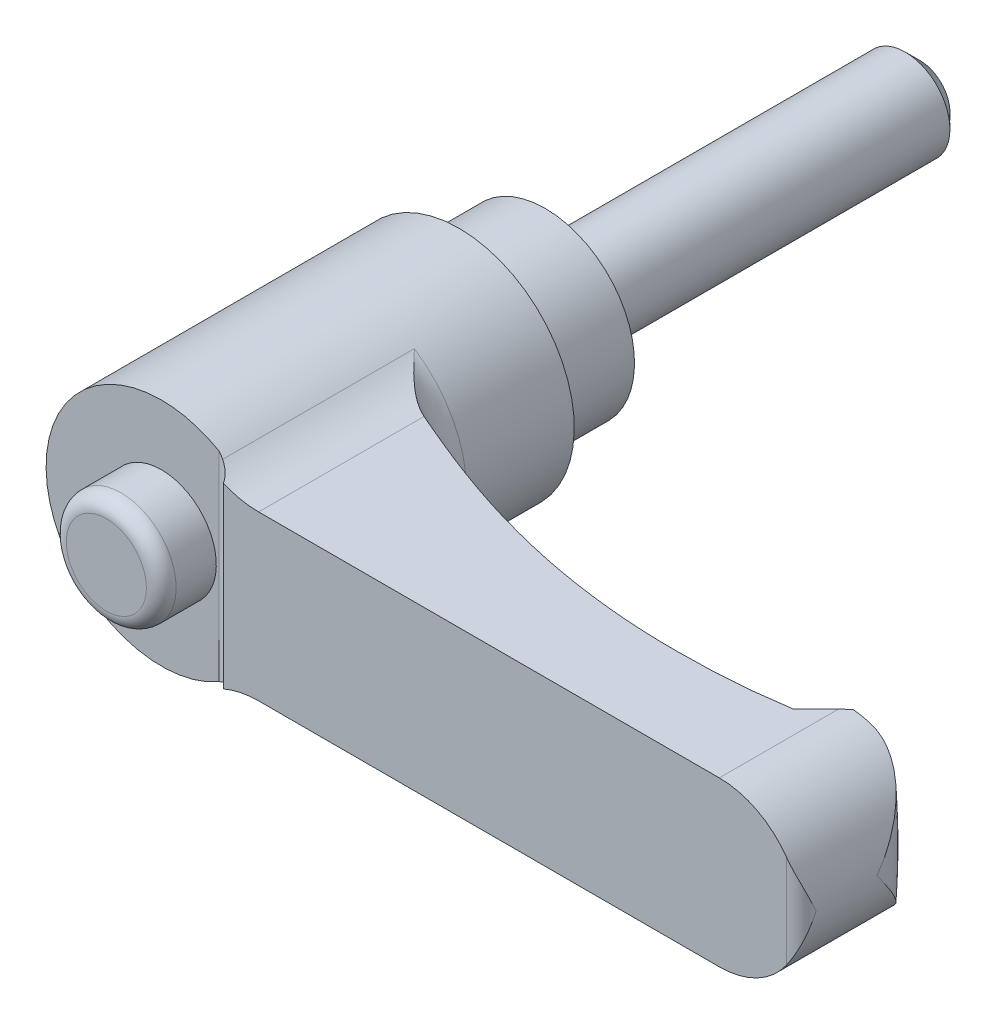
ISO-10303-21;
HEADER;
FILE_DESCRIPTION(('STEP AP214'),'2;1');
FILE_NAME('part.step','',(''),(''),'','','');
FILE_SCHEMA(('AUTOMOTIVE_DESIGN { 1 0 10303 214 1 1 1 1 }'));
ENDSEC;
DATA;
#1=APPLICATION_CONTEXT('core data for automotive mechanical design processes');
#2=APPLICATION_PROTOCOL_DEFINITION('international standard','automotive_design',2000,#1);
#3=PRODUCT_CONTEXT('',#1,'mechanical');
#4=PRODUCT('Part','Part','',(#3));
#5=PRODUCT_RELATED_PRODUCT_CATEGORY('part','',(#4));
#6=PRODUCT_DEFINITION_FORMATION('','',#4);
#7=PRODUCT_DEFINITION_CONTEXT('part definition',#1,'design');
#8=PRODUCT_DEFINITION('design','',#6,#7);
#9=PRODUCT_DEFINITION_SHAPE('','',#8);
#10=(LENGTH_UNIT() NAMED_UNIT(*) SI_UNIT(.MILLI.,.METRE.));
#11=(NAMED_UNIT(*) PLANE_ANGLE_UNIT() SI_UNIT($,.RADIAN.));
#12=(NAMED_UNIT(*) SI_UNIT($,.STERADIAN.) SOLID_ANGLE_UNIT());
#13=UNCERTAINTY_MEASURE_WITH_UNIT(LENGTH_MEASURE(1.E-05),#10,'distance_accuracy_value','');
#14=(GEOMETRIC_REPRESENTATION_CONTEXT(3) GLOBAL_UNCERTAINTY_ASSIGNED_CONTEXT((#13)) GLOBAL_UNIT_ASSIGNED_CONTEXT((#10,
#11,#12)) REPRESENTATION_CONTEXT('',''));
#15=CARTESIAN_POINT('',(0.,0.,0.));
#16=DIRECTION('',(0.,0.,1.));
#17=DIRECTION('',(1.,0.,0.));
#18=AXIS2_PLACEMENT_3D('',#15,#16,#17);
#19=CARTESIAN_POINT('',(4.8,0.,0.));
#20=DIRECTION('',(0.,0.,1.));
#21=DIRECTION('',(0.,-1.,0.));
#22=AXIS2_PLACEMENT_3D('',#19,#20,#21);
#23=PLANE('',#22);
#24=CARTESIAN_POINT('',(0.,0.,0.));
#25=DIRECTION('',(0.,0.,-1.));
#26=DIRECTION('',(0.,1.,0.));
#27=AXIS2_PLACEMENT_3D('',#24,#25,#26);
#28=CIRCLE('',#27,3.);
#29=CARTESIAN_POINT('',(0.,3.,0.));
#30=VERTEX_POINT('',#29);
#31=EDGE_CURVE('E469',#30,#30,#28,.T.);
#32=ORIENTED_EDGE('',*,*,#31,.F.);
#33=EDGE_LOOP('',(#32));
#34=FACE_BOUND('',#33,.T.);
#35=CARTESIAN_POINT('',(0.,0.,0.));
#36=DIRECTION('',(0.,0.,-1.));
#37=DIRECTION('',(0.,1.,0.));
#38=AXIS2_PLACEMENT_3D('',#35,#36,#37);
#39=CIRCLE('',#38,4.8);
#40=CARTESIAN_POINT('',(0.,4.8,0.));
#41=VERTEX_POINT('',#40);
#42=EDGE_CURVE('E417',#41,#41,#39,.T.);
#43=ORIENTED_EDGE('',*,*,#42,.T.);
#44=EDGE_LOOP('',(#43));
#45=FACE_BOUND('',#44,.T.);
#46=ADVANCED_FACE('F14',(#34,#45),#23,.F.);
#47=CARTESIAN_POINT('',(0.,0.,26.));
#48=DIRECTION('',(0.,0.,-1.));
#49=DIRECTION('',(0.,1.,0.));
#50=AXIS2_PLACEMENT_3D('',#47,#48,#49);
#51=PLANE('',#50);
#52=CARTESIAN_POINT('',(0.,0.,26.));
#53=DIRECTION('',(0.,0.,-1.));
#54=DIRECTION('',(0.,1.,0.));
#55=AXIS2_PLACEMENT_3D('',#52,#53,#54);
#56=CIRCLE('',#55,7.75);
#57=CARTESIAN_POINT('',(3.875,-6.7116968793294,26.));
#58=VERTEX_POINT('',#57);
#59=CARTESIAN_POINT('',(3.875,6.7116968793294,26.));
#60=VERTEX_POINT('',#59);
#61=EDGE_CURVE('E364',#58,#60,#56,.T.);
#62=ORIENTED_EDGE('',*,*,#61,.F.);
#63=DIRECTION('',(0.,1.,0.));
#64=VECTOR('',#63,1.);
#65=CARTESIAN_POINT('',(3.875,-11.,26.));
#66=LINE('',#65,#64);
#67=EDGE_CURVE('E451',#58,#60,#66,.T.);
#68=ORIENTED_EDGE('',*,*,#67,.T.);
#69=EDGE_LOOP('',(#62,#68));
#70=FACE_BOUND('',#69,.T.);
#71=CARTESIAN_POINT('',(0.,0.,26.));
#72=DIRECTION('',(0.,0.,-1.));
#73=DIRECTION('',(0.,1.,0.));
#74=AXIS2_PLACEMENT_3D('',#71,#72,#73);
#75=CIRCLE('',#74,3.69047619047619);
#76=CARTESIAN_POINT('',(0.,3.69047619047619,26.));
#77=VERTEX_POINT('',#76);
#78=EDGE_CURVE('E183',#77,#77,#75,.F.);
#79=ORIENTED_EDGE('',*,*,#78,.F.);
#80=EDGE_LOOP('',(#79));
#81=FACE_BOUND('',#80,.T.);
#82=ADVANCED_FACE('F158',(#70,#81),#51,.F.);
#83=CARTESIAN_POINT('',(38.5,0.,0.));
#84=DIRECTION('',(0.,0.,1.));
#85=DIRECTION('',(0.,-1.,0.));
#86=AXIS2_PLACEMENT_3D('',#83,#84,#85);
#87=CYLINDRICAL_SURFACE('',#86,5.5);
#88=CARTESIAN_POINT('',(44.,0.,21.9));
#89=CARTESIAN_POINT('',(44.0000000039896,-0.00425779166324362,21.8968685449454));
#90=CARTESIAN_POINT('',(43.9999950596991,-0.00851571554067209,21.8937369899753));
#91=CARTESIAN_POINT('',(43.9991083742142,-0.390143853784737,21.6130627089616));
#92=CARTESIAN_POINT('',(43.9593602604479,-0.76848056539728,21.3348044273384));
#93=CARTESIAN_POINT('',(43.8405607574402,-1.32856821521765,20.92503354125));
#94=CARTESIAN_POINT('',(43.7909532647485,-1.51435974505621,20.7894725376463));
#95=CARTESIAN_POINT('',(43.6715029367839,-1.88225773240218,20.5222473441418));
#96=CARTESIAN_POINT('',(43.601669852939,-2.06436592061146,20.3905813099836));
#97=CARTESIAN_POINT('',(43.4611872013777,-2.37875122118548,20.1648816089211));
#98=CARTESIAN_POINT('',(43.3950453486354,-2.51217438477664,20.0696210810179));
#99=CARTESIAN_POINT('',(43.250799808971,-2.77532702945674,19.8831417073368));
#100=CARTESIAN_POINT('',(43.1726935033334,-2.90505569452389,19.7919237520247));
#101=CARTESIAN_POINT('',(42.9202953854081,-3.28692053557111,19.5261795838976));
#102=CARTESIAN_POINT('',(42.727561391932,-3.53256609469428,19.3589622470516));
#103=CARTESIAN_POINT('',(42.3484683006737,-3.93634172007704,19.0952853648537));
#104=CARTESIAN_POINT('',(42.1735223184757,-4.10060224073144,18.9917399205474));
#105=CARTESIAN_POINT('',(41.7960798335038,-4.40966486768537,18.8081296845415));
#106=CARTESIAN_POINT('',(41.5936163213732,-4.55448986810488,18.7280371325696));
#107=CARTESIAN_POINT('',(41.2098130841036,-4.79019974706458,18.6136936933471));
#108=CARTESIAN_POINT('',(41.0333744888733,-4.88597642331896,18.5732748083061));
#109=CARTESIAN_POINT('',(40.7593164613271,-5.01555037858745,18.5310688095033));
#110=CARTESIAN_POINT('',(40.666374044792,-5.05640116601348,18.5200701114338));
#111=CARTESIAN_POINT('',(40.4779067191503,-5.13305107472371,18.5048417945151));
#112=CARTESIAN_POINT('',(40.3823830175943,-5.16885251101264,18.5006090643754));
#113=CARTESIAN_POINT('',(40.1884747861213,-5.23542428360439,18.4995076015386));
#114=CARTESIAN_POINT('',(40.090071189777,-5.26614066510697,18.5027130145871));
#115=CARTESIAN_POINT('',(39.8922874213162,-5.32184956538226,18.5171885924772));
#116=CARTESIAN_POINT('',(39.7929078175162,-5.34684523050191,18.528454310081));
#117=CARTESIAN_POINT('',(39.5942462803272,-5.39100815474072,18.5594647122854));
#118=CARTESIAN_POINT('',(39.4949643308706,-5.41017990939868,18.5792028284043));
#119=CARTESIAN_POINT('',(39.2976352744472,-5.44277299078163,18.6274002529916));
#120=CARTESIAN_POINT('',(39.1995875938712,-5.45619709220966,18.6558553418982));
#121=CARTESIAN_POINT('',(38.9984921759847,-5.47836544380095,18.7240647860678));
#122=CARTESIAN_POINT('',(38.8956289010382,-5.48667774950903,18.7645122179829));
#123=CARTESIAN_POINT('',(38.7445568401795,-5.49479244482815,18.8326405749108));
#124=CARTESIAN_POINT('',(38.6947409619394,-5.49677173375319,18.8565904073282));
#125=CARTESIAN_POINT('',(38.5963240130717,-5.49937673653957,18.9069325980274));
#126=CARTESIAN_POINT('',(38.5477229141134,-5.50000248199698,18.9333248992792));
#127=CARTESIAN_POINT('',(38.4998,-5.49999999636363,18.9609171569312));
#128=B_SPLINE_CURVE_WITH_KNOTS('',3,(#88,#89,#90,#91,#92,#93,#94,#95,#96,#97,#98,#99,#100,#101,
#102,#103,#104,#105,#106,#107,#108,#109,#110,#111,#112,#113,#114,#115,#116,#117,#118,#119,#120,
#121,#122,#123,#124,#125,#126,#127),.UNSPECIFIED.,.F.,.F.,(4,2,2,2,2,2,2,2,2,2,2,2,2,2,2,2,2,2,
2,4),(0.,0.0158565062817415,1.4211419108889,2.12636053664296,2.83123971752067,3.36110592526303,
3.89108827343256,4.94782257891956,5.7293360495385,6.50992069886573,7.12169061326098,
7.42772009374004,7.73360880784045,8.04255979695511,8.35134045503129,8.65988215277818,
8.96827473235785,9.30004722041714,9.46590364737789,9.63175620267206),.UNSPECIFIED.);
#129=CARTESIAN_POINT('',(40.2644155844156,-5.20930299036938,18.5));
#130=VERTEX_POINT('',#129);
#131=CARTESIAN_POINT('',(44.,0.,21.9));
#132=VERTEX_POINT('',#131);
#133=EDGE_CURVE('E126',#130,#132,#128,.F.);
#134=ORIENTED_EDGE('',*,*,#133,.T.);
#135=CARTESIAN_POINT('',(44.,0.,21.9));
#136=CARTESIAN_POINT('',(44.0000000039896,0.00425779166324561,21.8968685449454));
#137=CARTESIAN_POINT('',(43.9999950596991,0.00851571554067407,21.8937369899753));
#138=CARTESIAN_POINT('',(43.9991083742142,0.390143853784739,21.6130627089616));
#139=CARTESIAN_POINT('',(43.9593602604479,0.768480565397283,21.3348044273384));
#140=CARTESIAN_POINT('',(43.8405607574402,1.32856821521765,20.92503354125));
#141=CARTESIAN_POINT('',(43.7909532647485,1.51435974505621,20.7894725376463));
#142=CARTESIAN_POINT('',(43.6715029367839,1.88225773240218,20.5222473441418));
#143=CARTESIAN_POINT('',(43.601669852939,2.06436592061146,20.3905813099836));
#144=CARTESIAN_POINT('',(43.4611872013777,2.37875122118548,20.1648816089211));
#145=CARTESIAN_POINT('',(43.3950453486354,2.51217438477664,20.0696210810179));
#146=CARTESIAN_POINT('',(43.250799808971,2.77532702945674,19.8831417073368));
#147=CARTESIAN_POINT('',(43.1726935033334,2.9050556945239,19.7919237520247));
#148=CARTESIAN_POINT('',(42.9202953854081,3.28692053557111,19.5261795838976));
#149=CARTESIAN_POINT('',(42.727561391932,3.53256609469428,19.3589622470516));
#150=CARTESIAN_POINT('',(42.3484683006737,3.93634172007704,19.0952853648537));
#151=CARTESIAN_POINT('',(42.1735223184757,4.10060224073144,18.9917399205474));
#152=CARTESIAN_POINT('',(41.7960798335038,4.40966486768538,18.8081296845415));
#153=CARTESIAN_POINT('',(41.5936163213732,4.55448986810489,18.7280371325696));
#154=CARTESIAN_POINT('',(41.2098130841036,4.79019974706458,18.6136936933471));
#155=CARTESIAN_POINT('',(41.0333744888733,4.88597642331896,18.5732748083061));
#156=CARTESIAN_POINT('',(40.7593164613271,5.01555037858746,18.5310688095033));
#157=CARTESIAN_POINT('',(40.666374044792,5.05640116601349,18.5200701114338));
#158=CARTESIAN_POINT('',(40.4779067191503,5.13305107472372,18.5048417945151));
#159=CARTESIAN_POINT('',(40.3823830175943,5.16885251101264,18.5006090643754));
#160=CARTESIAN_POINT('',(40.1884747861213,5.23542428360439,18.4995076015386));
#161=CARTESIAN_POINT('',(40.090071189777,5.26614066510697,18.5027130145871));
#162=CARTESIAN_POINT('',(39.8922874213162,5.32184956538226,18.5171885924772));
#163=CARTESIAN_POINT('',(39.7929078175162,5.34684523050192,18.528454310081));
#164=CARTESIAN_POINT('',(39.5942462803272,5.39100815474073,18.5594647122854));
#165=CARTESIAN_POINT('',(39.4949643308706,5.41017990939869,18.5792028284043));
#166=CARTESIAN_POINT('',(39.2976352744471,5.44277299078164,18.6274002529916));
#167=CARTESIAN_POINT('',(39.1995875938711,5.45619709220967,18.6558553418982));
#168=CARTESIAN_POINT('',(38.9984921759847,5.47836544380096,18.7240647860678));
#169=CARTESIAN_POINT('',(38.8956289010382,5.48667774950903,18.7645122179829));
#170=CARTESIAN_POINT('',(38.7445568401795,5.49479244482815,18.8326405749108));
#171=CARTESIAN_POINT('',(38.6947409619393,5.4967717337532,18.8565904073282));
#172=CARTESIAN_POINT('',(38.5963240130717,5.49937673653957,18.9069325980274));
#173=CARTESIAN_POINT('',(38.5477229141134,5.50000248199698,18.9333248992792));
#174=CARTESIAN_POINT('',(38.4998,5.49999999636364,18.9609171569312));
#175=B_SPLINE_CURVE_WITH_KNOTS('',3,(#135,#136,#137,#138,#139,#140,#141,#142,#143,#144,#145,
#146,#147,#148,#149,#150,#151,#152,#153,#154,#155,#156,#157,#158,#159,#160,#161,#162,#163,#164,
#165,#166,#167,#168,#169,#170,#171,#172,#173,#174),.UNSPECIFIED.,.F.,.F.,(4,2,2,2,2,2,2,2,2,2,2,
2,2,2,2,2,2,2,2,4),(0.,0.0158565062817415,1.4211419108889,2.12636053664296,2.83123971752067,
3.36110592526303,3.89108827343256,4.94782257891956,5.72933604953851,6.50992069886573,
7.12169061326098,7.42772009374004,7.73360880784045,8.04255979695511,8.35134045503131,
8.6598821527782,8.9682747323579,9.30004722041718,9.46590364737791,9.63175620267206),.UNSPECIFIED.);
#176=CARTESIAN_POINT('',(40.2644155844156,5.20930299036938,18.5));
#177=VERTEX_POINT('',#176);
#178=EDGE_CURVE('E123',#132,#177,#175,.T.);
#179=ORIENTED_EDGE('',*,*,#178,.T.);
#180=CARTESIAN_POINT('',(38.5,0.,18.5));
#181=DIRECTION('',(0.,0.,-1.));
#182=DIRECTION('',(0.,1.,0.));
#183=AXIS2_PLACEMENT_3D('',#180,#181,#182);
#184=CIRCLE('',#183,5.5);
#185=CARTESIAN_POINT('',(39.,5.47722557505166,18.5));
#186=VERTEX_POINT('',#185);
#187=EDGE_CURVE('E457',#177,#186,#184,.F.);
#188=ORIENTED_EDGE('',*,*,#187,.T.);
#189=CARTESIAN_POINT('',(38.5,0.,19.));
#190=DIRECTION('',(-0.707106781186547,0.,-0.707106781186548));
#191=DIRECTION('',(-0.707106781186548,0.,0.707106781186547));
#192=AXIS2_PLACEMENT_3D('',#189,#190,#191);
#193=ELLIPSE('',#192,7.77817459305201,5.5);
#194=CARTESIAN_POINT('',(38.5,5.5,19.));
#195=VERTEX_POINT('',#194);
#196=EDGE_CURVE('E390',#186,#195,#193,.F.);
#197=ORIENTED_EDGE('',*,*,#196,.T.);
#198=DIRECTION('',(0.,0.,1.));
#199=VECTOR('',#198,1.);
#200=CARTESIAN_POINT('',(38.5,5.5,0.));
#201=LINE('',#200,#199);
#202=CARTESIAN_POINT('',(38.5,5.5,27.));
#203=VERTEX_POINT('',#202);
#204=EDGE_CURVE('E389',#195,#203,#201,.T.);
#205=ORIENTED_EDGE('',*,*,#204,.T.);
#206=CARTESIAN_POINT('',(38.5,0.,27.));
#207=DIRECTION('',(0.,0.,1.));
#208=DIRECTION('',(0.,-1.,0.));
#209=AXIS2_PLACEMENT_3D('',#206,#207,#208);
#210=CIRCLE('',#209,5.5);
#211=CARTESIAN_POINT('',(43.,3.16227766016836,27.));
#212=VERTEX_POINT('',#211);
#213=EDGE_CURVE('E367',#212,#203,#210,.T.);
#214=ORIENTED_EDGE('',*,*,#213,.F.);
#215=CARTESIAN_POINT('',(43.,3.16227766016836,27.));
#216=CARTESIAN_POINT('',(43.0489698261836,3.09261080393,26.9999556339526));
#217=CARTESIAN_POINT('',(43.0962528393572,3.0218687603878,26.9964077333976));
#218=CARTESIAN_POINT('',(43.1871872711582,2.87878712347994,26.9834058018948));
#219=CARTESIAN_POINT('',(43.2308453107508,2.80645076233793,26.9739628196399));
#220=CARTESIAN_POINT('',(43.3141980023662,2.66092047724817,26.9503365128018));
#221=CARTESIAN_POINT('',(43.3539154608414,2.58773460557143,26.9361828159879));
#222=CARTESIAN_POINT('',(43.4296865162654,2.44030003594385,26.903917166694));
#223=CARTESIAN_POINT('',(43.4657377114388,2.36605067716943,26.8858026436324));
#224=CARTESIAN_POINT('',(43.5573559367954,2.16613298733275,26.8329178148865));
#225=CARTESIAN_POINT('',(43.6095944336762,2.03971389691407,26.7951786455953));
#226=CARTESIAN_POINT('',(43.703955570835,1.78529411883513,26.7129945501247));
#227=CARTESIAN_POINT('',(43.7460735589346,1.65729273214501,26.6685465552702));
#228=CARTESIAN_POINT('',(43.8205857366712,1.39978291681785,26.5746664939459));
#229=CARTESIAN_POINT('',(43.852946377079,1.27027084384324,26.5252179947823));
#230=CARTESIAN_POINT('',(43.9079882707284,1.01058108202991,26.4229956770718));
#231=CARTESIAN_POINT('',(43.9306732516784,0.880403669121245,26.3702231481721));
#232=CARTESIAN_POINT('',(43.9654953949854,0.627432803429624,26.2658240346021));
#233=CARTESIAN_POINT('',(43.9781829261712,0.504664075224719,26.2143181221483));
#234=CARTESIAN_POINT('',(43.9952673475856,0.259135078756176,26.1104803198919));
#235=CARTESIAN_POINT('',(43.9996786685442,0.136375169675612,26.0581500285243));
#236=CARTESIAN_POINT('',(43.9999943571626,0.00909584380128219,26.0038784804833));
#237=CARTESIAN_POINT('',(43.9999999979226,0.00454789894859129,26.0019392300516));
#238=CARTESIAN_POINT('',(44.,0.,26.));
#239=B_SPLINE_CURVE_WITH_KNOTS('',3,(#215,#216,#217,#218,#219,#220,#221,#222,#223,#224,#225,
#226,#227,#228,#229,#230,#231,#232,#233,#234,#235,#236,#237,#238),.UNSPECIFIED.,.F.,.F.,(4,2,2,
2,2,2,2,2,2,2,2,4),(0.,0.255244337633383,0.510011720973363,0.763206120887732,1.01656533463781,
1.44159949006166,1.8668286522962,2.2935036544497,2.72001412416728,3.12097942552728,
3.52124493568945,3.53607734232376),.UNSPECIFIED.);
#240=CARTESIAN_POINT('',(44.,0.,26.));
#241=VERTEX_POINT('',#240);
#242=EDGE_CURVE('E169',#241,#212,#239,.F.);
#243=ORIENTED_EDGE('',*,*,#242,.F.);
#244=CARTESIAN_POINT('',(43.,-3.16227766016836,27.));
#245=CARTESIAN_POINT('',(43.0489698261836,-3.09261080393,26.9999556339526));
#246=CARTESIAN_POINT('',(43.0962528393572,-3.0218687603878,26.9964077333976));
#247=CARTESIAN_POINT('',(43.1871872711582,-2.87878712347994,26.9834058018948));
#248=CARTESIAN_POINT('',(43.2308453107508,-2.80645076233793,26.9739628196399));
#249=CARTESIAN_POINT('',(43.3141980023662,-2.66092047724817,26.9503365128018));
#250=CARTESIAN_POINT('',(43.3539154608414,-2.58773460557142,26.9361828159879));
#251=CARTESIAN_POINT('',(43.4296865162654,-2.44030003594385,26.903917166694));
#252=CARTESIAN_POINT('',(43.4657377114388,-2.36605067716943,26.8858026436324));
#253=CARTESIAN_POINT('',(43.5573559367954,-2.16613298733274,26.8329178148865));
#254=CARTESIAN_POINT('',(43.6095944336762,-2.03971389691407,26.7951786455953));
#255=CARTESIAN_POINT('',(43.703955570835,-1.78529411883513,26.7129945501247));
#256=CARTESIAN_POINT('',(43.7460735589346,-1.65729273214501,26.6685465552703));
#257=CARTESIAN_POINT('',(43.8205857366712,-1.39978291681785,26.5746664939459));
#258=CARTESIAN_POINT('',(43.852946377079,-1.27027084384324,26.5252179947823));
#259=CARTESIAN_POINT('',(43.9079882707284,-1.01058108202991,26.4229956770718));
#260=CARTESIAN_POINT('',(43.9306732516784,-0.880403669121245,26.3702231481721));
#261=CARTESIAN_POINT('',(43.9654953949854,-0.627432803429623,26.2658240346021));
#262=CARTESIAN_POINT('',(43.9781829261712,-0.504664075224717,26.2143181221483));
#263=CARTESIAN_POINT('',(43.9952673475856,-0.259135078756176,26.1104803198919));
#264=CARTESIAN_POINT('',(43.9996786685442,-0.136375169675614,26.0581500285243));
#265=CARTESIAN_POINT('',(43.9999943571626,-0.00909584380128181,26.0038784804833));
#266=CARTESIAN_POINT('',(43.9999999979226,-0.00454789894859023,26.0019392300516));
#267=CARTESIAN_POINT('',(44.,0.,26.));
#268=B_SPLINE_CURVE_WITH_KNOTS('',3,(#244,#245,#246,#247,#248,#249,#250,#251,#252,#253,#254,
#255,#256,#257,#258,#259,#260,#261,#262,#263,#264,#265,#266,#267),.UNSPECIFIED.,.F.,.F.,(4,2,2,
2,2,2,2,2,2,2,2,4),(0.,0.255244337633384,0.510011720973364,0.763206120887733,1.01656533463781,
1.44159949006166,1.8668286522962,2.2935036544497,2.72001412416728,3.12097942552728,
3.52124493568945,3.53607734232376),.UNSPECIFIED.);
#269=CARTESIAN_POINT('',(43.,-3.16227766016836,27.));
#270=VERTEX_POINT('',#269);
#271=EDGE_CURVE('E177',#270,#241,#268,.T.);
#272=ORIENTED_EDGE('',*,*,#271,.F.);
#273=CARTESIAN_POINT('',(38.5,-5.5,27.));
#274=VERTEX_POINT('',#273);
#275=EDGE_CURVE('E373',#274,#270,#210,.T.);
#276=ORIENTED_EDGE('',*,*,#275,.F.);
#277=DIRECTION('',(0.,0.,1.));
#278=VECTOR('',#277,1.);
#279=CARTESIAN_POINT('',(38.5,-5.5,0.));
#280=LINE('',#279,#278);
#281=CARTESIAN_POINT('',(38.5,-5.5,19.));
#282=VERTEX_POINT('',#281);
#283=EDGE_CURVE('E393',#282,#274,#280,.T.);
#284=ORIENTED_EDGE('',*,*,#283,.F.);
#285=CARTESIAN_POINT('',(39.,-5.47722557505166,18.5));
#286=VERTEX_POINT('',#285);
#287=EDGE_CURVE('E440',#282,#286,#193,.F.);
#288=ORIENTED_EDGE('',*,*,#287,.T.);
#289=EDGE_CURVE('E134',#286,#130,#184,.F.);
#290=ORIENTED_EDGE('',*,*,#289,.T.);
#291=EDGE_LOOP('',(#134,#179,#188,#197,#205,#214,#243,#272,#276,#284,#288,#290));
#292=FACE_BOUND('',#291,.T.);
#293=ADVANCED_FACE('F132',(#292),#87,.T.);
#294=CARTESIAN_POINT('',(40.6,-11.,18.5));
#295=DIRECTION('',(0.,0.,-1.));
#296=DIRECTION('',(0.,1.,0.));
#297=AXIS2_PLACEMENT_3D('',#294,#295,#296);
#298=PLANE('',#297);
#299=ORIENTED_EDGE('',*,*,#187,.F.);
#300=CARTESIAN_POINT('',(0.,0.,18.5));
#301=DIRECTION('',(0.,0.,-1.));
#302=DIRECTION('',(0.,1.,0.));
#303=AXIS2_PLACEMENT_3D('',#300,#301,#302);
#304=CIRCLE('',#303,40.6);
#305=EDGE_CURVE('E37',#177,#130,#304,.T.);
#306=ORIENTED_EDGE('',*,*,#305,.T.);
#307=ORIENTED_EDGE('',*,*,#289,.F.);
#308=DIRECTION('',(0.,1.,0.));
#309=VECTOR('',#308,1.);
#310=CARTESIAN_POINT('',(39.,-11.,18.5));
#311=LINE('',#310,#309);
#312=EDGE_CURVE('E448',#286,#186,#311,.T.);
#313=ORIENTED_EDGE('',*,*,#312,.T.);
#314=EDGE_LOOP('',(#299,#306,#307,#313));
#315=FACE_BOUND('',#314,.T.);
#316=ADVANCED_FACE('F157',(#315),#298,.T.);
#317=CARTESIAN_POINT('',(0.,0.,27.));
#318=DIRECTION('',(0.,0.,1.));
#319=DIRECTION('',(0.,-1.,0.));
#320=AXIS2_PLACEMENT_3D('',#317,#318,#319);
#321=PLANE('',#320);
#322=CARTESIAN_POINT('',(7.53740671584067,11.5,27.));
#323=DIRECTION('',(0.,0.,1.));
#324=DIRECTION('',(1.,0.,0.));
#325=AXIS2_PLACEMENT_3D('',#322,#323,#324);
#326=CIRCLE('',#325,6.);
#327=CARTESIAN_POINT('',(5.16666666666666,5.988231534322,27.));
#328=VERTEX_POINT('',#327);
#329=CARTESIAN_POINT('',(7.53740671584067,5.5,27.));
#330=VERTEX_POINT('',#329);
#331=EDGE_CURVE('E398',#328,#330,#326,.T.);
#332=ORIENTED_EDGE('',*,*,#331,.F.);
#333=DIRECTION('',(0.,1.,0.));
#334=VECTOR('',#333,1.);
#335=CARTESIAN_POINT('',(5.16666666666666,-11.,27.));
#336=LINE('',#335,#334);
#337=CARTESIAN_POINT('',(5.16666666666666,-5.988231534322,27.));
#338=VERTEX_POINT('',#337);
#339=EDGE_CURVE('E436',#338,#328,#336,.T.);
#340=ORIENTED_EDGE('',*,*,#339,.F.);
#341=CARTESIAN_POINT('',(7.53740671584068,-11.5,27.));
#342=DIRECTION('',(0.,0.,1.));
#343=DIRECTION('',(1.,0.,0.));
#344=AXIS2_PLACEMENT_3D('',#341,#342,#343);
#345=CIRCLE('',#344,6.);
#346=CARTESIAN_POINT('',(7.53740671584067,-5.5,27.));
#347=VERTEX_POINT('',#346);
#348=EDGE_CURVE('E401',#347,#338,#345,.T.);
#349=ORIENTED_EDGE('',*,*,#348,.F.);
#350=DIRECTION('',(-1.,0.,0.));
#351=VECTOR('',#350,1.);
#352=CARTESIAN_POINT('',(38.5,-5.5,27.));
#353=LINE('',#352,#351);
#354=EDGE_CURVE('E397',#274,#347,#353,.T.);
#355=ORIENTED_EDGE('',*,*,#354,.F.);
#356=ORIENTED_EDGE('',*,*,#275,.T.);
#357=DIRECTION('',(0.,1.,0.));
#358=VECTOR('',#357,1.);
#359=CARTESIAN_POINT('',(43.,-11.,27.));
#360=LINE('',#359,#358);
#361=EDGE_CURVE('E385',#270,#212,#360,.T.);
#362=ORIENTED_EDGE('',*,*,#361,.T.);
#363=ORIENTED_EDGE('',*,*,#213,.T.);
#364=DIRECTION('',(1.,0.,0.));
#365=VECTOR('',#364,1.);
#366=CARTESIAN_POINT('',(7.53740671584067,5.5,27.));
#367=LINE('',#366,#365);
#368=EDGE_CURVE('E384',#330,#203,#367,.T.);
#369=ORIENTED_EDGE('',*,*,#368,.F.);
#370=EDGE_LOOP('',(#332,#340,#349,#355,#356,#362,#363,#369));
#371=FACE_BOUND('',#370,.T.);
#372=ADVANCED_FACE('F240',(#371),#321,.T.);
#373=CARTESIAN_POINT('',(0.,0.,0.));
#374=DIRECTION('',(0.,0.,-1.));
#375=DIRECTION('',(0.,1.,0.));
#376=AXIS2_PLACEMENT_3D('',#373,#374,#375);
#377=CYLINDRICAL_SURFACE('',#376,7.75);
#378=CARTESIAN_POINT('',(0.,0.,13.2417430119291));
#379=DIRECTION('',(0.,0.,-1.));
#380=DIRECTION('',(0.,1.,0.));
#381=AXIS2_PLACEMENT_3D('',#378,#379,#380);
#382=CIRCLE('',#381,7.75);
#383=CARTESIAN_POINT('',(4.24835651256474,6.48181818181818,13.2417430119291));
#384=VERTEX_POINT('',#383);
#385=CARTESIAN_POINT('',(4.24835651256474,-6.48181818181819,13.2417430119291));
#386=VERTEX_POINT('',#385);
#387=EDGE_CURVE('E359',#384,#386,#382,.T.);
#388=ORIENTED_EDGE('',*,*,#387,.T.);
#389=DIRECTION('',(0.,0.,1.));
#390=VECTOR('',#389,1.);
#391=CARTESIAN_POINT('',(4.24835651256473,-6.48181818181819,0.));
#392=LINE('',#391,#390);
#393=CARTESIAN_POINT('',(4.24835651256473,-6.48181818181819,26.1308937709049));
#394=VERTEX_POINT('',#393);
#395=EDGE_CURVE('E409',#386,#394,#392,.T.);
#396=ORIENTED_EDGE('',*,*,#395,.T.);
#397=CARTESIAN_POINT('',(3.875,-6.7116968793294,26.));
#398=CARTESIAN_POINT('',(3.9487248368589,-6.66914880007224,26.0179048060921));
#399=CARTESIAN_POINT('',(4.02097408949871,-6.62579988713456,26.039874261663));
#400=CARTESIAN_POINT('',(4.16199829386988,-6.53812669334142,26.0915573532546));
#401=CARTESIAN_POINT('',(4.23077434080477,-6.49380272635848,26.1212685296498));
#402=CARTESIAN_POINT('',(4.36202505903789,-6.40634475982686,26.1868862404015));
#403=CARTESIAN_POINT('',(4.42463632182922,-6.36322379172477,26.2225378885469));
#404=CARTESIAN_POINT('',(4.54579687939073,-6.27724013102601,26.3004737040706));
#405=CARTESIAN_POINT('',(4.60434578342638,-6.23437746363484,26.3427585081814));
#406=CARTESIAN_POINT('',(4.71026264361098,-6.1546555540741,26.4283893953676));
#407=CARTESIAN_POINT('',(4.75813291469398,-6.11768751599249,26.4710140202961));
#408=CARTESIAN_POINT('',(4.8500303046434,-6.04509175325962,26.56120031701));
#409=CARTESIAN_POINT('',(4.89405965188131,-6.00946325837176,26.6087590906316));
#410=CARTESIAN_POINT('',(4.97925799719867,-5.9390764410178,26.7103994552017));
#411=CARTESIAN_POINT('',(5.02029084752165,-5.90438218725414,26.7646407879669));
#412=CARTESIAN_POINT('',(5.09738332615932,-5.83796295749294,26.8783962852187));
#413=CARTESIAN_POINT('',(5.13343386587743,-5.80624344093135,26.9379197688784));
#414=CARTESIAN_POINT('',(5.16666666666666,-5.77650894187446,27.));
#415=B_SPLINE_CURVE_WITH_KNOTS('',3,(#397,#398,#399,#400,#401,#402,#403,#404,#405,#406,#407,
#408,#409,#410,#411,#412,#413,#414),.UNSPECIFIED.,.F.,.F.,(4,2,2,2,2,2,2,2,4),(0.,
0.26081186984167,0.521540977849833,0.773092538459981,1.02466826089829,1.24638864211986,
1.4679795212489,1.6966429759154,1.92571819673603),.UNSPECIFIED.);
#416=EDGE_CURVE('E214',#58,#394,#415,.T.);
#417=ORIENTED_EDGE('',*,*,#416,.F.);
#418=ORIENTED_EDGE('',*,*,#61,.T.);
#419=CARTESIAN_POINT('',(5.16666666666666,5.77650894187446,27.));
#420=CARTESIAN_POINT('',(5.13714077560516,5.80292379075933,26.9448365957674));
#421=CARTESIAN_POINT('',(5.1053831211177,5.83091583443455,26.8916890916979));
#422=CARTESIAN_POINT('',(5.03785941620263,5.88934998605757,26.7895453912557));
#423=CARTESIAN_POINT('',(5.00209830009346,5.91978906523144,26.7405442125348));
#424=CARTESIAN_POINT('',(4.92700880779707,5.98243056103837,26.646752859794));
#425=CARTESIAN_POINT('',(4.88768622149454,6.01463008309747,26.6019560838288));
#426=CARTESIAN_POINT('',(4.80573825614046,6.08030777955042,26.5165060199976));
#427=CARTESIAN_POINT('',(4.76311181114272,6.11378636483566,26.4758540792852));
#428=CARTESIAN_POINT('',(4.63114473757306,6.21507952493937,26.3605779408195));
#429=CARTESIAN_POINT('',(4.53728284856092,6.28411879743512,26.2920994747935));
#430=CARTESIAN_POINT('',(4.3393749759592,6.42237347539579,26.1724069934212));
#431=CARTESIAN_POINT('',(4.23533663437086,6.49158871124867,26.1211801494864));
#432=CARTESIAN_POINT('',(4.08621326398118,6.5854168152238,26.0632790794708));
#433=CARTESIAN_POINT('',(4.04469277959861,6.61100425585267,26.0487072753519));
#434=CARTESIAN_POINT('',(3.96061680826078,6.66171281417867,26.0222973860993));
#435=CARTESIAN_POINT('',(3.91806319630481,6.68683464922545,26.0104547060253));
#436=CARTESIAN_POINT('',(3.8750000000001,6.7116968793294,26.));
#437=B_SPLINE_CURVE_WITH_KNOTS('',3,(#419,#420,#421,#422,#423,#424,#425,#426,#427,#428,#429,
#430,#431,#432,#433,#434,#435,#436),.UNSPECIFIED.,.F.,.F.,(4,2,2,2,2,2,2,2,4),(0.,
0.203583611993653,0.406919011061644,0.609929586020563,0.81300593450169,1.21684507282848,
1.62038324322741,1.77301957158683,1.92539700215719),.UNSPECIFIED.);
#438=CARTESIAN_POINT('',(4.24835651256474,6.48181818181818,26.1308937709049));
#439=VERTEX_POINT('',#438);
#440=EDGE_CURVE('E228',#439,#60,#437,.T.);
#441=ORIENTED_EDGE('',*,*,#440,.F.);
#442=DIRECTION('',(0.,0.,1.));
#443=VECTOR('',#442,1.);
#444=CARTESIAN_POINT('',(4.24835651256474,6.48181818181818,0.));
#445=LINE('',#444,#443);
#446=EDGE_CURVE('E415',#384,#439,#445,.T.);
#447=ORIENTED_EDGE('',*,*,#446,.F.);
#448=EDGE_LOOP('',(#388,#396,#417,#418,#441,#447));
#449=FACE_BOUND('',#448,.T.);
#450=CARTESIAN_POINT('',(0.,0.,6.));
#451=DIRECTION('',(0.,0.,-1.));
#452=DIRECTION('',(0.,1.,0.));
#453=AXIS2_PLACEMENT_3D('',#450,#451,#452);
#454=CIRCLE('',#453,7.75);
#455=CARTESIAN_POINT('',(0.,7.75,6.));
#456=VERTEX_POINT('',#455);
#457=EDGE_CURVE('E362',#456,#456,#454,.T.);
#458=ORIENTED_EDGE('',*,*,#457,.F.);
#459=EDGE_LOOP('',(#458));
#460=FACE_BOUND('',#459,.T.);
#461=ADVANCED_FACE('F238',(#449,#460),#377,.T.);
#462=CARTESIAN_POINT('',(7.53740671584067,11.5,0.));
#463=DIRECTION('',(0.,0.,1.));
#464=DIRECTION('',(0.,-1.,0.));
#465=AXIS2_PLACEMENT_3D('',#462,#463,#464);
#466=CYLINDRICAL_SURFACE('',#465,6.);
#467=DIRECTION('',(0.,0.,1.));
#468=VECTOR('',#467,1.);
#469=CARTESIAN_POINT('',(7.53740671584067,5.5,0.));
#470=LINE('',#469,#468);
#471=CARTESIAN_POINT('',(7.53740671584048,5.5,15.8847846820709));
#472=VERTEX_POINT('',#471);
#473=EDGE_CURVE('E392',#472,#330,#470,.T.);
#474=ORIENTED_EDGE('',*,*,#473,.F.);
#475=CARTESIAN_POINT('',(7.53760671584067,5.50000000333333,15.8848714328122));
#476=CARTESIAN_POINT('',(7.42056429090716,5.50000237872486,15.8340928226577));
#477=CARTESIAN_POINT('',(7.30547455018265,5.50341530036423,15.7791506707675));
#478=CARTESIAN_POINT('',(7.07949807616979,5.51642945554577,15.6622782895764));
#479=CARTESIAN_POINT('',(6.96860436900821,5.52601989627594,15.6003604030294));
#480=CARTESIAN_POINT('',(6.64350339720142,5.56296716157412,15.4067136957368));
#481=CARTESIAN_POINT('',(6.43532620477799,5.59851698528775,15.2663869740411));
#482=CARTESIAN_POINT('',(6.04665859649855,5.68493972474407,14.9793319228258));
#483=CARTESIAN_POINT('',(5.86525717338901,5.73477067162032,14.8334864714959));
#484=CARTESIAN_POINT('',(5.51460300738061,5.84825422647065,14.5326629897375));
#485=CARTESIAN_POINT('',(5.34535978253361,5.91191750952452,14.3776779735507));
#486=CARTESIAN_POINT('',(5.01722866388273,6.05200819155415,14.0618166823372));
#487=CARTESIAN_POINT('',(4.85836829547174,6.12846774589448,13.9009263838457));
#488=CARTESIAN_POINT('',(4.55010273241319,6.29360411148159,13.5765860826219));
#489=CARTESIAN_POINT('',(4.40069155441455,6.3822730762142,13.4131377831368));
#490=CARTESIAN_POINT('',(4.25307835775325,6.47872574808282,13.2470592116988));
#491=CARTESIAN_POINT('',(4.25071688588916,6.48027113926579,13.2444011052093));
#492=CARTESIAN_POINT('',(4.24835651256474,6.48181818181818,13.2417430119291));
#493=B_SPLINE_CURVE_WITH_KNOTS('',3,(#475,#476,#477,#478,#479,#480,#481,#482,#483,#484,#485,
#486,#487,#488,#489,#490,#491,#492),.UNSPECIFIED.,.F.,.F.,(4,2,2,2,2,2,2,2,4),(0.,
0.382411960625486,0.764157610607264,1.52259154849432,2.23572847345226,2.9494177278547,
3.66492808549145,4.37998074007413,4.39161142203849),.UNSPECIFIED.);
#494=EDGE_CURVE('E244',#472,#384,#493,.T.);
#495=ORIENTED_EDGE('',*,*,#494,.T.);
#496=ORIENTED_EDGE('',*,*,#446,.T.);
#497=CARTESIAN_POINT('',(5.16666666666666,5.988231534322,27.));
#498=CARTESIAN_POINT('',(5.14070328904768,5.99939986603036,26.9514536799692));
#499=CARTESIAN_POINT('',(5.11281907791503,6.01160988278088,26.9041807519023));
#500=CARTESIAN_POINT('',(5.05359296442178,6.03815743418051,26.8125079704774));
#501=CARTESIAN_POINT('',(5.02225228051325,6.05249421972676,26.7681071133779));
#502=CARTESIAN_POINT('',(4.957388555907,6.08292031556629,26.6836551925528));
#503=CARTESIAN_POINT('',(4.92394991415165,6.09895014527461,26.6435177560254));
#504=CARTESIAN_POINT('',(4.85453383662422,6.13309313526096,26.5664566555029));
#505=CARTESIAN_POINT('',(4.81855640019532,6.151206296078,26.5295329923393));
#506=CARTESIAN_POINT('',(4.74141898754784,6.19109353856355,26.4561742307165));
#507=CARTESIAN_POINT('',(4.70007605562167,6.21304611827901,26.4200283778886));
#508=CARTESIAN_POINT('',(4.61540587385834,6.25936628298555,26.3518346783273));
#509=CARTESIAN_POINT('',(4.57207832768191,6.28373422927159,26.31978744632));
#510=CARTESIAN_POINT('',(4.48259160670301,6.33561673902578,26.2589246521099));
#511=CARTESIAN_POINT('',(4.43638627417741,6.36320560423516,26.2302406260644));
#512=CARTESIAN_POINT('',(4.34298641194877,6.4207567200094,26.1772795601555));
#513=CARTESIAN_POINT('',(4.29579253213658,6.45071744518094,26.152999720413));
#514=CARTESIAN_POINT('',(4.24835651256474,6.48181818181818,26.1308937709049));
#515=B_SPLINE_CURVE_WITH_KNOTS('',3,(#497,#498,#499,#500,#501,#502,#503,#504,#505,#506,#507,
#508,#509,#510,#511,#512,#513,#514),.UNSPECIFIED.,.F.,.F.,(4,2,2,2,2,2,2,2,4),(0.,
0.168459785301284,0.336860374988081,0.500600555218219,0.664340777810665,0.841530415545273,
1.0187465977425,1.20147538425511,1.38408759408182),.UNSPECIFIED.);
#516=EDGE_CURVE('E222',#328,#439,#515,.T.);
#517=ORIENTED_EDGE('',*,*,#516,.F.);
#518=ORIENTED_EDGE('',*,*,#331,.T.);
#519=EDGE_LOOP('',(#474,#495,#496,#517,#518));
#520=FACE_BOUND('',#519,.T.);
#521=ADVANCED_FACE('F234',(#520),#466,.F.);
#522=CARTESIAN_POINT('',(7.53740671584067,5.5,0.));
#523=DIRECTION('',(0.,-1.,0.));
#524=DIRECTION('',(1.,0.,0.));
#525=AXIS2_PLACEMENT_3D('',#522,#523,#524);
#526=PLANE('',#525);
#527=CARTESIAN_POINT('',(30.0268503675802,5.5,-22.9439315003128));
#528=DIRECTION('',(0.,-1.,0.));
#529=DIRECTION('',(1.,0.,0.));
#530=AXIS2_PLACEMENT_3D('',#527,#528,#529);
#531=CIRCLE('',#530,44.);
#532=CARTESIAN_POINT('',(29.7749924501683,5.5,21.0553476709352));
#533=VERTEX_POINT('',#532);
#534=CARTESIAN_POINT('',(37.,5.5,20.5));
#535=VERTEX_POINT('',#534);
#536=EDGE_CURVE('E438',#533,#535,#531,.F.);
#537=ORIENTED_EDGE('',*,*,#536,.F.);
#538=CARTESIAN_POINT('',(21.9436856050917,5.5,20.4285815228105));
#539=CARTESIAN_POINT('',(21.2029115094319,5.5,20.3059110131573));
#540=CARTESIAN_POINT('',(20.4649826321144,5.5,20.1656901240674));
#541=CARTESIAN_POINT('',(18.9963617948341,5.5,19.8513505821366));
#542=CARTESIAN_POINT('',(18.2656705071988,5.5,19.6772288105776));
#543=CARTESIAN_POINT('',(16.8128961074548,5.5,19.2967691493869));
#544=CARTESIAN_POINT('',(16.090811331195,5.5,19.0904376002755));
#545=CARTESIAN_POINT('',(14.6559685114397,5.5,18.6477967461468));
#546=CARTESIAN_POINT('',(13.9432097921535,5.5,18.4114896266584));
#547=CARTESIAN_POINT('',(12.8749404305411,5.5,18.0348625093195));
#548=CARTESIAN_POINT('',(12.5159102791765,5.5,17.9044045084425));
#549=CARTESIAN_POINT('',(11.8001944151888,5.5,17.6372082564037));
#550=CARTESIAN_POINT('',(11.4435086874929,5.5,17.5004700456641));
#551=CARTESIAN_POINT('',(10.732274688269,5.5,17.2214557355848));
#552=CARTESIAN_POINT('',(10.3777266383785,5.5,17.0791790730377));
#553=CARTESIAN_POINT('',(9.67049294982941,5.5,16.7900916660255));
#554=CARTESIAN_POINT('',(9.31780729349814,5.5,16.6432809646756));
#555=CARTESIAN_POINT('',(8.61374307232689,5.5,16.3464161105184));
#556=CARTESIAN_POINT('',(8.26236472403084,5.5,16.1963614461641));
#557=CARTESIAN_POINT('',(7.5602010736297,5.5,15.8948338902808));
#558=CARTESIAN_POINT('',(7.20941580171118,5.5,15.7433609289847));
#559=CARTESIAN_POINT('',(6.50744095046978,5.5,15.4415733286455));
#560=CARTESIAN_POINT('',(6.15625149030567,5.5,15.2912584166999));
#561=CARTESIAN_POINT('',(5.62793742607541,5.5,15.0694562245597));
#562=CARTESIAN_POINT('',(5.45158532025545,5.5,14.9961369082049));
#563=CARTESIAN_POINT('',(5.09811730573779,5.5,14.8513669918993));
#564=CARTESIAN_POINT('',(4.92100141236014,5.5,14.7799163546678));
#565=CARTESIAN_POINT('',(4.5605943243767,5.5,14.6376146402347));
#566=CARTESIAN_POINT('',(4.37727258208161,5.5,14.5668405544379));
#567=CARTESIAN_POINT('',(4.00919151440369,5.5,14.4290929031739));
#568=CARTESIAN_POINT('',(3.82443214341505,5.5,14.3621194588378));
#569=CARTESIAN_POINT('',(3.45309773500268,5.5,14.2332037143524));
#570=CARTESIAN_POINT('',(3.26652222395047,5.5,14.1712627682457));
#571=CARTESIAN_POINT('',(2.89130395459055,5.5,14.0539247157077));
#572=CARTESIAN_POINT('',(2.70266119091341,5.5,13.9985276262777));
#573=CARTESIAN_POINT('',(2.32827959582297,5.5,13.897398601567));
#574=CARTESIAN_POINT('',(2.14260137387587,5.5,13.851444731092));
#575=CARTESIAN_POINT('',(1.76914487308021,5.5,13.769095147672));
#576=CARTESIAN_POINT('',(1.58136699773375,5.5,13.732697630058));
#577=CARTESIAN_POINT('',(1.20421453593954,5.5,13.6711783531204));
#578=CARTESIAN_POINT('',(1.01484256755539,5.5,13.6460408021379));
#579=CARTESIAN_POINT('',(0.634839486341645,5.5,13.6083407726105));
#580=CARTESIAN_POINT('',(0.444208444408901,5.5,13.5957775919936));
#581=CARTESIAN_POINT('',(0.0582481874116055,5.5,13.5838589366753));
#582=CARTESIAN_POINT('',(-0.137090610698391,5.5,13.5848056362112));
#583=CARTESIAN_POINT('',(-0.527202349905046,5.5,13.600583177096));
#584=CARTESIAN_POINT('',(-0.721975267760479,5.5,13.6154145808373));
#585=CARTESIAN_POINT('',(-1.11032173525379,5.5,13.6580559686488));
#586=CARTESIAN_POINT('',(-1.30389342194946,5.5,13.6858826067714));
#587=CARTESIAN_POINT('',(-1.68902621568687,5.5,13.7529686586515));
#588=CARTESIAN_POINT('',(-1.88058717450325,5.5,13.792228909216));
#589=CARTESIAN_POINT('',(-2.26665403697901,5.5,13.8815548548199));
#590=CARTESIAN_POINT('',(-2.46109765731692,5.5,13.9318861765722));
#591=CARTESIAN_POINT('',(-2.84766117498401,5.5,14.0407100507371));
#592=CARTESIAN_POINT('',(-3.03978104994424,5.5,14.0992026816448));
#593=CARTESIAN_POINT('',(-3.42198028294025,5.5,14.2225795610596));
#594=CARTESIAN_POINT('',(-3.61205922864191,5.5,14.2874650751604));
#595=CARTESIAN_POINT('',(-3.99046224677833,5.5,14.4221031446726));
#596=CARTESIAN_POINT('',(-4.17878640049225,5.5,14.4918554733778));
#597=CARTESIAN_POINT('',(-4.676521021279,5.5,14.6816530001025));
#598=CARTESIAN_POINT('',(-4.98473853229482,5.5,14.8048097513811));
#599=CARTESIAN_POINT('',(-5.5989323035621,5.5,15.0566129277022));
#600=CARTESIAN_POINT('',(-5.9049082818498,5.5,15.1852600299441));
#601=CARTESIAN_POINT('',(-6.51590552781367,5.5,15.4450696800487));
#602=CARTESIAN_POINT('',(-6.82092644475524,5.5,15.5762330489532));
#603=CARTESIAN_POINT('',(-7.4308151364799,5.5,15.8388677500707));
#604=CARTESIAN_POINT('',(-7.73568291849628,5.5,15.9703390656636));
#605=CARTESIAN_POINT('',(-8.34590975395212,5.5,16.2320111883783));
#606=CARTESIAN_POINT('',(-8.65126872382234,5.5,16.3622121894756));
#607=CARTESIAN_POINT('',(-9.26301038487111,5.5,16.6202018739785));
#608=CARTESIAN_POINT('',(-9.56939308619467,5.5,16.7479905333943));
#609=CARTESIAN_POINT('',(-10.18346626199,5.5,17.0002474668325));
#610=CARTESIAN_POINT('',(-10.4911565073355,5.5,17.1247162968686));
#611=CARTESIAN_POINT('',(-11.1081171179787,5.5,17.3696729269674));
#612=CARTESIAN_POINT('',(-11.4173874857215,5.5,17.4901607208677));
#613=CARTESIAN_POINT('',(-12.3376879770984,5.5,17.8409557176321));
#614=CARTESIAN_POINT('',(-12.9512257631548,5.5,18.0647504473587));
#615=CARTESIAN_POINT('',(-14.1854891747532,5.5,18.4917099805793));
#616=CARTESIAN_POINT('',(-14.8062151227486,5.5,18.6948738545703));
#617=CARTESIAN_POINT('',(-16.0550414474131,5.5,19.0786051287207));
#618=CARTESIAN_POINT('',(-16.6831460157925,5.5,19.2591589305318));
#619=CARTESIAN_POINT('',(-17.9458274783,5.5,19.5960006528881));
#620=CARTESIAN_POINT('',(-18.5804042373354,5.5,19.7522890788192));
#621=CARTESIAN_POINT('',(-19.8687426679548,5.5,20.042499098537));
#622=CARTESIAN_POINT('',(-20.5226266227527,5.5,20.175879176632));
#623=CARTESIAN_POINT('',(-21.8354017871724,5.5,20.4152377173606));
#624=CARTESIAN_POINT('',(-22.4942930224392,5.5,20.5212160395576));
#625=CARTESIAN_POINT('',(-23.8158234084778,5.5,20.7050444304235));
#626=CARTESIAN_POINT('',(-24.4784615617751,5.5,20.7829016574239));
#627=CARTESIAN_POINT('',(-25.8065399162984,5.5,20.9099991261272));
#628=CARTESIAN_POINT('',(-26.4719803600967,5.5,20.9592368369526));
#629=CARTESIAN_POINT('',(-27.8111455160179,5.5,21.0290443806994));
#630=CARTESIAN_POINT('',(-28.4848857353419,5.5,21.0493180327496));
#631=CARTESIAN_POINT('',(-29.832670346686,5.5,21.059972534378));
#632=CARTESIAN_POINT('',(-30.5067147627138,5.5,21.0503503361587));
#633=CARTESIAN_POINT('',(-31.8537233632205,5.5,21.00103018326));
#634=CARTESIAN_POINT('',(-32.5266875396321,5.5,20.9613320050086));
#635=CARTESIAN_POINT('',(-33.8701757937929,5.5,20.851796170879));
#636=CARTESIAN_POINT('',(-34.5406996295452,5.5,20.7819556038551));
#637=CARTESIAN_POINT('',(-36.5044041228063,5.5,20.5325502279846));
#638=CARTESIAN_POINT('',(-37.7925761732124,5.5,20.3114829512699));
#639=CARTESIAN_POINT('',(-40.3443280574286,5.5,19.757262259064));
#640=CARTESIAN_POINT('',(-41.6079093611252,5.5,19.4241155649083));
#641=CARTESIAN_POINT('',(-44.0962933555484,5.5,18.6492697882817));
#642=CARTESIAN_POINT('',(-45.3212216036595,5.5,18.2079745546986));
#643=CARTESIAN_POINT('',(-47.7274854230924,5.5,17.2193030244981));
#644=CARTESIAN_POINT('',(-48.9088216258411,5.5,16.6719282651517));
#645=CARTESIAN_POINT('',(-51.1734523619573,5.5,15.498540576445));
#646=CARTESIAN_POINT('',(-52.2587741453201,5.5,14.8764362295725));
#647=CARTESIAN_POINT('',(-54.3726735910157,5.5,13.5423563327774));
#648=CARTESIAN_POINT('',(-55.4012530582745,5.5,12.8303836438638));
#649=CARTESIAN_POINT('',(-57.3951593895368,5.5,11.3208515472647));
#650=CARTESIAN_POINT('',(-58.3604230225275,5.5,10.5232086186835));
#651=CARTESIAN_POINT('',(-60.2195247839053,5.5,8.84861310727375));
#652=CARTESIAN_POINT('',(-61.1133627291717,5.5,7.97166032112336));
#653=CARTESIAN_POINT('',(-62.8150803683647,5.5,6.15328374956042));
#654=CARTESIAN_POINT('',(-63.6236831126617,5.5,5.21253649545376));
#655=CARTESIAN_POINT('',(-65.1585152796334,5.5,3.2660954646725));
#656=CARTESIAN_POINT('',(-65.8847454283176,5.5,2.26040226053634));
#657=CARTESIAN_POINT('',(-67.2493974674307,5.5,0.191536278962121));
#658=CARTESIAN_POINT('',(-67.8878452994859,5.5,-0.871619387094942));
#659=CARTESIAN_POINT('',(-69.0725839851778,5.5,-3.04809766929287));
#660=CARTESIAN_POINT('',(-69.6188748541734,5.5,-4.16142027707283));
#661=CARTESIAN_POINT('',(-70.6138791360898,5.5,-6.42690481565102));
#662=CARTESIAN_POINT('',(-71.0628771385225,5.5,-7.5789417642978));
#663=CARTESIAN_POINT('',(-71.8621230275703,5.5,-9.9167744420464));
#664=CARTESIAN_POINT('',(-72.2123711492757,5.5,-11.1025700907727));
#665=CARTESIAN_POINT('',(-72.8116233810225,5.5,-13.4995512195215));
#666=CARTESIAN_POINT('',(-73.0606212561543,5.5,-14.7107382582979));
#667=CARTESIAN_POINT('',(-73.4555550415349,5.5,-17.149800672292));
#668=CARTESIAN_POINT('',(-73.6014909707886,5.5,-18.3776760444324));
#669=CARTESIAN_POINT('',(-73.7891401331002,5.5,-20.8398733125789));
#670=CARTESIAN_POINT('',(-73.8309789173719,5.5,-22.074185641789));
#671=CARTESIAN_POINT('',(-73.8104989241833,5.5,-24.5419450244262));
#672=CARTESIAN_POINT('',(-73.7481802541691,5.5,-25.7753920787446));
#673=CARTESIAN_POINT('',(-73.5198330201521,5.5,-28.2326343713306));
#674=CARTESIAN_POINT('',(-73.3538056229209,5.5,-29.4564297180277));
#675=CARTESIAN_POINT('',(-72.9192307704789,5.5,-31.8856803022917));
#676=CARTESIAN_POINT('',(-72.6506833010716,5.5,-33.091135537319));
#677=CARTESIAN_POINT('',(-72.0130528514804,5.5,-35.4749058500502));
#678=CARTESIAN_POINT('',(-71.6439893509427,5.5,-36.6532261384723));
#679=CARTESIAN_POINT('',(-70.8079450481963,5.5,-38.9746006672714));
#680=CARTESIAN_POINT('',(-70.3409642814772,5.5,-40.1176549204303));
#681=CARTESIAN_POINT('',(-69.3124410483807,5.5,-42.360356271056));
#682=CARTESIAN_POINT('',(-68.7509013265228,5.5,-43.4600046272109));
#683=CARTESIAN_POINT('',(-67.5372663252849,5.5,-45.6081393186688));
#684=CARTESIAN_POINT('',(-66.8851710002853,5.5,-46.6566256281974));
#685=CARTESIAN_POINT('',(-65.4946967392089,5.5,-48.6955922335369));
#686=CARTESIAN_POINT('',(-64.7562697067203,5.5,-49.6860397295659));
#687=CARTESIAN_POINT('',(-63.1987070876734,5.5,-51.6012967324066));
#688=CARTESIAN_POINT('',(-62.3795715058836,5.5,-52.5261062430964));
#689=CARTESIAN_POINT('',(-60.6663328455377,5.5,-54.3036958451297));
#690=CARTESIAN_POINT('',(-59.7722198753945,5.5,-55.1564664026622));
#691=CARTESIAN_POINT('',(-57.9155054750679,5.5,-56.7838668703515));
#692=CARTESIAN_POINT('',(-56.9529039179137,5.5,-57.5584966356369));
#693=CARTESIAN_POINT('',(-54.9640531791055,5.5,-59.0257183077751));
#694=CARTESIAN_POINT('',(-53.9376782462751,5.5,-59.7181397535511));
#695=CARTESIAN_POINT('',(-51.8303976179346,5.5,-61.0143176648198));
#696=CARTESIAN_POINT('',(-50.7494919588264,5.5,-61.6180741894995));
#697=CARTESIAN_POINT('',(-48.5414354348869,5.5,-62.7325236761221));
#698=CARTESIAN_POINT('',(-47.4143088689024,5.5,-63.2432647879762));
#699=CARTESIAN_POINT('',(-45.1212908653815,5.5,-64.1686883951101));
#700=CARTESIAN_POINT('',(-43.9553992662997,5.5,-64.5833704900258));
#701=CARTESIAN_POINT('',(-41.5882659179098,5.5,-65.3155534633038));
#702=CARTESIAN_POINT('',(-40.38689898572,5.5,-65.632649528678));
#703=CARTESIAN_POINT('',(-37.9619145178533,5.5,-66.1655256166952));
#704=CARTESIAN_POINT('',(-36.7382971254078,5.5,-66.3813062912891));
#705=CARTESIAN_POINT('',(-34.275334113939,5.5,-66.710907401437));
#706=CARTESIAN_POINT('',(-33.0359651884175,5.5,-66.8245529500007));
#707=CARTESIAN_POINT('',(-30.5519233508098,5.5,-66.949270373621));
#708=CARTESIAN_POINT('',(-29.3072503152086,5.5,-66.9603398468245));
#709=CARTESIAN_POINT('',(-27.4328330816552,5.5,-66.9006074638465));
#710=CARTESIAN_POINT('',(-26.8016630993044,5.5,-66.867386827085));
#711=CARTESIAN_POINT('',(-25.5412287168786,5.5,-66.7750687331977));
#712=CARTESIAN_POINT('',(-24.9119641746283,5.5,-66.7159732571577));
#713=CARTESIAN_POINT('',(-23.6563743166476,5.5,-66.5722867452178));
#714=CARTESIAN_POINT('',(-23.030048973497,5.5,-66.4876959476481));
#715=CARTESIAN_POINT('',(-21.7812881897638,5.5,-66.2935274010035));
#716=CARTESIAN_POINT('',(-21.1588527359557,5.5,-66.1839497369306));
#717=CARTESIAN_POINT('',(-19.9224424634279,5.5,-65.9411856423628));
#718=CARTESIAN_POINT('',(-19.308439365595,5.5,-65.8081429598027));
#719=CARTESIAN_POINT('',(-18.0859254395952,5.5,-65.5188448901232));
#720=CARTESIAN_POINT('',(-17.4774146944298,5.5,-65.3625891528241));
#721=CARTESIAN_POINT('',(-16.2665868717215,5.5,-65.0279717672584));
#722=CARTESIAN_POINT('',(-15.6642691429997,5.5,-64.8496124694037));
#723=CARTESIAN_POINT('',(-14.4661769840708,5.5,-64.4722099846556));
#724=CARTESIAN_POINT('',(-13.8704023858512,5.5,-64.2731673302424));
#725=CARTESIAN_POINT('',(-12.9056486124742,5.5,-63.9338479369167));
#726=CARTESIAN_POINT('',(-12.5346659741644,5.5,-63.7992210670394));
#727=CARTESIAN_POINT('',(-11.7952061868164,5.5,-63.5232565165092));
#728=CARTESIAN_POINT('',(-11.4267290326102,5.5,-63.3819188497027));
#729=CARTESIAN_POINT('',(-10.6921193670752,5.5,-63.0933840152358));
#730=CARTESIAN_POINT('',(-10.3259866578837,5.5,-62.9461873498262));
#731=CARTESIAN_POINT('',(-9.5956831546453,5.5,-62.6470255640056));
#732=CARTESIAN_POINT('',(-9.23151234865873,5.5,-62.4950604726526));
#733=CARTESIAN_POINT('',(-8.50037550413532,5.5,-62.1860779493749));
#734=CARTESIAN_POINT('',(-8.13342561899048,5.5,-62.0290224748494));
#735=CARTESIAN_POINT('',(-7.40003558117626,5.5,-61.7136665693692));
#736=CARTESIAN_POINT('',(-7.03359546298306,5.5,-61.5553660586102));
#737=CARTESIAN_POINT('',(-6.48333186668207,5.5,-61.3193380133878));
#738=CARTESIAN_POINT('',(-6.29981391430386,5.5,-61.240900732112));
#739=CARTESIAN_POINT('',(-5.93235022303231,5.5,-61.0850361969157));
#740=CARTESIAN_POINT('',(-5.74840448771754,5.5,-61.0076089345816));
#741=CARTESIAN_POINT('',(-5.37984608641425,5.5,-60.8544040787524));
#742=CARTESIAN_POINT('',(-5.1952334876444,5.5,-60.7786263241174));
#743=CARTESIAN_POINT('',(-4.82503126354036,5.5,-60.6295012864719));
#744=CARTESIAN_POINT('',(-4.63944166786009,5.5,-60.5561539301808));
#745=CARTESIAN_POINT('',(-4.27169927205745,5.5,-60.4146846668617));
#746=CARTESIAN_POINT('',(-4.08957956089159,5.5,-60.3464771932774));
#747=CARTESIAN_POINT('',(-3.72376343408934,5.5,-60.2143879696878));
#748=CARTESIAN_POINT('',(-3.54006698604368,5.5,-60.150506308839));
#749=CARTESIAN_POINT('',(-3.17073931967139,5.5,-60.0283823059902));
#750=CARTESIAN_POINT('',(-2.98510759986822,5.5,-59.9701414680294));
#751=CARTESIAN_POINT('',(-2.61170873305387,5.5,-59.8608838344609));
#752=CARTESIAN_POINT('',(-2.42394159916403,5.5,-59.8098669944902));
#753=CARTESIAN_POINT('',(-2.05048121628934,5.5,-59.7178788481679));
#754=CARTESIAN_POINT('',(-1.8648385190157,5.5,-59.6767047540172));
#755=CARTESIAN_POINT('',(-1.49157477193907,5.5,-59.6046431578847));
#756=CARTESIAN_POINT('',(-1.30395411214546,5.5,-59.5737536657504));
#757=CARTESIAN_POINT('',(-0.927389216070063,5.5,-59.5238316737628));
#758=CARTESIAN_POINT('',(-0.738447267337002,5.5,-59.504782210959));
#759=CARTESIAN_POINT('',(-0.359698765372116,5.5,-59.4795639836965));
#760=CARTESIAN_POINT('',(-0.169892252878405,5.5,-59.4733946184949));
#761=CARTESIAN_POINT('',(0.212334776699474,5.5,-59.4743236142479));
#762=CARTESIAN_POINT('',(0.40475485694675,5.5,-59.4816080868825));
#763=CARTESIAN_POINT('',(0.788635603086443,5.5,-59.5093514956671));
#764=CARTESIAN_POINT('',(0.980096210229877,5.5,-59.5298112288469));
#765=CARTESIAN_POINT('',(1.36161376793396,5.5,-59.5827503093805));
#766=CARTESIAN_POINT('',(1.55166816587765,5.5,-59.6152477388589));
#767=CARTESIAN_POINT('',(1.92968696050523,5.5,-59.6906184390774));
#768=CARTESIAN_POINT('',(2.11765124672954,5.5,-59.7334922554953));
#769=CARTESIAN_POINT('',(2.49616071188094,5.5,-59.8290441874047));
#770=CARTESIAN_POINT('',(2.686649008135,5.5,-59.8819449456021));
#771=CARTESIAN_POINT('',(3.06544849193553,5.5,-59.9949659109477));
#772=CARTESIAN_POINT('',(3.25375967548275,5.5,-60.0550861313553));
#773=CARTESIAN_POINT('',(3.62845838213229,5.5,-60.1809296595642));
#774=CARTESIAN_POINT('',(3.81484614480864,5.5,-60.2466522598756));
#775=CARTESIAN_POINT('',(4.18604548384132,5.5,-60.382357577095));
#776=CARTESIAN_POINT('',(4.37085712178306,5.5,-60.4523401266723));
#777=CARTESIAN_POINT('',(4.88279252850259,5.5,-60.6511764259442));
#778=CARTESIAN_POINT('',(5.20859584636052,5.5,-60.7834121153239));
#779=CARTESIAN_POINT('',(5.85807794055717,5.5,-61.053022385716));
#780=CARTESIAN_POINT('',(6.18175646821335,5.5,-61.1903975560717));
#781=CARTESIAN_POINT('',(6.82838986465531,5.5,-61.4670878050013));
#782=CARTESIAN_POINT('',(7.15134450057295,5.5,-61.6064034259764));
#783=CARTESIAN_POINT('',(7.79740419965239,5.5,-61.8846410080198));
#784=CARTESIAN_POINT('',(8.1205092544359,5.5,-62.0235629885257));
#785=CARTESIAN_POINT('',(8.76753190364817,5.5,-62.2993550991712));
#786=CARTESIAN_POINT('',(9.09144934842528,5.5,-62.4362255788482));
#787=CARTESIAN_POINT('',(9.74064088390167,5.5,-62.7067282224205));
#788=CARTESIAN_POINT('',(10.0659149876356,5.5,-62.8403603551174));
#789=CARTESIAN_POINT('',(10.7181024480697,5.5,-63.1034497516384));
#790=CARTESIAN_POINT('',(11.0450155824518,5.5,-63.2329075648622));
#791=CARTESIAN_POINT('',(11.7007253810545,5.5,-63.4869607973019));
#792=CARTESIAN_POINT('',(12.0295220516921,5.5,-63.6115561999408));
#793=CARTESIAN_POINT('',(13.0081152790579,5.5,-63.9731819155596));
#794=CARTESIAN_POINT('',(13.6608256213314,5.5,-64.2024130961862));
#795=CARTESIAN_POINT('',(14.9742933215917,5.5,-64.6366750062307));
#796=CARTESIAN_POINT('',(15.6350509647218,5.5,-64.8417048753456));
#797=CARTESIAN_POINT('',(16.9646987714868,5.5,-65.2255719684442));
#798=CARTESIAN_POINT('',(17.633594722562,5.5,-65.4043892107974));
#799=CARTESIAN_POINT('',(18.9782381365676,5.5,-65.734076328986));
#800=CARTESIAN_POINT('',(19.6539854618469,5.5,-65.8849467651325));
#801=CARTESIAN_POINT('',(21.0270972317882,5.5,-66.1607493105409));
#802=CARTESIAN_POINT('',(21.7245993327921,5.5,-66.2849979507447));
#803=CARTESIAN_POINT('',(23.1244857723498,5.5,-66.5020869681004));
#804=CARTESIAN_POINT('',(23.8268701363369,5.5,-66.59492718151));
#805=CARTESIAN_POINT('',(25.234936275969,5.5,-66.7484751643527));
#806=CARTESIAN_POINT('',(25.9406169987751,5.5,-66.80919256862));
#807=CARTESIAN_POINT('',(27.3541031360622,5.5,-66.8980290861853));
#808=CARTESIAN_POINT('',(28.0619087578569,5.5,-66.9261449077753));
#809=CARTESIAN_POINT('',(29.4851338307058,5.5,-66.9495267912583));
#810=CARTESIAN_POINT('',(30.2005587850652,5.5,-66.9444622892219));
#811=CARTESIAN_POINT('',(31.6304524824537,5.5,-66.9004789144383));
#812=CARTESIAN_POINT('',(32.3449211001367,5.5,-66.8615559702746));
#813=CARTESIAN_POINT('',(33.7711801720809,5.5,-66.7497486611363));
#814=CARTESIAN_POINT('',(34.4829707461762,5.5,-66.6768658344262));
#815=CARTESIAN_POINT('',(35.9022738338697,5.5,-66.4971663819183));
#816=CARTESIAN_POINT('',(36.6097859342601,5.5,-66.3903465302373));
#817=CARTESIAN_POINT('',(38.5902065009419,5.5,-66.0425179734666));
#818=CARTESIAN_POINT('',(39.8565653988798,5.5,-65.7629223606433));
#819=CARTESIAN_POINT('',(42.3597666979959,5.5,-65.0943963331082));
#820=CARTESIAN_POINT('',(43.5966126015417,5.5,-64.7054789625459));
#821=CARTESIAN_POINT('',(46.0271180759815,5.5,-63.8224961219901));
#822=CARTESIAN_POINT('',(47.220918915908,5.5,-63.3288199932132));
#823=CARTESIAN_POINT('',(49.5608038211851,5.5,-62.2389826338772));
#824=CARTESIAN_POINT('',(50.7068876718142,5.5,-61.6428209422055));
#825=CARTESIAN_POINT('',(52.9050438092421,5.5,-60.3739966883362));
#826=CARTESIAN_POINT('',(53.9589779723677,5.5,-59.7045570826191));
#827=CARTESIAN_POINT('',(56.0062745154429,5.5,-58.2787458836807));
#828=CARTESIAN_POINT('',(56.9996387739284,5.5,-57.5223769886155));
#829=CARTESIAN_POINT('',(58.9194999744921,5.5,-55.927296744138));
#830=CARTESIAN_POINT('',(59.845932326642,5.5,-55.0885076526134));
#831=CARTESIAN_POINT('',(61.6241265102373,5.5,-53.3351860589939));
#832=CARTESIAN_POINT('',(62.4758881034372,5.5,-52.4206533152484));
#833=CARTESIAN_POINT('',(64.0920227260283,5.5,-50.5300154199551));
#834=CARTESIAN_POINT('',(64.8570392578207,5.5,-49.554460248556));
#835=CARTESIAN_POINT('',(66.3019441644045,5.5,-47.5422291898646));
#836=CARTESIAN_POINT('',(66.9818332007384,5.5,-46.5055537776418));
#837=CARTESIAN_POINT('',(68.2514170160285,5.5,-44.3787515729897));
#838=CARTESIAN_POINT('',(68.8411360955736,5.5,-43.2886392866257));
#839=CARTESIAN_POINT('',(69.9263524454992,5.5,-41.0624810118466));
#840=CARTESIAN_POINT('',(70.4218497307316,5.5,-39.926435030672));
#841=CARTESIAN_POINT('',(71.3138846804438,5.5,-37.6195445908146));
#842=CARTESIAN_POINT('',(71.7106772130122,5.5,-36.4487986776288));
#843=CARTESIAN_POINT('',(72.4041335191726,5.5,-34.0780202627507));
#844=CARTESIAN_POINT('',(72.7007975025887,5.5,-32.8779878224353));
#845=CARTESIAN_POINT('',(73.1918818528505,5.5,-30.4571187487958));
#846=CARTESIAN_POINT('',(73.3862970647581,5.5,-29.2362810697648));
#847=CARTESIAN_POINT('',(73.6714664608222,5.5,-26.78255792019));
#848=CARTESIAN_POINT('',(73.7622206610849,5.5,-25.549672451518));
#849=CARTESIAN_POINT('',(73.8393765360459,5.5,-23.0819365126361));
#850=CARTESIAN_POINT('',(73.825887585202,5.5,-21.8470894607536));
#851=CARTESIAN_POINT('',(73.6949132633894,5.5,-19.3829237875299));
#852=CARTESIAN_POINT('',(73.5774279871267,5.5,-18.1536051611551));
#853=CARTESIAN_POINT('',(73.2393023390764,5.5,-15.7092382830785));
#854=CARTESIAN_POINT('',(73.0186620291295,5.5,-14.4941900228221));
#855=CARTESIAN_POINT('',(72.4758058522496,5.5,-12.0870003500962));
#856=CARTESIAN_POINT('',(72.1535899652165,5.5,-10.8948589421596));
#857=CARTESIAN_POINT('',(71.4099209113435,5.5,-8.54205410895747));
#858=CARTESIAN_POINT('',(70.9884762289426,5.5,-7.38138800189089));
#859=CARTESIAN_POINT('',(70.0493504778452,5.5,-5.09966655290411));
#860=CARTESIAN_POINT('',(69.5316694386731,5.5,-3.97861119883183));
#861=CARTESIAN_POINT('',(68.4037980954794,5.5,-1.78410601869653));
#862=CARTESIAN_POINT('',(67.7936117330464,5.5,-0.710654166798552));
#863=CARTESIAN_POINT('',(66.4850763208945,5.5,1.38109678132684));
#864=CARTESIAN_POINT('',(65.7867272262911,5.5,2.39939584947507));
#865=CARTESIAN_POINT('',(64.3063399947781,5.5,4.37433827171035));
#866=CARTESIAN_POINT('',(63.5242437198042,5.5,5.33093804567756));
#867=CARTESIAN_POINT('',(61.8823560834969,5.5,7.17495770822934));
#868=CARTESIAN_POINT('',(61.0225646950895,5.5,8.06237757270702));
#869=CARTESIAN_POINT('',(59.2313278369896,5.5,9.76190373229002));
#870=CARTESIAN_POINT('',(58.2998738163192,5.5,10.5740010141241));
#871=CARTESIAN_POINT('',(56.372039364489,5.5,12.1170940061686));
#872=CARTESIAN_POINT('',(55.3756589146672,5.5,12.8480896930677));
#873=CARTESIAN_POINT('',(53.3229250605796,5.5,14.2253729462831));
#874=CARTESIAN_POINT('',(52.2664474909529,5.5,14.8714752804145));
#875=CARTESIAN_POINT('',(50.1028217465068,5.5,16.0727652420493));
#876=CARTESIAN_POINT('',(48.9956732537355,5.5,16.6279522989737));
#877=CARTESIAN_POINT('',(47.3034150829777,5.5,17.3895298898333));
#878=CARTESIAN_POINT('',(46.7340686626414,5.5,17.6315234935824));
#879=CARTESIAN_POINT('',(45.5857447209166,5.5,18.0914622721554));
#880=CARTESIAN_POINT('',(45.0067678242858,5.5,18.3094090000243));
#881=CARTESIAN_POINT('',(43.8402756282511,5.5,18.7208742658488));
#882=CARTESIAN_POINT('',(43.2527613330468,5.5,18.9143956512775));
#883=CARTESIAN_POINT('',(42.0700556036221,5.5,19.2767849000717));
#884=CARTESIAN_POINT('',(41.4748623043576,5.5,19.4456466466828));
#885=CARTESIAN_POINT('',(39.673104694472,5.5,19.9164509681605));
#886=CARTESIAN_POINT('',(38.45641261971,5.5,20.1804788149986));
#887=CARTESIAN_POINT('',(36.0052643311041,5.5,20.6061678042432));
#888=CARTESIAN_POINT('',(34.7708079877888,5.5,20.7678282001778));
#889=CARTESIAN_POINT('',(32.9123918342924,5.5,20.9332818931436));
#890=CARTESIAN_POINT('',(32.2916449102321,5.5,20.9755945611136));
#891=CARTESIAN_POINT('',(31.0490315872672,5.5,21.0345770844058));
#892=CARTESIAN_POINT('',(30.4271654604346,5.5,21.0512525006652));
#893=CARTESIAN_POINT('',(29.1834789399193,5.5,21.0590811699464));
#894=CARTESIAN_POINT('',(28.5616585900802,5.5,21.0502422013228));
#895=CARTESIAN_POINT('',(27.3189175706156,5.5,21.0072491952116));
#896=CARTESIAN_POINT('',(26.6979968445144,5.5,20.9730968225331));
#897=CARTESIAN_POINT('',(25.7311141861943,5.5,20.900313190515));
#898=CARTESIAN_POINT('',(25.3844819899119,5.5,20.8702774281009));
#899=CARTESIAN_POINT('',(24.6920561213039,5.5,20.8024363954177));
#900=CARTESIAN_POINT('',(24.3462622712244,5.5,20.76463295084));
#901=CARTESIAN_POINT('',(23.6570828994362,5.5,20.6815014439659));
#902=CARTESIAN_POINT('',(23.3136934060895,5.5,20.6362063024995));
#903=CARTESIAN_POINT('',(22.6278956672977,5.5,20.5380483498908));
#904=CARTESIAN_POINT('',(22.2854877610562,5.5,20.4851831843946));
#905=CARTESIAN_POINT('',(21.9436856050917,5.5,20.4285815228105));
#906=B_SPLINE_CURVE_WITH_KNOTS('',3,(#538,#539,#540,#541,#542,#543,#544,#545,#546,#547,#548,
#549,#550,#551,#552,#553,#554,#555,#556,#557,#558,#559,#560,#561,#562,#563,#564,#565,#566,#567,
#568,#569,#570,#571,#572,#573,#574,#575,#576,#577,#578,#579,#580,#581,#582,#583,#584,#585,#586,
#587,#588,#589,#590,#591,#592,#593,#594,#595,#596,#597,#598,#599,#600,#601,#602,#603,#604,#605,
#606,#607,#608,#609,#610,#611,#612,#613,#614,#615,#616,#617,#618,#619,#620,#621,#622,#623,#624,
#625,#626,#627,#628,#629,#630,#631,#632,#633,#634,#635,#636,#637,#638,#639,#640,#641,#642,#643,
#644,#645,#646,#647,#648,#649,#650,#651,#652,#653,#654,#655,#656,#657,#658,#659,#660,#661,#662,
#663,#664,#665,#666,#667,#668,#669,#670,#671,#672,#673,#674,#675,#676,#677,#678,#679,#680,#681,
#682,#683,#684,#685,#686,#687,#688,#689,#690,#691,#692,#693,#694,#695,#696,#697,#698,#699,#700,
#701,#702,#703,#704,#705,#706,#707,#708,#709,#710,#711,#712,#713,#714,#715,#716,#717,#718,#719,
#720,#721,#722,#723,#724,#725,#726,#727,#728,#729,#730,#731,#732,#733,#734,#735,#736,#737,#738,
#739,#740,#741,#742,#743,#744,#745,#746,#747,#748,#749,#750,#751,#752,#753,#754,#755,#756,#757,
#758,#759,#760,#761,#762,#763,#764,#765,#766,#767,#768,#769,#770,#771,#772,#773,#774,#775,#776,
#777,#778,#779,#780,#781,#782,#783,#784,#785,#786,#787,#788,#789,#790,#791,#792,#793,#794,#795,
#796,#797,#798,#799,#800,#801,#802,#803,#804,#805,#806,#807,#808,#809,#810,#811,#812,#813,#814,
#815,#816,#817,#818,#819,#820,#821,#822,#823,#824,#825,#826,#827,#828,#829,#830,#831,#832,#833,
#834,#835,#836,#837,#838,#839,#840,#841,#842,#843,#844,#845,#846,#847,#848,#849,#850,#851,#852,
#853,#854,#855,#856,#857,#858,#859,#860,#861,#862,#863,#864,#865,#866,#867,#868,#869,#870,#871,
#872,#873,#874,#875,#876,#877,#878,#879,#880,#881,#882,#883,#884,#885,#886,#887,#888,#889,#890,
#891,#892,#893,#894,#895,#896,#897,#898,#899,#900,#901,#902,#903,#904,#905),.UNSPECIFIED.,.T.,
.F.,(4,2,2,2,2,2,2,2,2,2,2,2,2,2,2,2,2,2,2,2,2,2,2,2,2,2,2,2,2,2,2,2,2,2,2,2,2,2,2,2,2,2,2,2,2,
2,2,2,2,2,2,2,2,2,2,2,2,2,2,2,2,2,2,2,2,2,2,2,2,2,2,2,2,2,2,2,2,2,2,2,2,2,2,2,2,2,2,2,2,2,2,2,2,
2,2,2,2,2,2,2,2,2,2,2,2,2,2,2,2,2,2,2,2,2,2,2,2,2,2,2,2,2,2,2,2,2,2,2,2,2,2,2,2,2,2,2,2,2,2,2,2,
2,2,2,2,2,2,2,2,2,2,2,2,2,2,2,2,2,2,2,2,2,2,2,2,2,2,2,2,2,2,2,2,2,2,2,2,2,2,2,2,2,2,4),(0.,
2.25249284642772,4.50519300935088,6.75745028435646,9.00954344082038,10.1554862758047,
11.301421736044,12.4474740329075,13.5935154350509,14.7397388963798,15.8860190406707,
17.0320202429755,17.6049719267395,18.1779121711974,18.7674089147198,19.3569244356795,
19.946598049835,20.5362731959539,21.1099066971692,21.6834317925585,22.2561500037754,
22.8288362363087,23.4143513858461,23.9998902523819,24.5861815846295,25.172515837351,
25.7748501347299,26.3771902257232,26.9796498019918,27.5820813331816,28.5777037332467,
29.5734492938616,30.5695254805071,31.5655490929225,32.561418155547,33.5572971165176,
34.553008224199,35.5487208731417,37.5076191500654,39.4666056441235,41.4267647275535,
43.3868829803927,45.3883593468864,47.3898459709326,49.3908227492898,51.3919764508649,
53.4134505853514,55.4351308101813,57.4568260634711,59.4787166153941,63.3942854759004,
67.3096195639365,71.2105500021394,75.1114239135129,78.859870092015,82.6081969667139,
86.360211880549,90.1122364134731,93.8293158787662,97.5463625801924,101.262308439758,
104.97825368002,108.683178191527,112.388093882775,116.093237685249,119.798380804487,
123.49905299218,127.199721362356,130.900348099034,134.600975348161,138.300885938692,
142.000795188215,145.700597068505,149.400400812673,153.10227567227,156.804150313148,
160.506514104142,164.208884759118,167.918803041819,171.628718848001,175.336708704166,
179.044714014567,182.767899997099,186.491062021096,190.220587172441,193.95019965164,
195.845891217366,197.74143766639,199.636966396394,201.532488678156,203.416778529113,
205.301096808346,207.185214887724,209.069284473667,210.25318799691,211.437089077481,
212.620888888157,213.804681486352,215.002116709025,216.199629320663,216.798360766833,
217.397087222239,217.995754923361,218.594404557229,219.177783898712,219.761175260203,
220.344721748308,220.928264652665,221.498482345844,222.068589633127,222.637878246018,
223.207140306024,223.784336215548,224.361567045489,224.93966848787,225.517800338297,
226.110713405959,226.703627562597,227.296466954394,227.889283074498,228.944026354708,
229.998890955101,231.054056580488,232.109169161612,233.164099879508,234.219040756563,
235.273842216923,236.328647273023,238.40357928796,240.478585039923,242.555164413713,
244.631702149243,246.75644678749,248.881202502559,251.00532056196,253.12965307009,
255.275181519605,257.420968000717,259.566657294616,261.712550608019,265.597806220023,
269.482598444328,273.353197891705,277.223814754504,280.965060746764,284.706190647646,
288.450883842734,292.195588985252,295.910391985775,299.625166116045,303.338937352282,
307.05270800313,310.7567872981,314.460858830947,318.165117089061,321.869374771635,
325.569746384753,329.270114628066,332.970480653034,336.670847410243,340.370897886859,
344.070947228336,347.77083895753,351.470732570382,355.173211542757,358.875691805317,
362.57861454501,366.281538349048,369.99241208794,373.703309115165,375.558785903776,
377.414142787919,379.269283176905,381.124882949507,384.855267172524,388.585678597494,
390.451799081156,392.317514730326,394.182661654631,396.047685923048,397.091403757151,
398.134876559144,399.173880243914,400.213207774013),.UNSPECIFIED.);
#907=CARTESIAN_POINT('',(7.54826052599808,5.5,15.8894752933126));
#908=VERTEX_POINT('',#907);
#909=EDGE_CURVE('E289',#533,#908,#906,.T.);
#910=ORIENTED_EDGE('',*,*,#909,.T.);
#911=CARTESIAN_POINT('',(7.82339524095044,5.5,15.9970279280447));
#912=CARTESIAN_POINT('',(7.58257963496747,5.5,15.912171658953));
#913=CARTESIAN_POINT('',(7.34885923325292,5.5,15.8060863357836));
#914=CARTESIAN_POINT('',(7.01560174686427,5.5,15.6169912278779));
#915=CARTESIAN_POINT('',(6.90731503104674,5.5,15.5488914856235));
#916=CARTESIAN_POINT('',(6.69767126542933,5.5,15.402781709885));
#917=CARTESIAN_POINT('',(6.59631055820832,5.5,15.3247769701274));
#918=CARTESIAN_POINT('',(6.36692041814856,5.5,15.1290352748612));
#919=CARTESIAN_POINT('',(6.24241727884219,5.5,15.0071008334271));
#920=CARTESIAN_POINT('',(6.01399572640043,5.5,14.745406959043));
#921=CARTESIAN_POINT('',(5.91003374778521,5.5,14.6056863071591));
#922=CARTESIAN_POINT('',(5.74945984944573,5.5,14.3424479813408));
#923=CARTESIAN_POINT('',(5.6874595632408,5.5,14.2222316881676));
#924=CARTESIAN_POINT('',(5.58390198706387,5.5,13.9731528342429));
#925=CARTESIAN_POINT('',(5.54232578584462,5.5,13.8442983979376));
#926=CARTESIAN_POINT('',(5.49788468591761,5.5,13.6465382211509));
#927=CARTESIAN_POINT('',(5.48604616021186,5.5,13.5795649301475));
#928=CARTESIAN_POINT('',(5.46876636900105,5.5,13.4448088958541));
#929=CARTESIAN_POINT('',(5.46332213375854,5.5,13.3770265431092));
#930=CARTESIAN_POINT('',(5.45899210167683,5.5,13.2412568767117));
#931=CARTESIAN_POINT('',(5.46010580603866,5.5,13.1732695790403));
#932=CARTESIAN_POINT('',(5.46884379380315,5.5,13.0377353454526));
#933=CARTESIAN_POINT('',(5.4764676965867,5.5,12.9701883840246));
#934=CARTESIAN_POINT('',(5.50634204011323,5.5,12.7845575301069));
#935=CARTESIAN_POINT('',(5.53532892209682,5.5,12.6675024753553));
#936=CARTESIAN_POINT('',(5.61087040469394,5.5,12.4393189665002));
#937=CARTESIAN_POINT('',(5.65743500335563,5.5,12.3281939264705));
#938=CARTESIAN_POINT('',(5.78624736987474,5.5,12.0718399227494));
#939=CARTESIAN_POINT('',(5.87533068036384,5.5,11.9300423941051));
#940=CARTESIAN_POINT('',(6.07514026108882,5.5,11.6625857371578));
#941=CARTESIAN_POINT('',(6.1859147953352,5.5,11.5369636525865));
#942=CARTESIAN_POINT('',(6.46214261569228,5.5,11.2646894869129));
#943=CARTESIAN_POINT('',(6.63372543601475,5.5,11.1242600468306));
#944=CARTESIAN_POINT('',(6.99718693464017,5.5,10.8730456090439));
#945=CARTESIAN_POINT('',(7.18907770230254,5.5,10.7622784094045));
#946=CARTESIAN_POINT('',(7.59047110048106,5.5,10.5698218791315));
#947=CARTESIAN_POINT('',(7.80019453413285,5.5,10.4885930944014));
#948=CARTESIAN_POINT('',(8.22955649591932,5.5,10.3592416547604));
#949=CARTESIAN_POINT('',(8.44919464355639,5.5,10.3111177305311));
#950=CARTESIAN_POINT('',(8.9133259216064,5.5,10.2474300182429));
#951=CARTESIAN_POINT('',(9.15829641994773,5.5,10.2351306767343));
#952=CARTESIAN_POINT('',(9.52417019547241,5.5,10.2501451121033));
#953=CARTESIAN_POINT('',(9.64594456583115,5.5,10.2607452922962));
#954=CARTESIAN_POINT('',(9.88792541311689,5.5,10.293402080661));
#955=CARTESIAN_POINT('',(10.008132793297,5.5,10.3154517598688));
#956=CARTESIAN_POINT('',(10.2370149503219,5.5,10.3691695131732));
#957=CARTESIAN_POINT('',(10.3458854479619,5.5,10.4000062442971));
#958=CARTESIAN_POINT('',(10.5601967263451,5.5,10.4717741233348));
#959=CARTESIAN_POINT('',(10.6656394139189,5.5,10.5126995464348));
#960=CARTESIAN_POINT('',(10.8719883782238,5.5,10.6046193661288));
#961=CARTESIAN_POINT('',(10.9728969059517,5.5,10.6556086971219));
#962=CARTESIAN_POINT('',(11.1690469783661,5.5,10.7675223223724));
#963=CARTESIAN_POINT('',(11.2642894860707,5.5,10.8284449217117));
#964=CARTESIAN_POINT('',(11.435858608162,5.5,10.9513037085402));
#965=CARTESIAN_POINT('',(11.5130293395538,5.5,11.0120632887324));
#966=CARTESIAN_POINT('',(11.6613431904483,5.5,11.1405317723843));
#967=CARTESIAN_POINT('',(11.7324873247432,5.5,11.2082395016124));
#968=CARTESIAN_POINT('',(11.8679017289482,5.5,11.3501483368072));
#969=CARTESIAN_POINT('',(11.9321763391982,5.5,11.4243452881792));
#970=CARTESIAN_POINT('',(12.0530933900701,5.5,11.5786754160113));
#971=CARTESIAN_POINT('',(12.1097367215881,5.5,11.6588078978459));
#972=CARTESIAN_POINT('',(12.2546421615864,5.5,11.8875139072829));
#973=CARTESIAN_POINT('',(12.3341724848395,5.5,12.0417741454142));
#974=CARTESIAN_POINT('',(12.4636681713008,5.5,12.3621256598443));
#975=CARTESIAN_POINT('',(12.5136500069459,5.5,12.5282102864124));
#976=CARTESIAN_POINT('',(12.5792326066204,5.5,12.8537937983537));
#977=CARTESIAN_POINT('',(12.5971735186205,5.5,13.0128227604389));
#978=CARTESIAN_POINT('',(12.6052333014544,5.5,13.3315639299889));
#979=CARTESIAN_POINT('',(12.5953586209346,5.5,13.49127597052));
#980=CARTESIAN_POINT('',(12.5488904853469,5.5,13.8020621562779));
#981=CARTESIAN_POINT('',(12.5130686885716,5.5,13.95325271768));
#982=CARTESIAN_POINT('',(12.4169539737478,5.5,14.2476193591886));
#983=CARTESIAN_POINT('',(12.3566606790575,5.5,14.3907953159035));
#984=CARTESIAN_POINT('',(12.2125874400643,5.5,14.6678309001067));
#985=CARTESIAN_POINT('',(12.1284299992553,5.5,14.8014936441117));
#986=CARTESIAN_POINT('',(11.9400012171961,5.5,15.0537599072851));
#987=CARTESIAN_POINT('',(11.8357258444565,5.5,15.1723604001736));
#988=CARTESIAN_POINT('',(11.6039149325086,5.5,15.3985246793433));
#989=CARTESIAN_POINT('',(11.4753930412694,5.5,15.5050755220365));
#990=CARTESIAN_POINT('',(11.2035566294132,5.5,15.6971701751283));
#991=CARTESIAN_POINT('',(11.0602380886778,5.5,15.7827082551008));
#992=CARTESIAN_POINT('',(10.7492533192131,5.5,15.9386960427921));
#993=CARTESIAN_POINT('',(10.5805570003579,5.5,16.0070883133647));
#994=CARTESIAN_POINT('',(10.2348082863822,5.5,16.1178141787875));
#995=CARTESIAN_POINT('',(10.0577504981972,5.5,16.160130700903));
#996=CARTESIAN_POINT('',(9.67891684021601,5.5,16.2226107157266));
#997=CARTESIAN_POINT('',(9.47663305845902,5.5,16.2396808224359));
#998=CARTESIAN_POINT('',(9.07196716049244,5.5,16.2434527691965));
#999=CARTESIAN_POINT('',(8.86958516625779,5.5,16.2301719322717));
#1000=CARTESIAN_POINT('',(8.52531547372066,5.5,16.1827274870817));
#1001=CARTESIAN_POINT('',(8.38242966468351,5.5,16.1554915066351));
#1002=CARTESIAN_POINT('',(8.10005858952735,5.5,16.0868157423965));
#1003=CARTESIAN_POINT('',(7.96057571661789,5.5,16.0453662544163));
#1004=CARTESIAN_POINT('',(7.82339524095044,5.5,15.9970279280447));
#1005=B_SPLINE_CURVE_WITH_KNOTS('',3,(#911,#912,#913,#914,#915,#916,#917,#918,#919,#920,#921,
#922,#923,#924,#925,#926,#927,#928,#929,#930,#931,#932,#933,#934,#935,#936,#937,#938,#939,#940,
#941,#942,#943,#944,#945,#946,#947,#948,#949,#950,#951,#952,#953,#954,#955,#956,#957,#958,#959,
#960,#961,#962,#963,#964,#965,#966,#967,#968,#969,#970,#971,#972,#973,#974,#975,#976,#977,#978,
#979,#980,#981,#982,#983,#984,#985,#986,#987,#988,#989,#990,#991,#992,#993,#994,#995,#996,#997,
#998,#999,#1000,#1001,#1002,#1003,#1004),.UNSPECIFIED.,.T.,.F.,(4,2,2,2,2,2,2,2,2,2,2,2,2,2,2,2,
2,2,2,2,2,2,2,2,2,2,2,2,2,2,2,2,2,2,2,2,2,2,2,2,2,2,2,2,2,2,4),(0.,0.765286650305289,
1.14860853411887,1.53172640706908,2.05268963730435,2.57253581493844,2.97683505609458,
3.38075923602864,3.58453508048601,3.78821624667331,3.99188192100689,4.19553568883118,
4.55559701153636,4.91586344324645,5.41545970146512,5.91618048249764,6.57787631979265,
7.23996830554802,7.91198053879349,8.58396700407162,9.31552168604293,9.68178438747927,
10.0478256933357,10.3868129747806,10.725608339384,11.0642336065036,11.4028011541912,
11.6970495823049,11.9912483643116,12.2852601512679,12.5792375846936,13.0968797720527,
13.6142331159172,14.091960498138,14.5695771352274,15.0335440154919,15.4975180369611,
15.9692854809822,16.4411475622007,16.9398773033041,17.4387429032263,17.9826147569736,
18.5268423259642,19.1334195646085,19.7396506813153,20.1752977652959,20.6112428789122),.UNSPECIFIED.);
#1006=EDGE_CURVE('E254',#908,#472,#1005,.T.);
#1007=ORIENTED_EDGE('',*,*,#1006,.T.);
#1008=ORIENTED_EDGE('',*,*,#473,.T.);
#1009=ORIENTED_EDGE('',*,*,#368,.T.);
#1010=ORIENTED_EDGE('',*,*,#204,.F.);
#1011=DIRECTION('',(0.707106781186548,0.,-0.707106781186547));
#1012=VECTOR('',#1011,1.);
#1013=CARTESIAN_POINT('',(32.5187033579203,5.5,24.9812966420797));
#1014=LINE('',#1013,#1012);
#1015=EDGE_CURVE('E403',#535,#195,#1014,.T.);
#1016=ORIENTED_EDGE('',*,*,#1015,.F.);
#1017=EDGE_LOOP('',(#537,#910,#1007,#1008,#1009,#1010,#1016));
#1018=FACE_BOUND('',#1017,.T.);
#1019=ADVANCED_FACE('F162',(#1018),#526,.F.);
#1020=CARTESIAN_POINT('',(38.5,-5.5,0.));
#1021=DIRECTION('',(0.,1.,0.));
#1022=DIRECTION('',(-1.,0.,0.));
#1023=AXIS2_PLACEMENT_3D('',#1020,#1021,#1022);
#1024=PLANE('',#1023);
#1025=CARTESIAN_POINT('',(7.82339524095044,-5.5,15.9970279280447));
#1026=CARTESIAN_POINT('',(8.06389080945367,-5.5,16.0817699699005));
#1027=CARTESIAN_POINT('',(8.3120448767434,-5.5,16.1455492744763));
#1028=CARTESIAN_POINT('',(8.81636647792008,-5.5,16.2279408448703));
#1029=CARTESIAN_POINT('',(9.07254747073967,-5.5,16.2464726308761));
#1030=CARTESIAN_POINT('',(9.44785521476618,-5.5,16.2380055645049));
#1031=CARTESIAN_POINT('',(9.56760771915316,-5.5,16.2299423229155));
#1032=CARTESIAN_POINT('',(9.80584054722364,-5.5,16.2028272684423));
#1033=CARTESIAN_POINT('',(9.92432153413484,-5.5,16.1837814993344));
#1034=CARTESIAN_POINT('',(10.1588655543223,-5.5,16.1344812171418));
#1035=CARTESIAN_POINT('',(10.2749298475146,-5.5,16.1042327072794));
#1036=CARTESIAN_POINT('',(10.503438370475,-5.5,16.032407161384));
#1037=CARTESIAN_POINT('',(10.6158849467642,-5.5,15.9908376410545));
#1038=CARTESIAN_POINT('',(10.8235946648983,-5.5,15.9016467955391));
#1039=CARTESIAN_POINT('',(10.919372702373,-5.5,15.8552230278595));
#1040=CARTESIAN_POINT('',(11.1060695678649,-5.5,15.753560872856));
#1041=CARTESIAN_POINT('',(11.1969913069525,-5.5,15.6983278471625));
#1042=CARTESIAN_POINT('',(11.3729899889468,-5.5,15.5792617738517));
#1043=CARTESIAN_POINT('',(11.4580691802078,-5.5,15.5154320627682));
#1044=CARTESIAN_POINT('',(11.621346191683,-5.5,15.3795652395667));
#1045=CARTESIAN_POINT('',(11.699545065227,-5.5,15.3075293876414));
#1046=CARTESIAN_POINT('',(11.9027258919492,-5.5,15.0997941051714));
#1047=CARTESIAN_POINT('',(12.0198563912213,-5.5,14.9562125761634));
#1048=CARTESIAN_POINT('',(12.2249822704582,-5.5,14.6496873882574));
#1049=CARTESIAN_POINT('',(12.3129999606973,-5.5,14.4867586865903));
#1050=CARTESIAN_POINT('',(12.4484940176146,-5.5,14.1641800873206));
#1051=CARTESIAN_POINT('',(12.4991782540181,-5.5,14.0058755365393));
#1052=CARTESIAN_POINT('',(12.5715102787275,-5.5,13.6827807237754));
#1053=CARTESIAN_POINT('',(12.5931697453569,-5.5,13.5179930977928));
#1054=CARTESIAN_POINT('',(12.6061565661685,-5.5,13.1963425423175));
#1055=CARTESIAN_POINT('',(12.5990862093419,-5.5,13.0395420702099));
#1056=CARTESIAN_POINT('',(12.5584871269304,-5.5,12.7294236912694));
#1057=CARTESIAN_POINT('',(12.5249612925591,-5.5,12.5761054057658));
#1058=CARTESIAN_POINT('',(12.4331185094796,-5.5,12.278397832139));
#1059=CARTESIAN_POINT('',(12.3749921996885,-5.5,12.1339494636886));
#1060=CARTESIAN_POINT('',(12.2361164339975,-5.5,11.8564016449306));
#1061=CARTESIAN_POINT('',(12.1553646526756,-5.5,11.7233033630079));
#1062=CARTESIAN_POINT('',(11.9707525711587,-5.5,11.4669765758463));
#1063=CARTESIAN_POINT('',(11.8661721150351,-5.5,11.3442679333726));
#1064=CARTESIAN_POINT('',(11.6391629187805,-5.5,11.1167009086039));
#1065=CARTESIAN_POINT('',(11.5167296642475,-5.5,11.0118470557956));
#1066=CARTESIAN_POINT('',(11.2481649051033,-5.5,10.8146564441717));
#1067=CARTESIAN_POINT('',(11.1009565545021,-5.5,10.7237889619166));
#1068=CARTESIAN_POINT('',(10.7944947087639,-5.5,10.5654403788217));
#1069=CARTESIAN_POINT('',(10.6352366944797,-5.5,10.4979681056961));
#1070=CARTESIAN_POINT('',(10.2919501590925,-5.5,10.3808929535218));
#1071=CARTESIAN_POINT('',(10.1070562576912,-5.5,10.3338321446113));
#1072=CARTESIAN_POINT('',(9.73236074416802,-5.5,10.2678065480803));
#1073=CARTESIAN_POINT('',(9.54255719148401,-5.5,10.2488530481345));
#1074=CARTESIAN_POINT('',(9.13942621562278,-5.5,10.2372975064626));
#1075=CARTESIAN_POINT('',(8.92600053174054,-5.5,10.2481185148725));
#1076=CARTESIAN_POINT('',(8.50315364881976,-5.5,10.3017309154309));
#1077=CARTESIAN_POINT('',(8.29373550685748,-5.5,10.3445457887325));
#1078=CARTESIAN_POINT('',(7.86100039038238,-5.5,10.4666224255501));
#1079=CARTESIAN_POINT('',(7.63865613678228,-5.5,10.5493478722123));
#1080=CARTESIAN_POINT('',(7.21026291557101,-5.5,10.7498994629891));
#1081=CARTESIAN_POINT('',(7.00421496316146,-5.5,10.8677277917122));
#1082=CARTESIAN_POINT('',(6.65130628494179,-5.5,11.1124963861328));
#1083=CARTESIAN_POINT('',(6.50052439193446,-5.5,11.2337920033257));
#1084=CARTESIAN_POINT('',(6.22002588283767,-5.5,11.4987255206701));
#1085=CARTESIAN_POINT('',(6.09027440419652,-5.5,11.6423256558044));
#1086=CARTESIAN_POINT('',(5.88915300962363,-5.5,11.9115419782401));
#1087=CARTESIAN_POINT('',(5.81134231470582,-5.5,12.0323407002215));
#1088=CARTESIAN_POINT('',(5.67597210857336,-5.5,12.2849886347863));
#1089=CARTESIAN_POINT('',(5.61839454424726,-5.5,12.4168278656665));
#1090=CARTESIAN_POINT('',(5.55053096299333,-5.5,12.621463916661));
#1091=CARTESIAN_POINT('',(5.53093418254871,-5.5,12.6912522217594));
#1092=CARTESIAN_POINT('',(5.49863562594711,-5.5,12.8323922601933));
#1093=CARTESIAN_POINT('',(5.48593003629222,-5.5,12.9037431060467));
#1094=CARTESIAN_POINT('',(5.46780496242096,-5.5,13.0473219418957));
#1095=CARTESIAN_POINT('',(5.46238054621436,-5.5,13.1195493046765));
#1096=CARTESIAN_POINT('',(5.45896201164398,-5.5,13.2641547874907));
#1097=CARTESIAN_POINT('',(5.46096690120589,-5.5,13.3365328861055));
#1098=CARTESIAN_POINT('',(5.47632409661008,-5.5,13.5305329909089));
#1099=CARTESIAN_POINT('',(5.49655216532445,-5.5,13.6516706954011));
#1100=CARTESIAN_POINT('',(5.5564340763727,-5.5,13.8889452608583));
#1101=CARTESIAN_POINT('',(5.59609931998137,-5.5,14.0050791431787));
#1102=CARTESIAN_POINT('',(5.70589482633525,-5.5,14.262651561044));
#1103=CARTESIAN_POINT('',(5.7815086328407,-5.5,14.4017473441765));
#1104=CARTESIAN_POINT('',(5.9542467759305,-5.5,14.6659254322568));
#1105=CARTESIAN_POINT('',(6.05141902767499,-5.5,14.7909755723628));
#1106=CARTESIAN_POINT('',(6.29772595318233,-5.5,15.0658539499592));
#1107=CARTESIAN_POINT('',(6.45334214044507,-5.5,15.2098567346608));
#1108=CARTESIAN_POINT('',(6.78543213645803,-5.5,15.4707825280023));
#1109=CARTESIAN_POINT('',(6.96189802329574,-5.5,15.5877157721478));
#1110=CARTESIAN_POINT('',(7.25417341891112,-5.5,15.7515528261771));
#1111=CARTESIAN_POINT('',(7.36504306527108,-5.5,15.8074674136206));
#1112=CARTESIAN_POINT('',(7.59113608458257,-5.5,15.9095845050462));
#1113=CARTESIAN_POINT('',(7.70635879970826,-5.5,15.9557884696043));
#1114=CARTESIAN_POINT('',(7.82339524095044,-5.5,15.9970279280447));
#1115=B_SPLINE_CURVE_WITH_KNOTS('',3,(#1025,#1026,#1027,#1028,#1029,#1030,#1031,#1032,#1033,
#1034,#1035,#1036,#1037,#1038,#1039,#1040,#1041,#1042,#1043,#1044,#1045,#1046,#1047,#1048,#1049,
#1050,#1051,#1052,#1053,#1054,#1055,#1056,#1057,#1058,#1059,#1060,#1061,#1062,#1063,#1064,#1065,
#1066,#1067,#1068,#1069,#1070,#1071,#1072,#1073,#1074,#1075,#1076,#1077,#1078,#1079,#1080,#1081,
#1082,#1083,#1084,#1085,#1086,#1087,#1088,#1089,#1090,#1091,#1092,#1093,#1094,#1095,#1096,#1097,
#1098,#1099,#1100,#1101,#1102,#1103,#1104,#1105,#1106,#1107,#1108,#1109,#1110,#1111,#1112,#1113,
#1114),.UNSPECIFIED.,.T.,.F.,(4,2,2,2,2,2,2,2,2,2,2,2,2,2,2,2,2,2,2,2,2,2,2,2,2,2,2,2,2,2,2,2,2,
2,2,2,2,2,2,2,2,2,2,2,4),(0.,0.764491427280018,1.53034163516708,1.88999675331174,
2.24945413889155,2.60871917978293,2.9677462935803,3.28660193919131,3.60526425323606,
3.92380324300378,4.24229338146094,4.7948365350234,5.34695526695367,5.84304111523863,
6.33892729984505,6.8075478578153,7.27611720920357,7.74112006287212,8.2061707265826,
8.68777275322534,9.16949677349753,9.68633057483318,10.2033591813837,10.7734089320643,
11.3436875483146,11.982177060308,12.6211356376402,13.3297325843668,14.0383736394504,
14.6169105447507,15.1944783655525,15.6240809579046,16.0532992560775,16.2704719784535,
16.4875243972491,16.7044297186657,16.9213060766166,17.2878416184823,17.654592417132,
18.1269487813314,18.6003656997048,19.2331159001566,19.8656264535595,20.2377199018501,
20.6097573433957),.UNSPECIFIED.);
#1116=CARTESIAN_POINT('',(7.53740671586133,-5.5,15.8847846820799));
#1117=VERTEX_POINT('',#1116);
#1118=CARTESIAN_POINT('',(7.54826052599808,-5.5,15.8894752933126));
#1119=VERTEX_POINT('',#1118);
#1120=EDGE_CURVE('E279',#1117,#1119,#1115,.T.);
#1121=ORIENTED_EDGE('',*,*,#1120,.T.);
#1122=CARTESIAN_POINT('',(21.9436856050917,-5.5,20.4285815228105));
#1123=CARTESIAN_POINT('',(22.5812317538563,-5.5,20.5341541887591));
#1124=CARTESIAN_POINT('',(23.2209744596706,-5.5,20.6267445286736));
#1125=CARTESIAN_POINT('',(24.5038122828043,-5.5,20.7853699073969));
#1126=CARTESIAN_POINT('',(25.1469078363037,-5.5,20.8514013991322));
#1127=CARTESIAN_POINT('',(26.4355663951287,-5.5,20.9564801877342));
#1128=CARTESIAN_POINT('',(27.0811302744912,-5.5,20.9955168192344));
#1129=CARTESIAN_POINT('',(28.3733894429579,-5.5,21.0462431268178));
#1130=CARTESIAN_POINT('',(29.0200848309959,-5.5,21.057930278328));
#1131=CARTESIAN_POINT('',(30.3134154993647,-5.5,21.0537260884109));
#1132=CARTESIAN_POINT('',(30.9600507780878,-5.5,21.0378341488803));
#1133=CARTESIAN_POINT('',(32.2520617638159,-5.5,20.9783488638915));
#1134=CARTESIAN_POINT('',(32.8974373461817,-5.5,20.9347529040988));
#1135=CARTESIAN_POINT('',(34.8295987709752,-5.5,20.762312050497));
#1136=CARTESIAN_POINT('',(36.1129360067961,-5.5,20.5918126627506));
#1137=CARTESIAN_POINT('',(38.6529993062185,-5.5,20.141452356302));
#1138=CARTESIAN_POINT('',(39.9098311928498,-5.5,19.8621830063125));
#1139=CARTESIAN_POINT('',(42.3946847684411,-5.5,19.1958097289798));
#1140=CARTESIAN_POINT('',(43.6227055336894,-5.5,18.8087023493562));
#1141=CARTESIAN_POINT('',(46.0407126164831,-5.5,17.9291202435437));
#1142=CARTESIAN_POINT('',(47.2306905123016,-5.5,17.4366223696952));
#1143=CARTESIAN_POINT('',(49.5631808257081,-5.5,16.3497947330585));
#1144=CARTESIAN_POINT('',(50.7056946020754,-5.5,15.7554678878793));
#1145=CARTESIAN_POINT('',(52.9011278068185,-5.5,14.4885667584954));
#1146=CARTESIAN_POINT('',(53.9557044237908,-5.5,13.8188619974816));
#1147=CARTESIAN_POINT('',(56.0042373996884,-5.5,12.392413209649));
#1148=CARTESIAN_POINT('',(56.9981949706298,-5.5,11.6356709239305));
#1149=CARTESIAN_POINT('',(58.9180339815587,-5.5,10.0406943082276));
#1150=CARTESIAN_POINT('',(59.8439309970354,-5.5,9.20247872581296));
#1151=CARTESIAN_POINT('',(61.6211508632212,-5.5,7.45039595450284));
#1152=CARTESIAN_POINT('',(62.4724737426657,-5.5,6.53652879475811));
#1153=CARTESIAN_POINT('',(64.0882224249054,-5.5,4.64685091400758));
#1154=CARTESIAN_POINT('',(64.8532535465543,-5.5,3.67155768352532));
#1155=CARTESIAN_POINT('',(66.2982246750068,-5.5,1.65985616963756));
#1156=CARTESIAN_POINT('',(66.9781652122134,-5.5,0.623448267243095));
#1157=CARTESIAN_POINT('',(68.2480912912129,-5.5,-1.5031552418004));
#1158=CARTESIAN_POINT('',(68.8380724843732,-5.5,-2.59335344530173));
#1159=CARTESIAN_POINT('',(69.92378928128,-5.5,-4.81971191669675));
#1160=CARTESIAN_POINT('',(70.4195249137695,-5.5,-5.95587217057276));
#1161=CARTESIAN_POINT('',(71.3119546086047,-5.5,-8.26287402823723));
#1162=CARTESIAN_POINT('',(71.708915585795,-5.5,-9.43361238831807));
#1163=CARTESIAN_POINT('',(72.4027049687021,-5.5,-11.8043907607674));
#1164=CARTESIAN_POINT('',(72.6995335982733,-5.5,-13.0044307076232));
#1165=CARTESIAN_POINT('',(73.1909238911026,-5.5,-15.4252392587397));
#1166=CARTESIAN_POINT('',(73.3854879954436,-5.5,-16.6460073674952));
#1167=CARTESIAN_POINT('',(73.6709643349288,-5.5,-19.099603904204));
#1168=CARTESIAN_POINT('',(73.7618765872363,-5.5,-20.3324323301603));
#1169=CARTESIAN_POINT('',(73.8393577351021,-5.5,-22.8001085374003));
#1170=CARTESIAN_POINT('',(73.8260325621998,-5.5,-24.0349529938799));
#1171=CARTESIAN_POINT('',(73.6953857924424,-5.5,-26.4991273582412));
#1172=CARTESIAN_POINT('',(73.5780642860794,-5.5,-27.7284572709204));
#1173=CARTESIAN_POINT('',(73.240263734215,-5.5,-30.1728696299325));
#1174=CARTESIAN_POINT('',(73.0197839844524,-5.5,-31.3879519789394));
#1175=CARTESIAN_POINT('',(72.4772450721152,-5.5,-33.7952231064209));
#1176=CARTESIAN_POINT('',(72.1551858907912,-5.5,-34.9874118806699));
#1177=CARTESIAN_POINT('',(71.4118301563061,-5.5,-37.3403088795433));
#1178=CARTESIAN_POINT('',(70.990543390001,-5.5,-38.5010201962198));
#1179=CARTESIAN_POINT('',(70.0517299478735,-5.5,-40.7828455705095));
#1180=CARTESIAN_POINT('',(69.5342033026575,-5.5,-41.9039596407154));
#1181=CARTESIAN_POINT('',(68.4066257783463,-5.5,-44.0986154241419));
#1182=CARTESIAN_POINT('',(67.7965771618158,-5.5,-45.1721582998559));
#1183=CARTESIAN_POINT('',(66.4883082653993,-5.5,-47.2641020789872));
#1184=CARTESIAN_POINT('',(65.7900879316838,-5.5,-48.2825029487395));
#1185=CARTESIAN_POINT('',(64.3099457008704,-5.5,-50.2576623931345));
#1186=CARTESIAN_POINT('',(63.5279653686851,-5.5,-51.2143771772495));
#1187=CARTESIAN_POINT('',(61.8862996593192,-5.5,-53.0586345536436));
#1188=CARTESIAN_POINT('',(61.0266142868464,-5.5,-53.9461771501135));
#1189=CARTESIAN_POINT('',(59.2355984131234,-5.5,-55.645934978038));
#1190=CARTESIAN_POINT('',(58.3042612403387,-5.5,-56.4581431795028));
#1191=CARTESIAN_POINT('',(56.3766610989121,-5.5,-58.0014656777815));
#1192=CARTESIAN_POINT('',(55.3803979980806,-5.5,-58.7325798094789));
#1193=CARTESIAN_POINT('',(53.3277765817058,-5.5,-60.1101735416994));
#1194=CARTESIAN_POINT('',(52.271289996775,-5.5,-60.7564620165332));
#1195=CARTESIAN_POINT('',(50.1077929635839,-5.5,-61.9580548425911));
#1196=CARTESIAN_POINT('',(49.0007825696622,-5.5,-62.5133592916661));
#1197=CARTESIAN_POINT('',(46.7445284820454,-5.5,-63.5290680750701));
#1198=CARTESIAN_POINT('',(45.5952999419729,-5.5,-63.9895060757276));
#1199=CARTESIAN_POINT('',(43.2623941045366,-5.5,-64.8127455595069));
#1200=CARTESIAN_POINT('',(42.0787165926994,-5.5,-65.1755464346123));
#1201=CARTESIAN_POINT('',(39.6792736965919,-5.5,-65.8028763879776));
#1202=CARTESIAN_POINT('',(38.4633775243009,-5.5,-66.0669053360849));
#1203=CARTESIAN_POINT('',(36.0138910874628,-5.5,-66.4927580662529));
#1204=CARTESIAN_POINT('',(34.7803010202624,-5.5,-66.6545829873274));
#1205=CARTESIAN_POINT('',(32.3025110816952,-5.5,-66.8757034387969));
#1206=CARTESIAN_POINT('',(31.058301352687,-5.5,-66.9348901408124));
#1207=CARTESIAN_POINT('',(29.1917845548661,-5.5,-66.9470169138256));
#1208=CARTESIAN_POINT('',(28.5694906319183,-5.5,-66.9382769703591));
#1209=CARTESIAN_POINT('',(27.3257888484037,-5.5,-66.8954478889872));
#1210=CARTESIAN_POINT('',(26.7043809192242,-5.5,-66.8613608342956));
#1211=CARTESIAN_POINT('',(25.4520294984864,-5.5,-66.7672479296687));
#1212=CARTESIAN_POINT('',(24.8211212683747,-5.5,-66.7067557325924));
#1213=CARTESIAN_POINT('',(23.5623367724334,-5.5,-66.5601602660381));
#1214=CARTESIAN_POINT('',(22.9344602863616,-5.5,-66.4740588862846));
#1215=CARTESIAN_POINT('',(21.6827013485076,-5.5,-66.2767662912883));
#1216=CARTESIAN_POINT('',(21.0588186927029,-5.5,-66.1655763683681));
#1217=CARTESIAN_POINT('',(19.8159113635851,-5.5,-65.9187755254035));
#1218=CARTESIAN_POINT('',(19.1968866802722,-5.5,-65.7831646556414));
#1219=CARTESIAN_POINT('',(17.9670236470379,-5.5,-65.4889982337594));
#1220=CARTESIAN_POINT('',(17.3561620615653,-5.5,-65.3305396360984));
#1221=CARTESIAN_POINT('',(16.1406444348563,-5.5,-64.9913778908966));
#1222=CARTESIAN_POINT('',(15.5359885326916,-5.5,-64.8106742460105));
#1223=CARTESIAN_POINT('',(14.3333497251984,-5.5,-64.428541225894));
#1224=CARTESIAN_POINT('',(13.7353661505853,-5.5,-64.2271139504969));
#1225=CARTESIAN_POINT('',(12.5460579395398,-5.5,-63.8055573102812));
#1226=CARTESIAN_POINT('',(11.9547332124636,-5.5,-63.5854282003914));
#1227=CARTESIAN_POINT('',(11.0531153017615,-5.5,-63.236017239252));
#1228=CARTESIAN_POINT('',(10.7406246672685,-5.5,-63.1123525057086));
#1229=CARTESIAN_POINT('',(10.1171826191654,-5.5,-62.861203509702));
#1230=CARTESIAN_POINT('',(9.80623120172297,-5.5,-62.7337192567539));
#1231=CARTESIAN_POINT('',(9.18557615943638,-5.5,-62.4757076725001));
#1232=CARTESIAN_POINT('',(8.87587260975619,-5.5,-62.3451801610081));
#1233=CARTESIAN_POINT('',(8.2573242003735,-5.5,-62.0821184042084));
#1234=CARTESIAN_POINT('',(7.94847933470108,-5.5,-61.9495841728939));
#1235=CARTESIAN_POINT('',(7.32871974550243,-5.5,-61.6828665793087));
#1236=CARTESIAN_POINT('',(7.01780713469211,-5.5,-61.5486783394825));
#1237=CARTESIAN_POINT('',(6.3954125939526,-5.5,-61.2815526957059));
#1238=CARTESIAN_POINT('',(6.08393062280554,-5.5,-61.1486153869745));
#1239=CARTESIAN_POINT('',(5.45936220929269,-5.5,-60.8867045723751));
#1240=CARTESIAN_POINT('',(5.1462760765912,-5.5,-60.7577303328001));
#1241=CARTESIAN_POINT('',(4.51703051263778,-5.5,-60.5075201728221));
#1242=CARTESIAN_POINT('',(4.20087161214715,-5.5,-60.3862829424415));
#1243=CARTESIAN_POINT('',(3.71966761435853,-5.5,-60.2131249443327));
#1244=CARTESIAN_POINT('',(3.55639401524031,-5.5,-60.1563193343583));
#1245=CARTESIAN_POINT('',(3.22839013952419,-5.5,-60.0471150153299));
#1246=CARTESIAN_POINT('',(3.06365984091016,-5.5,-59.9947163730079));
#1247=CARTESIAN_POINT('',(2.56694124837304,-5.5,-59.8457133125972));
#1248=CARTESIAN_POINT('',(2.23235182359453,-5.5,-59.7572743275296));
#1249=CARTESIAN_POINT('',(1.72833376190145,-5.5,-59.6491255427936));
#1250=CARTESIAN_POINT('',(1.56148208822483,-5.5,-59.6173403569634));
#1251=CARTESIAN_POINT('',(1.22631381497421,-5.5,-59.5626230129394));
#1252=CARTESIAN_POINT('',(1.05799726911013,-5.5,-59.5396905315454));
#1253=CARTESIAN_POINT('',(0.72043536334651,-5.5,-59.5036742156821));
#1254=CARTESIAN_POINT('',(0.551190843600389,-5.5,-59.4905826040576));
#1255=CARTESIAN_POINT('',(0.212212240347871,-5.5,-59.4748385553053));
#1256=CARTESIAN_POINT('',(0.0424781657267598,-5.5,-59.4721859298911));
#1257=CARTESIAN_POINT('',(-0.298171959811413,-5.5,-59.4774724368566));
#1258=CARTESIAN_POINT('',(-0.469086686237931,-5.5,-59.4854958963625));
#1259=CARTESIAN_POINT('',(-0.810109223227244,-5.5,-59.511884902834));
#1260=CARTESIAN_POINT('',(-0.980217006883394,-5.5,-59.5302507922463));
#1261=CARTESIAN_POINT('',(-1.31926184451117,-5.5,-59.5764995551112));
#1262=CARTESIAN_POINT('',(-1.488197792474,-5.5,-59.6043904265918));
#1263=CARTESIAN_POINT('',(-1.82445537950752,-5.5,-59.6685576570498));
#1264=CARTESIAN_POINT('',(-1.99177696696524,-5.5,-59.70483428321));
#1265=CARTESIAN_POINT('',(-2.32806020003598,-5.5,-59.7853403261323));
#1266=CARTESIAN_POINT('',(-2.4969865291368,-5.5,-59.8297158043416));
#1267=CARTESIAN_POINT('',(-2.83308842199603,-5.5,-59.9246162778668));
#1268=CARTESIAN_POINT('',(-3.00026397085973,-5.5,-59.975141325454));
#1269=CARTESIAN_POINT('',(-3.33302134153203,-5.5,-60.0811617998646));
#1270=CARTESIAN_POINT('',(-3.49860315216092,-5.5,-60.1366572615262));
#1271=CARTESIAN_POINT('',(-3.82837383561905,-5.5,-60.2515918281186));
#1272=CARTESIAN_POINT('',(-3.99256278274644,-5.5,-60.3110307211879));
#1273=CARTESIAN_POINT('',(-4.47079748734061,-5.5,-60.4892175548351));
#1274=CARTESIAN_POINT('',(-4.78330490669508,-5.5,-60.6120769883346));
#1275=CARTESIAN_POINT('',(-5.40572584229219,-5.5,-60.8642261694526));
#1276=CARTESIAN_POINT('',(-5.71563893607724,-5.5,-60.9935169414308));
#1277=CARTESIAN_POINT('',(-6.33429639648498,-5.5,-61.2552279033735));
#1278=CARTESIAN_POINT('',(-6.64304018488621,-5.5,-61.3876494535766));
#1279=CARTESIAN_POINT('',(-7.26020849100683,-5.5,-61.6531709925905));
#1280=CARTESIAN_POINT('',(-7.56863302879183,-5.5,-61.7862709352));
#1281=CARTESIAN_POINT('',(-8.18601747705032,-5.5,-62.0514810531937));
#1282=CARTESIAN_POINT('',(-8.49497751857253,-5.5,-62.1835909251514));
#1283=CARTESIAN_POINT('',(-9.11387687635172,-5.5,-62.4455146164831));
#1284=CARTESIAN_POINT('',(-9.4238162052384,-5.5,-62.5753284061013));
#1285=CARTESIAN_POINT('',(-10.044972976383,-5.5,-62.8316710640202));
#1286=CARTESIAN_POINT('',(-10.3561901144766,-5.5,-62.9582006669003));
#1287=CARTESIAN_POINT('',(-10.9802158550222,-5.5,-63.2072711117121));
#1288=CARTESIAN_POINT('',(-11.2930244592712,-5.5,-63.3298119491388));
#1289=CARTESIAN_POINT('',(-12.2259871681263,-5.5,-63.687442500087));
#1290=CARTESIAN_POINT('',(-12.8487134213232,-5.5,-63.9158914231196));
#1291=CARTESIAN_POINT('',(-14.1015871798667,-5.5,-64.3516375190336));
#1292=CARTESIAN_POINT('',(-14.7317351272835,-5.5,-64.5589334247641));
#1293=CARTESIAN_POINT('',(-15.9995896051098,-5.5,-64.9502580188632));
#1294=CARTESIAN_POINT('',(-16.6372998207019,-5.5,-65.1342748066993));
#1295=CARTESIAN_POINT('',(-17.9194089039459,-5.5,-65.4773047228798));
#1296=CARTESIAN_POINT('',(-18.5638076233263,-5.5,-65.6363184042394));
#1297=CARTESIAN_POINT('',(-19.8717885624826,-5.5,-65.9311443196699));
#1298=CARTESIAN_POINT('',(-20.5354933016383,-5.5,-66.0664143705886));
#1299=CARTESIAN_POINT('',(-21.8680497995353,-5.5,-66.3087158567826));
#1300=CARTESIAN_POINT('',(-22.5369015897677,-5.5,-66.4157471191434));
#1301=CARTESIAN_POINT('',(-23.8784400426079,-5.5,-66.6008161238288));
#1302=CARTESIAN_POINT('',(-24.5511256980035,-5.5,-66.6788611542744));
#1303=CARTESIAN_POINT('',(-25.8993331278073,-5.5,-66.8054503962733));
#1304=CARTESIAN_POINT('',(-26.574855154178,-5.5,-66.8539919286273));
#1305=CARTESIAN_POINT('',(-27.9336655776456,-5.5,-66.9214704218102));
#1306=CARTESIAN_POINT('',(-28.6169678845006,-5.5,-66.9401285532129));
#1307=CARTESIAN_POINT('',(-29.983791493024,-5.5,-66.9466864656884));
#1308=CARTESIAN_POINT('',(-30.6673128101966,-5.5,-66.9345829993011));
#1309=CARTESIAN_POINT('',(-32.0331222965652,-5.5,-66.879435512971));
#1310=CARTESIAN_POINT('',(-32.7154104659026,-5.5,-66.8363914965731));
#1311=CARTESIAN_POINT('',(-34.0773393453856,-5.5,-66.7193053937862));
#1312=CARTESIAN_POINT('',(-34.7569797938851,-5.5,-66.6452603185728));
#1313=CARTESIAN_POINT('',(-36.7282088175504,-5.5,-66.3847524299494));
#1314=CARTESIAN_POINT('',(-38.0146332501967,-5.5,-66.1572786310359));
#1315=CARTESIAN_POINT('',(-40.5623248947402,-5.5,-65.5904495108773));
#1316=CARTESIAN_POINT('',(-41.8235939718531,-5.5,-65.2511025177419));
#1317=CARTESIAN_POINT('',(-44.307047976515,-5.5,-64.4640706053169));
#1318=CARTESIAN_POINT('',(-45.5293545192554,-5.5,-64.0167700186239));
#1319=CARTESIAN_POINT('',(-47.9298701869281,-5.5,-63.0163578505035));
#1320=CARTESIAN_POINT('',(-49.1080797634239,-5.5,-62.4632473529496));
#1321=CARTESIAN_POINT('',(-51.3662244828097,-5.5,-61.2788633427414));
#1322=CARTESIAN_POINT('',(-52.4482001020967,-5.5,-60.6514762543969));
#1323=CARTESIAN_POINT('',(-54.5549773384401,-5.5,-59.3071457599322));
#1324=CARTESIAN_POINT('',(-55.5797808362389,-5.5,-58.5902053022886));
#1325=CARTESIAN_POINT('',(-57.5656978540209,-5.5,-57.0711102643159));
#1326=CARTESIAN_POINT('',(-58.526750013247,-5.5,-56.2688754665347));
#1327=CARTESIAN_POINT('',(-60.3770678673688,-5.5,-54.5854859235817));
#1328=CARTESIAN_POINT('',(-61.2663333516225,-5.5,-53.7043309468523));
#1329=CARTESIAN_POINT('',(-62.9587689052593,-5.5,-51.8778512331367));
#1330=CARTESIAN_POINT('',(-63.7626519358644,-5.5,-50.9331870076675));
#1331=CARTESIAN_POINT('',(-65.2877341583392,-5.5,-48.9793273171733));
#1332=CARTESIAN_POINT('',(-66.008934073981,-5.5,-47.9701324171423));
#1333=CARTESIAN_POINT('',(-67.3632580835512,-5.5,-45.8946972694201));
#1334=CARTESIAN_POINT('',(-67.9964076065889,-5.5,-44.8284736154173));
#1335=CARTESIAN_POINT('',(-69.1703136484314,-5.5,-42.646320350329));
#1336=CARTESIAN_POINT('',(-69.7110701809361,-5.5,-41.5303907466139));
#1337=CARTESIAN_POINT('',(-70.694846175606,-5.5,-39.2601338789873));
#1338=CARTESIAN_POINT('',(-71.1381470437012,-5.5,-38.105928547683));
#1339=CARTESIAN_POINT('',(-71.9258376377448,-5.5,-35.764247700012));
#1340=CARTESIAN_POINT('',(-72.2702275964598,-5.5,-34.5767722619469));
#1341=CARTESIAN_POINT('',(-72.8576441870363,-5.5,-32.1769321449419));
#1342=CARTESIAN_POINT('',(-73.1006645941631,-5.5,-30.9645659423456));
#1343=CARTESIAN_POINT('',(-73.4835675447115,-5.5,-28.5236539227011));
#1344=CARTESIAN_POINT('',(-73.6234501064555,-5.5,-27.2951081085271));
#1345=CARTESIAN_POINT('',(-73.7989691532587,-5.5,-24.8320599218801));
#1346=CARTESIAN_POINT('',(-73.8347292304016,-5.5,-23.5975663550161));
#1347=CARTESIAN_POINT('',(-73.8020990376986,-5.5,-21.129957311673));
#1348=CARTESIAN_POINT('',(-73.7337088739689,-5.5,-19.8968418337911));
#1349=CARTESIAN_POINT('',(-73.4932696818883,-5.5,-17.4407758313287));
#1350=CARTESIAN_POINT('',(-73.3212220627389,-5.5,-16.2178251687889));
#1351=CARTESIAN_POINT('',(-72.8747010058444,-5.5,-13.7907678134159));
#1352=CARTESIAN_POINT('',(-72.6002275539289,-5.5,-12.5866611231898));
#1353=CARTESIAN_POINT('',(-71.950880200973,-5.5,-10.2060715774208));
#1354=CARTESIAN_POINT('',(-71.5760249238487,-5.5,-9.02958364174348));
#1355=CARTESIAN_POINT('',(-70.7285733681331,-5.5,-6.71235446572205));
#1356=CARTESIAN_POINT('',(-70.2559771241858,-5.5,-5.57161321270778));
#1357=CARTESIAN_POINT('',(-69.2164345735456,-5.5,-3.3339908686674));
#1358=CARTESIAN_POINT('',(-68.6494901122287,-5.5,-2.23710892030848));
#1359=CARTESIAN_POINT('',(-67.4252988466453,-5.5,-0.0949513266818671));
#1360=CARTESIAN_POINT('',(-66.7680519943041,-5.5,0.950324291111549));
#1361=CARTESIAN_POINT('',(-65.3675437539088,-5.5,2.98247305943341));
#1362=CARTESIAN_POINT('',(-64.6242322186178,-5.5,3.96931164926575));
#1363=CARTESIAN_POINT('',(-63.0572215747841,-5.5,5.87695269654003));
#1364=CARTESIAN_POINT('',(-62.233522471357,-5.5,6.79775515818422));
#1365=CARTESIAN_POINT('',(-60.5115393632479,-5.5,8.56693099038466));
#1366=CARTESIAN_POINT('',(-59.6132480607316,-5.5,9.41529725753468));
#1367=CARTESIAN_POINT('',(-57.7485653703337,-5.5,11.0335579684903));
#1368=CARTESIAN_POINT('',(-56.7821738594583,-5.5,11.8034522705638));
#1369=CARTESIAN_POINT('',(-54.7861635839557,-5.5,13.2608880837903));
#1370=CARTESIAN_POINT('',(-53.7564207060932,-5.5,13.9482596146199));
#1371=CARTESIAN_POINT('',(-51.6428453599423,-5.5,15.2340816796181));
#1372=CARTESIAN_POINT('',(-50.559012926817,-5.5,15.8325322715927));
#1373=CARTESIAN_POINT('',(-48.3454428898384,-5.5,16.9362185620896));
#1374=CARTESIAN_POINT('',(-47.2157242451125,-5.5,17.441492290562));
#1375=CARTESIAN_POINT('',(-44.9179900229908,-5.5,18.3557884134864));
#1376=CARTESIAN_POINT('',(-43.7499742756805,-5.5,18.7648103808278));
#1377=CARTESIAN_POINT('',(-41.3788709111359,-5.5,19.4855617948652));
#1378=CARTESIAN_POINT('',(-40.1756550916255,-5.5,19.7968693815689));
#1379=CARTESIAN_POINT('',(-37.7474628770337,-5.5,20.3180354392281));
#1380=CARTESIAN_POINT('',(-36.5224866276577,-5.5,20.527894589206));
#1381=CARTESIAN_POINT('',(-34.0576776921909,-5.5,20.8455150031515));
#1382=CARTESIAN_POINT('',(-32.8178265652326,-5.5,20.9531325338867));
#1383=CARTESIAN_POINT('',(-30.3333203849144,-5.5,21.0658370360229));
#1384=CARTESIAN_POINT('',(-29.0886652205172,-5.5,21.0709216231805));
#1385=CARTESIAN_POINT('',(-27.2145615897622,-5.5,21.0022489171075));
#1386=CARTESIAN_POINT('',(-26.5835097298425,-5.5,20.9660258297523));
#1387=CARTESIAN_POINT('',(-25.3234319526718,-5.5,20.8677379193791));
#1388=CARTESIAN_POINT('',(-24.6944058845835,-5.5,20.805675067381));
#1389=CARTESIAN_POINT('',(-23.4394091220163,-5.5,20.6561020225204));
#1390=CARTESIAN_POINT('',(-22.8134383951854,-5.5,20.5685920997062));
#1391=CARTESIAN_POINT('',(-21.56549490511,-5.5,20.3686491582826));
#1392=CARTESIAN_POINT('',(-20.9435221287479,-5.5,20.2562162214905));
#1393=CARTESIAN_POINT('',(-19.7077702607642,-5.5,20.0077691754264));
#1394=CARTESIAN_POINT('',(-19.0939651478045,-5.5,19.8718842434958));
#1395=CARTESIAN_POINT('',(-17.8719360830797,-5.5,19.5769831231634));
#1396=CARTESIAN_POINT('',(-17.2637122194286,-5.5,19.4179665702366));
#1397=CARTESIAN_POINT('',(-16.0535299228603,-5.5,19.077947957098));
#1398=CARTESIAN_POINT('',(-15.4515708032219,-5.5,18.8969483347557));
#1399=CARTESIAN_POINT('',(-14.2542333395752,-5.5,18.5144387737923));
#1400=CARTESIAN_POINT('',(-13.6588548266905,-5.5,18.3129293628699));
#1401=CARTESIAN_POINT('',(-12.7080510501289,-5.5,17.9745447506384));
#1402=CARTESIAN_POINT('',(-12.3505345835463,-5.5,17.8434959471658));
#1403=CARTESIAN_POINT('',(-11.6378127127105,-5.5,17.5752604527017));
#1404=CARTESIAN_POINT('',(-11.2826073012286,-5.5,17.4380737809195));
#1405=CARTESIAN_POINT('',(-10.574345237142,-5.5,17.1583532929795));
#1406=CARTESIAN_POINT('',(-10.2212884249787,-5.5,17.0158198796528));
#1407=CARTESIAN_POINT('',(-9.51696322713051,-5.5,16.7264166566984));
#1408=CARTESIAN_POINT('',(-9.16569483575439,-5.5,16.5795468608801));
#1409=CARTESIAN_POINT('',(-8.46061998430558,-5.5,16.2812213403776));
#1410=CARTESIAN_POINT('',(-8.10682731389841,-5.5,16.1297331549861));
#1411=CARTESIAN_POINT('',(-7.39970072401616,-5.5,15.8256485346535));
#1412=CARTESIAN_POINT('',(-7.04636682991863,-5.5,15.6730520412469));
#1413=CARTESIAN_POINT('',(-6.33902592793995,-5.5,15.3695111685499));
#1414=CARTESIAN_POINT('',(-5.98501899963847,-5.5,15.2185666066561));
#1415=CARTESIAN_POINT('',(-5.45222234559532,-5.5,14.9964561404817));
#1416=CARTESIAN_POINT('',(-5.27433306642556,-5.5,14.9231399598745));
#1417=CARTESIAN_POINT('',(-4.91768873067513,-5.5,14.7786489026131));
#1418=CARTESIAN_POINT('',(-4.73893369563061,-5.5,14.7074739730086));
#1419=CARTESIAN_POINT('',(-4.38449966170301,-5.5,14.5697423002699));
#1420=CARTESIAN_POINT('',(-4.20884774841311,-5.5,14.503116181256));
#1421=CARTESIAN_POINT('',(-3.85614296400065,-5.5,14.3736487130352));
#1422=CARTESIAN_POINT('',(-3.67909006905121,-5.5,14.3108074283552));
#1423=CARTESIAN_POINT('',(-3.32322851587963,-5.5,14.1900317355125));
#1424=CARTESIAN_POINT('',(-3.14441919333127,-5.5,14.1320992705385));
#1425=CARTESIAN_POINT('',(-2.78486672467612,-5.5,14.0225222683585));
#1426=CARTESIAN_POINT('',(-2.6041235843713,-5.5,13.9708777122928));
#1427=CARTESIAN_POINT('',(-2.24445981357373,-5.5,13.8764399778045));
#1428=CARTESIAN_POINT('',(-2.06558326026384,-5.5,13.8334806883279));
#1429=CARTESIAN_POINT('',(-1.70590418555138,-5.5,13.7566033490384));
#1430=CARTESIAN_POINT('',(-1.52510199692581,-5.5,13.72268376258));
#1431=CARTESIAN_POINT('',(-1.16204946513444,-5.5,13.6653960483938));
#1432=CARTESIAN_POINT('',(-0.979801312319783,-5.5,13.6420142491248));
#1433=CARTESIAN_POINT('',(-0.614174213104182,-5.5,13.6069309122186));
#1434=CARTESIAN_POINT('',(-0.430795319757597,-5.5,13.5952288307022));
#1435=CARTESIAN_POINT('',(-0.0600675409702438,-5.5,13.5840568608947));
#1436=CARTESIAN_POINT('',(0.127288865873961,-5.5,13.5848306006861));
#1437=CARTESIAN_POINT('',(0.501508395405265,-5.5,13.5991606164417));
#1438=CARTESIAN_POINT('',(0.688371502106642,-5.5,13.6127173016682));
#1439=CARTESIAN_POINT('',(1.06102278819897,-5.5,13.6518472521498));
#1440=CARTESIAN_POINT('',(1.24680954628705,-5.5,13.6774338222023));
#1441=CARTESIAN_POINT('',(1.61657787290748,-5.5,13.7392979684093));
#1442=CARTESIAN_POINT('',(1.80055932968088,-5.5,13.7755762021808));
#1443=CARTESIAN_POINT('',(2.17068764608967,-5.5,13.8581685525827));
#1444=CARTESIAN_POINT('',(2.35678655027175,-5.5,13.9046948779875));
#1445=CARTESIAN_POINT('',(2.72684086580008,-5.5,14.0055321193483));
#1446=CARTESIAN_POINT('',(2.91079625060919,-5.5,14.0598431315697));
#1447=CARTESIAN_POINT('',(3.27678445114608,-5.5,14.1746643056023));
#1448=CARTESIAN_POINT('',(3.45881688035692,-5.5,14.2351756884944));
#1449=CARTESIAN_POINT('',(3.82118878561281,-5.5,14.3610070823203));
#1450=CARTESIAN_POINT('',(4.00152834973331,-5.5,14.4263268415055));
#1451=CARTESIAN_POINT('',(4.48408108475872,-5.5,14.6066485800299));
#1452=CARTESIAN_POINT('',(4.78503812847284,-5.5,14.7249951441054));
#1453=CARTESIAN_POINT('',(5.38452885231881,-5.5,14.9676998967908));
#1454=CARTESIAN_POINT('',(5.68306218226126,-5.5,15.0920589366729));
#1455=CARTESIAN_POINT('',(6.27898401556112,-5.5,15.3438057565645));
#1456=CARTESIAN_POINT('',(6.57637201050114,-5.5,15.4711947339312));
#1457=CARTESIAN_POINT('',(7.17078334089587,-5.5,15.7267655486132));
#1458=CARTESIAN_POINT('',(7.46780669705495,-5.5,15.8549473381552));
#1459=CARTESIAN_POINT('',(8.06224830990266,-5.5,16.1105510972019));
#1460=CARTESIAN_POINT('',(8.35966663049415,-5.5,16.2379729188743));
#1461=CARTESIAN_POINT('',(8.95534326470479,-5.5,16.4908535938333));
#1462=CARTESIAN_POINT('',(9.25360158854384,-5.5,16.6163124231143));
#1463=CARTESIAN_POINT('',(9.85124474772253,-5.5,16.864340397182));
#1464=CARTESIAN_POINT('',(10.1506293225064,-5.5,16.9869101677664));
#1465=CARTESIAN_POINT('',(10.7508281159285,-5.5,17.2284964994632));
#1466=CARTESIAN_POINT('',(11.0516423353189,-5.5,17.3475130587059));
#1467=CARTESIAN_POINT('',(11.9485502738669,-5.5,17.6953028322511));
#1468=CARTESIAN_POINT('',(12.5469778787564,-5.5,17.9181157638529));
#1469=CARTESIAN_POINT('',(13.7507016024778,-5.5,18.3445898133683));
#1470=CARTESIAN_POINT('',(14.3559983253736,-5.5,18.5482492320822));
#1471=CARTESIAN_POINT('',(15.573335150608,-5.5,18.9342844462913));
#1472=CARTESIAN_POINT('',(16.1853750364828,-5.5,19.1166609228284));
#1473=CARTESIAN_POINT('',(17.4157507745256,-5.5,19.4585794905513));
#1474=CARTESIAN_POINT('',(18.0340858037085,-5.5,19.6181245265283));
#1475=CARTESIAN_POINT('',(18.9267950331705,-5.5,19.8301972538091));
#1476=CARTESIAN_POINT('',(19.1988947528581,-5.5,19.8924190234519));
#1477=CARTESIAN_POINT('',(19.7440719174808,-5.5,20.0121990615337));
#1478=CARTESIAN_POINT('',(20.0171491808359,-5.5,20.0697581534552));
#1479=CARTESIAN_POINT('',(20.5652655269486,-5.5,20.1803559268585));
#1480=CARTESIAN_POINT('',(20.8403081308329,-5.5,20.2333771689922));
#1481=CARTESIAN_POINT('',(21.3913246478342,-5.5,20.334606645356));
#1482=CARTESIAN_POINT('',(21.6672987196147,-5.5,20.3828140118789));
#1483=CARTESIAN_POINT('',(21.9436856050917,-5.5,20.4285815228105));
#1484=B_SPLINE_CURVE_WITH_KNOTS('',3,(#1122,#1123,#1124,#1125,#1126,#1127,#1128,#1129,#1130,
#1131,#1132,#1133,#1134,#1135,#1136,#1137,#1138,#1139,#1140,#1141,#1142,#1143,#1144,#1145,#1146,
#1147,#1148,#1149,#1150,#1151,#1152,#1153,#1154,#1155,#1156,#1157,#1158,#1159,#1160,#1161,#1162,
#1163,#1164,#1165,#1166,#1167,#1168,#1169,#1170,#1171,#1172,#1173,#1174,#1175,#1176,#1177,#1178,
#1179,#1180,#1181,#1182,#1183,#1184,#1185,#1186,#1187,#1188,#1189,#1190,#1191,#1192,#1193,#1194,
#1195,#1196,#1197,#1198,#1199,#1200,#1201,#1202,#1203,#1204,#1205,#1206,#1207,#1208,#1209,#1210,
#1211,#1212,#1213,#1214,#1215,#1216,#1217,#1218,#1219,#1220,#1221,#1222,#1223,#1224,#1225,#1226,
#1227,#1228,#1229,#1230,#1231,#1232,#1233,#1234,#1235,#1236,#1237,#1238,#1239,#1240,#1241,#1242,
#1243,#1244,#1245,#1246,#1247,#1248,#1249,#1250,#1251,#1252,#1253,#1254,#1255,#1256,#1257,#1258,
#1259,#1260,#1261,#1262,#1263,#1264,#1265,#1266,#1267,#1268,#1269,#1270,#1271,#1272,#1273,#1274,
#1275,#1276,#1277,#1278,#1279,#1280,#1281,#1282,#1283,#1284,#1285,#1286,#1287,#1288,#1289,#1290,
#1291,#1292,#1293,#1294,#1295,#1296,#1297,#1298,#1299,#1300,#1301,#1302,#1303,#1304,#1305,#1306,
#1307,#1308,#1309,#1310,#1311,#1312,#1313,#1314,#1315,#1316,#1317,#1318,#1319,#1320,#1321,#1322,
#1323,#1324,#1325,#1326,#1327,#1328,#1329,#1330,#1331,#1332,#1333,#1334,#1335,#1336,#1337,#1338,
#1339,#1340,#1341,#1342,#1343,#1344,#1345,#1346,#1347,#1348,#1349,#1350,#1351,#1352,#1353,#1354,
#1355,#1356,#1357,#1358,#1359,#1360,#1361,#1362,#1363,#1364,#1365,#1366,#1367,#1368,#1369,#1370,
#1371,#1372,#1373,#1374,#1375,#1376,#1377,#1378,#1379,#1380,#1381,#1382,#1383,#1384,#1385,#1386,
#1387,#1388,#1389,#1390,#1391,#1392,#1393,#1394,#1395,#1396,#1397,#1398,#1399,#1400,#1401,#1402,
#1403,#1404,#1405,#1406,#1407,#1408,#1409,#1410,#1411,#1412,#1413,#1414,#1415,#1416,#1417,#1418,
#1419,#1420,#1421,#1422,#1423,#1424,#1425,#1426,#1427,#1428,#1429,#1430,#1431,#1432,#1433,#1434,
#1435,#1436,#1437,#1438,#1439,#1440,#1441,#1442,#1443,#1444,#1445,#1446,#1447,#1448,#1449,#1450,
#1451,#1452,#1453,#1454,#1455,#1456,#1457,#1458,#1459,#1460,#1461,#1462,#1463,#1464,#1465,#1466,
#1467,#1468,#1469,#1470,#1471,#1472,#1473,#1474,#1475,#1476,#1477,#1478,#1479,#1480,#1481,#1482,
#1483),.UNSPECIFIED.,.T.,.F.,(4,2,2,2,2,2,2,2,2,2,2,2,2,2,2,2,2,2,2,2,2,2,2,2,2,2,2,2,2,2,2,2,2,
2,2,2,2,2,2,2,2,2,2,2,2,2,2,2,2,2,2,2,2,2,2,2,2,2,2,2,2,2,2,2,2,2,2,2,2,2,2,2,2,2,2,2,2,2,2,2,2,
2,2,2,2,2,2,2,2,2,2,2,2,2,2,2,2,2,2,2,2,2,2,2,2,2,2,2,2,2,2,2,2,2,2,2,2,2,2,2,2,2,2,2,2,2,2,2,2,
2,2,2,2,2,2,2,2,2,2,2,2,2,2,2,2,2,2,2,2,2,2,2,2,2,2,2,2,2,2,2,2,2,2,2,2,2,2,2,2,2,2,2,2,2,2,2,2,
2,2,2,4),(0.,1.9386245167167,3.87750786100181,5.81715679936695,7.75698477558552,
9.69685482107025,11.636907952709,15.5154691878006,19.3732241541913,23.231102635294,
27.0898293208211,30.9484454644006,34.6917367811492,38.4349532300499,42.1773103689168,
45.9196660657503,49.6338794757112,53.3480697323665,57.0624394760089,60.7768080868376,
64.4810277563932,68.1852391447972,71.8893621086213,75.5934844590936,79.2938429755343,
82.9941982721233,86.6945788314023,90.3949600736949,94.0949764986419,97.7949917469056,
101.494916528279,105.194843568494,108.897368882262,112.599893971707,116.302764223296,
120.005642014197,123.716724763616,127.427803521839,131.13756301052,134.847345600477,
138.575666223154,142.303945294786,146.03617508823,147.902817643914,149.769306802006,
151.670185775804,153.570924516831,155.47156537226,157.372202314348,159.264999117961,
161.157838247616,163.050485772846,164.943107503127,165.951297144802,166.959484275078,
167.967731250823,168.975971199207,169.991875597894,171.007856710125,172.023648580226,
173.039268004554,173.557826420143,174.076392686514,175.113290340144,175.62265517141,
176.132001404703,176.640944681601,177.149878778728,177.662856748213,178.175851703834,
178.689278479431,179.20272161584,179.726553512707,180.250389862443,180.774229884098,
181.298041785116,182.30525975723,183.312638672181,184.320463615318,185.328220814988,
186.336275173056,187.344342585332,188.352182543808,189.360023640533,191.349596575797,
193.339288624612,195.329993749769,197.320654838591,199.352106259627,201.383570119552,
203.414522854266,205.445659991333,207.495640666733,209.54583776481,211.596034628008,
213.64642919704,217.560142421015,221.473564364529,225.373254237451,229.272904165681,
233.020571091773,236.768114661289,240.519214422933,244.270325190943,247.987132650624,
251.703907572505,255.419606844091,259.135305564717,262.840129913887,266.544945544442,
270.249988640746,273.955031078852,277.655673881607,281.356312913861,285.056901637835,
288.757490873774,292.457394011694,296.157295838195,299.85712530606,303.556956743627,
307.258954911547,310.960952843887,314.663313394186,318.365680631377,322.075547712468,
325.785412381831,329.493759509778,333.202123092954,336.926283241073,340.650418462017,
344.379781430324,348.109231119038,350.00506452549,351.900753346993,353.796422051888,
355.692084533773,357.577620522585,359.463186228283,361.348543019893,363.233851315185,
364.376132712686,365.518410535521,366.660602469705,367.80279076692,368.957366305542,
370.112003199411,371.266511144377,371.843717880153,372.420910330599,372.984468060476,
373.548035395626,374.111824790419,374.67561249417,375.227306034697,375.778905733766,
376.329787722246,376.880644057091,377.442270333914,378.003914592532,378.566181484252,
379.128482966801,379.703756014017,380.27903617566,380.854429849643,381.429793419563,
382.399830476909,383.370005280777,384.340570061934,385.31107691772,386.281766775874,
387.252468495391,388.222957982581,389.193447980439,391.108838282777,393.024398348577,
394.939897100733,396.855148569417,397.692486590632,398.529676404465,399.369951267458,
400.21037731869),.UNSPECIFIED.);
#1485=CARTESIAN_POINT('',(29.7749924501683,-5.5,21.0553476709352));
#1486=VERTEX_POINT('',#1485);
#1487=EDGE_CURVE('E294',#1119,#1486,#1484,.T.);
#1488=ORIENTED_EDGE('',*,*,#1487,.T.);
#1489=CARTESIAN_POINT('',(30.0268503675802,-5.5,-22.9439315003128));
#1490=DIRECTION('',(0.,1.,0.));
#1491=DIRECTION('',(-1.,0.,0.));
#1492=AXIS2_PLACEMENT_3D('',#1489,#1490,#1491);
#1493=CIRCLE('',#1492,44.);
#1494=CARTESIAN_POINT('',(37.,-5.5,20.5));
#1495=VERTEX_POINT('',#1494);
#1496=EDGE_CURVE('E378',#1495,#1486,#1493,.F.);
#1497=ORIENTED_EDGE('',*,*,#1496,.F.);
#1498=DIRECTION('',(-0.707106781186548,0.,0.707106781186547));
#1499=VECTOR('',#1498,1.);
#1500=CARTESIAN_POINT('',(48.,-5.5,9.5));
#1501=LINE('',#1500,#1499);
#1502=EDGE_CURVE('E445',#282,#1495,#1501,.T.);
#1503=ORIENTED_EDGE('',*,*,#1502,.F.);
#1504=ORIENTED_EDGE('',*,*,#283,.T.);
#1505=ORIENTED_EDGE('',*,*,#354,.T.);
#1506=DIRECTION('',(0.,0.,1.));
#1507=VECTOR('',#1506,1.);
#1508=CARTESIAN_POINT('',(7.53740671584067,-5.5,0.));
#1509=LINE('',#1508,#1507);
#1510=EDGE_CURVE('E411',#1117,#347,#1509,.T.);
#1511=ORIENTED_EDGE('',*,*,#1510,.F.);
#1512=EDGE_LOOP('',(#1121,#1488,#1497,#1503,#1504,#1505,#1511));
#1513=FACE_BOUND('',#1512,.T.);
#1514=ADVANCED_FACE('F159',(#1513),#1024,.F.);
#1515=CARTESIAN_POINT('',(7.53740671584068,-11.5,0.));
#1516=DIRECTION('',(0.,0.,1.));
#1517=DIRECTION('',(0.,-1.,0.));
#1518=AXIS2_PLACEMENT_3D('',#1515,#1516,#1517);
#1519=CYLINDRICAL_SURFACE('',#1518,6.);
#1520=ORIENTED_EDGE('',*,*,#395,.F.);
#1521=CARTESIAN_POINT('',(4.24835651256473,-6.48181818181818,13.2417430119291));
#1522=CARTESIAN_POINT('',(4.25071688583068,-6.48027114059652,13.2444011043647));
#1523=CARTESIAN_POINT('',(4.25307835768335,-6.4787257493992,13.247059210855));
#1524=CARTESIAN_POINT('',(4.41037638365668,-6.37594478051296,13.4240341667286));
#1525=CARTESIAN_POINT('',(4.57004606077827,-6.28180178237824,13.5983863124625));
#1526=CARTESIAN_POINT('',(4.90025039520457,-6.10738347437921,13.9440053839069));
#1527=CARTESIAN_POINT('',(5.07079383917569,-6.02711957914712,14.1152696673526));
#1528=CARTESIAN_POINT('',(5.42388235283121,-5.8813366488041,14.4505131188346));
#1529=CARTESIAN_POINT('',(5.6063883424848,-5.8157724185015,14.6145133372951));
#1530=CARTESIAN_POINT('',(5.98555330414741,-5.70077844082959,14.9311728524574));
#1531=CARTESIAN_POINT('',(6.18219460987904,-5.65132896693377,15.0838458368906));
#1532=CARTESIAN_POINT('',(6.56573683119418,-5.57640161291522,15.3539929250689));
#1533=CARTESIAN_POINT('',(6.75074519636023,-5.54868896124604,15.4734784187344));
#1534=CARTESIAN_POINT('',(7.03808162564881,-5.52003350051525,15.6391099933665));
#1535=CARTESIAN_POINT('',(7.13579028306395,-5.51263145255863,15.6921860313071));
#1536=CARTESIAN_POINT('',(7.33437320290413,-5.50261162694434,15.7928691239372));
#1537=CARTESIAN_POINT('',(7.4352514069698,-5.5000000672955,15.8404689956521));
#1538=CARTESIAN_POINT('',(7.53760671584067,-5.50000000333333,15.8848714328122));
#1539=B_SPLINE_CURVE_WITH_KNOTS('',3,(#1521,#1522,#1523,#1524,#1525,#1526,#1527,#1528,#1529,
#1530,#1531,#1532,#1533,#1534,#1535,#1536,#1537,#1538),.UNSPECIFIED.,.F.,.F.,(4,2,2,2,2,2,2,2,
4),(0.,0.0116306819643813,0.774360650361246,1.53771495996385,2.29868907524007,3.0587281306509,
3.72304117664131,4.05710674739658,4.39160562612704),.UNSPECIFIED.);
#1540=EDGE_CURVE('E272',#386,#1117,#1539,.T.);
#1541=ORIENTED_EDGE('',*,*,#1540,.T.);
#1542=ORIENTED_EDGE('',*,*,#1510,.T.);
#1543=ORIENTED_EDGE('',*,*,#348,.T.);
#1544=CARTESIAN_POINT('',(4.24835651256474,-6.48181818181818,26.1308937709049));
#1545=CARTESIAN_POINT('',(4.29416493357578,-6.45178973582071,26.1522538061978));
#1546=CARTESIAN_POINT('',(4.33971764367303,-6.42283565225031,26.1756066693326));
#1547=CARTESIAN_POINT('',(4.42991566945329,-6.36713478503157,26.2264093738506));
#1548=CARTESIAN_POINT('',(4.47456049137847,-6.34038917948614,26.2538613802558));
#1549=CARTESIAN_POINT('',(4.60382791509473,-6.2651347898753,26.3407236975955));
#1550=CARTESIAN_POINT('',(4.68658117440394,-6.21980122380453,26.4059180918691));
#1551=CARTESIAN_POINT('',(4.80343755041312,-6.15890012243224,26.5144894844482));
#1552=CARTESIAN_POINT('',(4.84104206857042,-6.13984486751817,26.5523050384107));
#1553=CARTESIAN_POINT('',(4.91358718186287,-6.10396434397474,26.6314224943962));
#1554=CARTESIAN_POINT('',(4.94852766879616,-6.08713916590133,26.6727245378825));
#1555=CARTESIAN_POINT('',(5.01627639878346,-6.05524573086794,26.7598270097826));
#1556=CARTESIAN_POINT('',(5.04899160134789,-6.04024376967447,26.8057240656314));
#1557=CARTESIAN_POINT('',(5.11071685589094,-6.0125308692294,26.9006221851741));
#1558=CARTESIAN_POINT('',(5.13972554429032,-5.99982077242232,26.9496243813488));
#1559=CARTESIAN_POINT('',(5.16666666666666,-5.988231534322,27.));
#1560=B_SPLINE_CURVE_WITH_KNOTS('',3,(#1544,#1545,#1546,#1547,#1548,#1549,#1550,#1551,#1552,
#1553,#1554,#1555,#1556,#1557,#1558,#1559),.UNSPECIFIED.,.F.,.F.,(4,2,2,2,2,2,2,4),(0.,
0.176272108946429,0.352637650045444,0.694787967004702,0.864517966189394,1.03425485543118,
1.20898814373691,1.38378553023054),.UNSPECIFIED.);
#1561=EDGE_CURVE('E204',#394,#338,#1560,.T.);
#1562=ORIENTED_EDGE('',*,*,#1561,.F.);
#1563=EDGE_LOOP('',(#1520,#1541,#1542,#1543,#1562));
#1564=FACE_BOUND('',#1563,.T.);
#1565=ADVANCED_FACE('F199',(#1564),#1519,.F.);
#1566=CARTESIAN_POINT('',(7.75,0.,6.));
#1567=DIRECTION('',(0.,0.,1.));
#1568=DIRECTION('',(0.,-1.,0.));
#1569=AXIS2_PLACEMENT_3D('',#1566,#1567,#1568);
#1570=PLANE('',#1569);
#1571=CARTESIAN_POINT('',(0.,0.,6.));
#1572=DIRECTION('',(0.,0.,-1.));
#1573=DIRECTION('',(0.,1.,0.));
#1574=AXIS2_PLACEMENT_3D('',#1571,#1572,#1573);
#1575=CIRCLE('',#1574,6.);
#1576=CARTESIAN_POINT('',(0.,6.,6.));
#1577=VERTEX_POINT('',#1576);
#1578=EDGE_CURVE('E365',#1577,#1577,#1575,.T.);
#1579=ORIENTED_EDGE('',*,*,#1578,.F.);
#1580=EDGE_LOOP('',(#1579));
#1581=FACE_BOUND('',#1580,.T.);
#1582=ORIENTED_EDGE('',*,*,#457,.T.);
#1583=EDGE_LOOP('',(#1582));
#1584=FACE_BOUND('',#1583,.T.);
#1585=ADVANCED_FACE('F344',(#1581,#1584),#1570,.F.);
#1586=CARTESIAN_POINT('',(0.,0.,0.));
#1587=DIRECTION('',(0.,0.,-1.));
#1588=DIRECTION('',(0.,1.,0.));
#1589=AXIS2_PLACEMENT_3D('',#1586,#1587,#1588);
#1590=CYLINDRICAL_SURFACE('',#1589,6.);
#1591=CARTESIAN_POINT('',(0.,0.,0.2));
#1592=DIRECTION('',(0.,0.,-1.));
#1593=DIRECTION('',(0.,1.,0.));
#1594=AXIS2_PLACEMENT_3D('',#1591,#1592,#1593);
#1595=CIRCLE('',#1594,6.);
#1596=CARTESIAN_POINT('',(0.,6.,0.2));
#1597=VERTEX_POINT('',#1596);
#1598=EDGE_CURVE('E370',#1597,#1597,#1595,.T.);
#1599=ORIENTED_EDGE('',*,*,#1598,.F.);
#1600=EDGE_LOOP('',(#1599));
#1601=FACE_BOUND('',#1600,.T.);
#1602=ORIENTED_EDGE('',*,*,#1578,.T.);
#1603=EDGE_LOOP('',(#1602));
#1604=FACE_BOUND('',#1603,.T.);
#1605=ADVANCED_FACE('F340',(#1601,#1604),#1590,.T.);
#1606=CARTESIAN_POINT('',(6.,0.,0.2));
#1607=DIRECTION('',(0.,0.,1.));
#1608=DIRECTION('',(0.,-1.,0.));
#1609=AXIS2_PLACEMENT_3D('',#1606,#1607,#1608);
#1610=PLANE('',#1609);
#1611=CARTESIAN_POINT('',(0.,0.,0.2));
#1612=DIRECTION('',(0.,0.,-1.));
#1613=DIRECTION('',(0.,1.,0.));
#1614=AXIS2_PLACEMENT_3D('',#1611,#1612,#1613);
#1615=CIRCLE('',#1614,4.8);
#1616=CARTESIAN_POINT('',(0.,4.8,0.2));
#1617=VERTEX_POINT('',#1616);
#1618=EDGE_CURVE('E420',#1617,#1617,#1615,.T.);
#1619=ORIENTED_EDGE('',*,*,#1618,.F.);
#1620=EDGE_LOOP('',(#1619));
#1621=FACE_BOUND('',#1620,.T.);
#1622=ORIENTED_EDGE('',*,*,#1598,.T.);
#1623=EDGE_LOOP('',(#1622));
#1624=FACE_BOUND('',#1623,.T.);
#1625=ADVANCED_FACE('F336',(#1621,#1624),#1610,.F.);
#1626=CARTESIAN_POINT('',(0.,0.,0.));
#1627=DIRECTION('',(0.,0.,-1.));
#1628=DIRECTION('',(0.,1.,0.));
#1629=AXIS2_PLACEMENT_3D('',#1626,#1627,#1628);
#1630=CYLINDRICAL_SURFACE('',#1629,4.8);
#1631=ORIENTED_EDGE('',*,*,#42,.F.);
#1632=EDGE_LOOP('',(#1631));
#1633=FACE_BOUND('',#1632,.T.);
#1634=ORIENTED_EDGE('',*,*,#1618,.T.);
#1635=EDGE_LOOP('',(#1634));
#1636=FACE_BOUND('',#1635,.T.);
#1637=ADVANCED_FACE('F197',(#1633,#1636),#1630,.T.);
#1638=CARTESIAN_POINT('',(3.40323587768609,-11.,27.943563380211));
#1639=DIRECTION('',(0.,1.,0.));
#1640=DIRECTION('',(-1.,0.,0.));
#1641=AXIS2_PLACEMENT_3D('',#1638,#1639,#1640);
#1642=CYLINDRICAL_SURFACE('',#1641,1.99999999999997);
#1643=ORIENTED_EDGE('',*,*,#440,.T.);
#1644=ORIENTED_EDGE('',*,*,#67,.F.);
#1645=ORIENTED_EDGE('',*,*,#416,.T.);
#1646=ORIENTED_EDGE('',*,*,#1561,.T.);
#1647=ORIENTED_EDGE('',*,*,#339,.T.);
#1648=ORIENTED_EDGE('',*,*,#516,.T.);
#1649=EDGE_LOOP('',(#1643,#1644,#1645,#1646,#1647,#1648));
#1650=FACE_BOUND('',#1649,.T.);
#1651=ADVANCED_FACE('F192',(#1650),#1642,.F.);
#1652=CARTESIAN_POINT('',(30.0268503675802,-11.,-22.9439315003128));
#1653=DIRECTION('',(0.,1.,0.));
#1654=DIRECTION('',(-1.,0.,0.));
#1655=AXIS2_PLACEMENT_3D('',#1652,#1653,#1654);
#1656=CYLINDRICAL_SURFACE('',#1655,44.);
#1657=ORIENTED_EDGE('',*,*,#536,.T.);
#1658=DIRECTION('',(0.,1.,0.));
#1659=VECTOR('',#1658,1.);
#1660=CARTESIAN_POINT('',(37.,-11.,20.5));
#1661=LINE('',#1660,#1659);
#1662=EDGE_CURVE('E253',#1495,#535,#1661,.T.);
#1663=ORIENTED_EDGE('',*,*,#1662,.F.);
#1664=ORIENTED_EDGE('',*,*,#1496,.T.);
#1665=CARTESIAN_POINT('',(30.0268503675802,0.,-66.9439315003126));
#1666=CARTESIAN_POINT('',(30.0268503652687,-0.0816865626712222,-66.9439315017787));
#1667=CARTESIAN_POINT('',(30.0266836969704,-0.163372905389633,-66.9439315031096));
#1668=CARTESIAN_POINT('',(30.0259731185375,-0.337507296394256,-66.943931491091));
#1669=CARTESIAN_POINT('',(30.0253823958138,-0.429955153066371,-66.9439314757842));
#1670=CARTESIAN_POINT('',(30.0213613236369,-0.892201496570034,-66.9439313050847));
#1671=CARTESIAN_POINT('',(30.0147287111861,-1.26197682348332,-66.9439308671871));
#1672=CARTESIAN_POINT('',(29.9920571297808,-2.09639741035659,-66.9439196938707));
#1673=CARTESIAN_POINT('',(29.9740381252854,-2.56099016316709,-66.9439063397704));
#1674=CARTESIAN_POINT('',(29.9297611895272,-3.43992618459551,-66.9438290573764));
#1675=CARTESIAN_POINT('',(29.9045914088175,-3.85432586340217,-66.943770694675));
#1676=CARTESIAN_POINT('',(29.8162362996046,-5.09736873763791,-66.943468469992));
#1677=CARTESIAN_POINT('',(29.7402261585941,-5.92515214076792,-66.9430973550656));
#1678=CARTESIAN_POINT('',(29.6009627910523,-7.16400490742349,-66.9418940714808));
#1679=CARTESIAN_POINT('',(29.5503244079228,-7.57654544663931,-66.9413850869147));
#1680=CARTESIAN_POINT('',(29.4407111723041,-8.40056007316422,-66.940061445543));
#1681=CARTESIAN_POINT('',(29.3817355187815,-8.81203405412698,-66.9392467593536));
#1682=CARTESIAN_POINT('',(29.1908775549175,-10.054769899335,-66.9361758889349));
#1683=CARTESIAN_POINT('',(29.0462167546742,-10.8841018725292,-66.9332980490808));
#1684=CARTESIAN_POINT('',(28.7240248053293,-12.5364168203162,-66.9249339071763));
#1685=CARTESIAN_POINT('',(28.5464893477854,-13.3593989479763,-66.9194472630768));
#1686=CARTESIAN_POINT('',(28.1595746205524,-14.9981733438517,-66.9047184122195));
#1687=CARTESIAN_POINT('',(27.9501823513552,-15.8139625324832,-66.8954746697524));
#1688=CARTESIAN_POINT('',(27.5008512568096,-17.4370340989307,-66.871939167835));
#1689=CARTESIAN_POINT('',(27.2609097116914,-18.2443157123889,-66.8576469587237));
#1690=CARTESIAN_POINT('',(26.4958591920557,-20.6563963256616,-66.8050131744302));
#1691=CARTESIAN_POINT('',(25.9265361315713,-22.2471908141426,-66.7569382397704));
#1692=CARTESIAN_POINT('',(24.6822613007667,-25.3847898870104,-66.6226032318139));
#1693=CARTESIAN_POINT('',(24.0073141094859,-26.9315963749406,-66.5363448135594));
#1694=CARTESIAN_POINT('',(22.4022201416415,-30.3191433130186,-66.287491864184));
#1695=CARTESIAN_POINT('',(21.4487928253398,-32.1479606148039,-66.1121118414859));
#1696=CARTESIAN_POINT('',(19.4256348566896,-35.7279946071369,-65.6602985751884));
#1697=CARTESIAN_POINT('',(18.3558716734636,-37.4791893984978,-65.3838370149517));
#1698=CARTESIAN_POINT('',(16.6836749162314,-40.0417747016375,-64.8760081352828));
#1699=CARTESIAN_POINT('',(16.1152187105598,-40.8849973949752,-64.6912864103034));
#1700=CARTESIAN_POINT('',(14.9588267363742,-42.5496607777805,-64.2879695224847));
#1701=CARTESIAN_POINT('',(14.3708930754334,-43.3711038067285,-64.0693780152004));
#1702=CARTESIAN_POINT('',(13.1790111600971,-44.9911792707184,-63.5956408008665));
#1703=CARTESIAN_POINT('',(12.5750672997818,-45.7898178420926,-63.340505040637));
#1704=CARTESIAN_POINT('',(11.3545437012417,-47.3635025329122,-62.7910501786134));
#1705=CARTESIAN_POINT('',(10.7379648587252,-48.1385503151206,-62.4967338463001));
#1706=CARTESIAN_POINT('',(9.19799533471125,-50.029716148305,-61.7153157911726));
#1707=CARTESIAN_POINT('',(8.26916265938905,-51.1313050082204,-61.2034145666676));
#1708=CARTESIAN_POINT('',(6.40415011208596,-53.2767452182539,-60.0808700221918));
#1709=CARTESIAN_POINT('',(5.46797063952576,-54.3205996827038,-59.4702320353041));
#1710=CARTESIAN_POINT('',(4.06928919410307,-55.838617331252,-58.4760575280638));
#1711=CARTESIAN_POINT('',(3.60421533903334,-56.336434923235,-58.1318138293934));
#1712=CARTESIAN_POINT('',(2.67753466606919,-57.3157474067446,-57.416492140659));
#1713=CARTESIAN_POINT('',(2.2159276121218,-57.7972434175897,-57.0454159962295));
#1714=CARTESIAN_POINT('',(1.29821004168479,-58.7430500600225,-56.275953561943));
#1715=CARTESIAN_POINT('',(0.842098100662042,-59.2073652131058,-55.8775745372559));
#1716=CARTESIAN_POINT('',(-0.0628450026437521,-60.1182387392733,-55.0528887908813));
#1717=CARTESIAN_POINT('',(-0.511674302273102,-60.56479261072,-54.6265750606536));
#1718=CARTESIAN_POINT('',(-1.66339667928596,-61.6986086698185,-53.4844144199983));
#1719=CARTESIAN_POINT('',(-2.35906358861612,-62.3715229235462,-52.7468303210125));
#1720=CARTESIAN_POINT('',(-3.71735223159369,-63.6659037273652,-51.1996899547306));
#1721=CARTESIAN_POINT('',(-4.37998105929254,-64.2873813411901,-50.3901492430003));
#1722=CARTESIAN_POINT('',(-5.34211208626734,-65.1779286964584,-49.1225149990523));
#1723=CARTESIAN_POINT('',(-5.65758123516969,-65.4678876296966,-48.6909899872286));
#1724=CARTESIAN_POINT('',(-6.27666876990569,-66.0333344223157,-47.8104576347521));
#1725=CARTESIAN_POINT('',(-6.58028913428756,-66.3088247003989,-47.3614532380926));
#1726=CARTESIAN_POINT('',(-7.47165617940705,-67.1128563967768,-45.9885034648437));
#1727=CARTESIAN_POINT('',(-8.03998615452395,-67.6190299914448,-45.0385202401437));
#1728=CARTESIAN_POINT('',(-9.11951870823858,-68.5711127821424,-43.0645174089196));
#1729=CARTESIAN_POINT('',(-9.63016650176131,-69.0164441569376,-42.0399129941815));
#1730=CARTESIAN_POINT('',(-10.3413210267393,-69.631588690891,-40.4580866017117));
#1731=CARTESIAN_POINT('',(-10.5692759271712,-69.8278616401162,-39.9232144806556));
#1732=CARTESIAN_POINT('',(-11.0057597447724,-70.2022452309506,-38.8394016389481));
#1733=CARTESIAN_POINT('',(-11.2142912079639,-70.3803582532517,-38.2904627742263));
#1734=CARTESIAN_POINT('',(-11.6106781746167,-70.7177757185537,-37.1799295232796));
#1735=CARTESIAN_POINT('',(-11.7985469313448,-70.8770922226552,-36.6183435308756));
#1736=CARTESIAN_POINT('',(-12.1526913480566,-71.1765239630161,-35.4834512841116));
#1737=CARTESIAN_POINT('',(-12.318970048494,-71.3166419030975,-34.9101466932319));
#1738=CARTESIAN_POINT('',(-12.6289862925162,-71.5772218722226,-33.7531042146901));
#1739=CARTESIAN_POINT('',(-12.7727257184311,-71.6976855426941,-33.1693672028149));
#1740=CARTESIAN_POINT('',(-13.0368113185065,-71.9185417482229,-31.9929451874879));
#1741=CARTESIAN_POINT('',(-13.1571585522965,-72.0189351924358,-31.4002605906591));
#1742=CARTESIAN_POINT('',(-13.4498587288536,-72.2627046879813,-29.7879533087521));
#1743=CARTESIAN_POINT('',(-13.5993078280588,-72.3866929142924,-28.7610587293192));
#1744=CARTESIAN_POINT('',(-13.82537929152,-72.5740041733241,-26.6940221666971));
#1745=CARTESIAN_POINT('',(-13.9020097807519,-72.6373339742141,-25.6538816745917));
#1746=CARTESIAN_POINT('',(-13.9810609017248,-72.7026612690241,-23.5692823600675));
#1747=CARTESIAN_POINT('',(-13.9835139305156,-72.7046855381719,-22.5248256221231));
#1748=CARTESIAN_POINT('',(-13.9142285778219,-72.6474338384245,-20.440088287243));
#1749=CARTESIAN_POINT('',(-13.8424926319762,-72.5881598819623,-19.399807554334));
#1750=CARTESIAN_POINT('',(-13.6349980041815,-72.4162812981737,-17.4162519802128));
#1751=CARTESIAN_POINT('',(-13.5049157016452,-72.3084018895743,-16.4719638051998));
#1752=CARTESIAN_POINT('',(-13.1853247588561,-72.0424856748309,-14.6007493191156));
#1753=CARTESIAN_POINT('',(-12.995820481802,-71.8844525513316,-13.6738217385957));
#1754=CARTESIAN_POINT('',(-12.5602366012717,-71.5196307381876,-11.8432443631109));
#1755=CARTESIAN_POINT('',(-12.3141597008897,-71.3128443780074,-10.9395934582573));
#1756=CARTESIAN_POINT('',(-11.768955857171,-70.8522313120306,-9.16075038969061));
#1757=CARTESIAN_POINT('',(-11.4698266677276,-70.5984026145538,-8.28555943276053));
#1758=CARTESIAN_POINT('',(-10.8117736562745,-70.0364373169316,-6.53947787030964));
#1759=CARTESIAN_POINT('',(-10.4511854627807,-69.7267691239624,-5.6697086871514));
#1760=CARTESIAN_POINT('',(-9.68264230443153,-69.0616718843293,-3.96956437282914));
#1761=CARTESIAN_POINT('',(-9.27468683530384,-68.7062423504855,-3.13918966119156));
#1762=CARTESIAN_POINT('',(-8.41651448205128,-67.9520041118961,-1.52088895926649));
#1763=CARTESIAN_POINT('',(-7.96628863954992,-67.5531862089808,-0.732972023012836));
#1764=CARTESIAN_POINT('',(-7.02895764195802,-66.7147102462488,0.797862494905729));
#1765=CARTESIAN_POINT('',(-6.54185052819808,-66.2750500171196,1.54077768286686));
#1766=CARTESIAN_POINT('',(-5.47343992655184,-65.3001823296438,3.06960114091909));
#1767=CARTESIAN_POINT('',(-4.88795847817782,-64.7598936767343,3.8493508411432));
#1768=CARTESIAN_POINT('',(-3.68447003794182,-63.6340785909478,5.34866805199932));
#1769=CARTESIAN_POINT('',(-3.06646131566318,-63.0485497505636,6.06823235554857));
#1770=CARTESIAN_POINT('',(-1.80478349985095,-61.8351281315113,7.44719954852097));
#1771=CARTESIAN_POINT('',(-1.16110387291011,-61.2072178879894,8.10657736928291));
#1772=CARTESIAN_POINT('',(0.145012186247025,-59.9120132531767,9.3654874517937));
#1773=CARTESIAN_POINT('',(0.80745079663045,-59.2447142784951,9.96501272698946));
#1774=CARTESIAN_POINT('',(1.97824076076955,-58.0440430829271,10.9634609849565));
#1775=CARTESIAN_POINT('',(2.48392951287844,-57.5186494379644,11.3751858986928));
#1776=CARTESIAN_POINT('',(3.49973709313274,-56.4481114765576,12.1662778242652));
#1777=CARTESIAN_POINT('',(4.00985631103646,-55.9029654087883,12.5456419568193));
#1778=CARTESIAN_POINT('',(5.54344514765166,-54.2389903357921,13.6366190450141));
#1779=CARTESIAN_POINT('',(6.57004861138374,-53.091723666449,14.3010347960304));
#1780=CARTESIAN_POINT('',(8.61480719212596,-50.7261974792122,15.5130623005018));
#1781=CARTESIAN_POINT('',(9.63294221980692,-49.5078054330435,16.0604465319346));
#1782=CARTESIAN_POINT('',(11.6423999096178,-47.0071455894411,17.0468732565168));
#1783=CARTESIAN_POINT('',(12.6337248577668,-45.7248832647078,17.485925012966));
#1784=CARTESIAN_POINT('',(14.6604020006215,-42.9844626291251,18.3012931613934));
#1785=CARTESIAN_POINT('',(15.6918893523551,-41.5207793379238,18.6686219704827));
#1786=CARTESIAN_POINT('',(17.6872161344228,-38.5269104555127,19.3033145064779));
#1787=CARTESIAN_POINT('',(18.6510429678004,-36.9967125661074,19.5706596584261));
#1788=CARTESIAN_POINT('',(20.4922016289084,-33.8764213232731,20.0210235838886));
#1789=CARTESIAN_POINT('',(21.3696644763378,-32.2864239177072,20.2041716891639));
#1790=CARTESIAN_POINT('',(23.0228857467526,-29.0490485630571,20.503163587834));
#1791=CARTESIAN_POINT('',(23.7986829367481,-27.4016927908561,20.6190330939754));
#1792=CARTESIAN_POINT('',(25.2028884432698,-24.1239331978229,20.7963186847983));
#1793=CARTESIAN_POINT('',(25.8361154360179,-22.4957186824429,20.8598157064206));
#1794=CARTESIAN_POINT('',(26.6948252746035,-20.022014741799,20.9306603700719));
#1795=CARTESIAN_POINT('',(26.9658132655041,-19.1924420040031,20.9502064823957));
#1796=CARTESIAN_POINT('',(27.476007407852,-17.5234491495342,20.9828095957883));
#1797=CARTESIAN_POINT('',(27.7152147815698,-16.6840294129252,20.9958668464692));
#1798=CARTESIAN_POINT('',(28.2072846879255,-14.8184664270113,21.0192588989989));
#1799=CARTESIAN_POINT('',(28.4524015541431,-13.7902525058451,21.0284400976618));
#1800=CARTESIAN_POINT('',(28.8915112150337,-11.7231005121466,21.0419656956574));
#1801=CARTESIAN_POINT('',(29.0855104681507,-10.6841638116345,21.0463107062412));
#1802=CARTESIAN_POINT('',(29.4623550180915,-8.33665361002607,21.052953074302));
#1803=CARTESIAN_POINT('',(29.6302757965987,-7.02563004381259,21.0544665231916));
#1804=CARTESIAN_POINT('',(29.8322881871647,-4.90142471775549,21.0557010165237));
#1805=CARTESIAN_POINT('',(29.8930120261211,-4.09068430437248,21.0558875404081));
#1806=CARTESIAN_POINT('',(29.9637270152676,-2.79559127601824,21.056030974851));
#1807=CARTESIAN_POINT('',(29.9843035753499,-2.31180466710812,21.0560502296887));
#1808=CARTESIAN_POINT('',(30.0150871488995,-1.30039041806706,21.0560700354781));
#1809=CARTESIAN_POINT('',(30.0241968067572,-0.772727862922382,21.0560687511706));
#1810=CARTESIAN_POINT('',(30.0266837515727,-0.16337227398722,21.0560684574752));
#1811=CARTESIAN_POINT('',(30.0268504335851,-0.081685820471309,21.0560684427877));
#1812=CARTESIAN_POINT('',(30.0268503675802,0.,21.0560684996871));
#1813=B_SPLINE_CURVE_WITH_KNOTS('',3,(#1665,#1666,#1667,#1668,#1669,#1670,#1671,#1672,#1673,
#1674,#1675,#1676,#1677,#1678,#1679,#1680,#1681,#1682,#1683,#1684,#1685,#1686,#1687,#1688,#1689,
#1690,#1691,#1692,#1693,#1694,#1695,#1696,#1697,#1698,#1699,#1700,#1701,#1702,#1703,#1704,#1705,
#1706,#1707,#1708,#1709,#1710,#1711,#1712,#1713,#1714,#1715,#1716,#1717,#1718,#1719,#1720,#1721,
#1722,#1723,#1724,#1725,#1726,#1727,#1728,#1729,#1730,#1731,#1732,#1733,#1734,#1735,#1736,#1737,
#1738,#1739,#1740,#1741,#1742,#1743,#1744,#1745,#1746,#1747,#1748,#1749,#1750,#1751,#1752,#1753,
#1754,#1755,#1756,#1757,#1758,#1759,#1760,#1761,#1762,#1763,#1764,#1765,#1766,#1767,#1768,#1769,
#1770,#1771,#1772,#1773,#1774,#1775,#1776,#1777,#1778,#1779,#1780,#1781,#1782,#1783,#1784,#1785,
#1786,#1787,#1788,#1789,#1790,#1791,#1792,#1793,#1794,#1795,#1796,#1797,#1798,#1799,#1800,#1801,
#1802,#1803,#1804,#1805,#1806,#1807,#1808,#1809,#1810,#1811,#1812),.UNSPECIFIED.,.F.,.F.,(4,2,2,
2,2,2,2,2,2,2,2,2,2,2,2,2,2,2,2,2,2,2,2,2,2,2,2,2,2,2,2,2,2,2,2,2,2,2,2,2,2,2,2,2,2,2,2,2,2,2,2,
2,2,2,2,2,2,2,2,2,2,2,2,2,2,2,2,2,2,2,2,2,2,4),(0.,0.245059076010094,0.522407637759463,
1.63184622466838,3.02653621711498,4.27196142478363,6.76492213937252,8.01176651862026,
9.25873077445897,11.783561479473,14.3087233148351,16.8349183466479,19.3613384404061,
24.4272236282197,29.4928892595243,35.6951881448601,41.8992258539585,44.9991720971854,
48.0987839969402,51.1975538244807,54.2961047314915,58.8794333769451,63.4625145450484,
65.75185739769,68.0410429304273,70.3296216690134,72.618776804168,76.2658583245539,
79.9121533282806,81.7360418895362,83.5596245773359,87.2063533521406,90.8856103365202,
92.725965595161,94.5660792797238,96.405005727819,98.2436729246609,100.082186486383,
101.920616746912,105.05126222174,108.181558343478,111.310487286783,114.439313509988,
117.313882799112,120.188241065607,123.062462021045,125.936804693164,128.907217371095,
131.877661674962,134.848736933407,137.819970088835,141.1610346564,144.502277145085,
147.84490502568,151.187922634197,153.699319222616,156.210939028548,161.234660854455,
166.268062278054,171.301033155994,176.779305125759,182.25859434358,187.729438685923,
193.198190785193,198.437464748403,201.055704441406,203.673843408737,206.843723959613,
210.01320382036,213.975378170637,216.413790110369,217.866335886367,219.449345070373,
219.69440414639),.UNSPECIFIED.);
#1814=CARTESIAN_POINT('',(30.0268503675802,0.,21.0560684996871));
#1815=VERTEX_POINT('',#1814);
#1816=EDGE_CURVE('E130',#1815,#1486,#1813,.F.);
#1817=ORIENTED_EDGE('',*,*,#1816,.F.);
#1818=CARTESIAN_POINT('',(30.0268503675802,0.,-66.9439315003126));
#1819=CARTESIAN_POINT('',(30.0268503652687,0.0816865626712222,-66.9439315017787));
#1820=CARTESIAN_POINT('',(30.0266836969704,0.163372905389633,-66.9439315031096));
#1821=CARTESIAN_POINT('',(30.0259731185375,0.337507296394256,-66.943931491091));
#1822=CARTESIAN_POINT('',(30.0253823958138,0.429955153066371,-66.9439314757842));
#1823=CARTESIAN_POINT('',(30.0213613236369,0.892201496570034,-66.9439313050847));
#1824=CARTESIAN_POINT('',(30.0147287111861,1.26197682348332,-66.9439308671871));
#1825=CARTESIAN_POINT('',(29.9920571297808,2.09639741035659,-66.9439196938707));
#1826=CARTESIAN_POINT('',(29.9740381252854,2.56099016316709,-66.9439063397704));
#1827=CARTESIAN_POINT('',(29.9297611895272,3.43992618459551,-66.9438290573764));
#1828=CARTESIAN_POINT('',(29.9045914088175,3.85432586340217,-66.943770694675));
#1829=CARTESIAN_POINT('',(29.8162362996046,5.09736873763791,-66.943468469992));
#1830=CARTESIAN_POINT('',(29.7402261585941,5.92515214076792,-66.9430973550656));
#1831=CARTESIAN_POINT('',(29.6009627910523,7.16400490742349,-66.9418940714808));
#1832=CARTESIAN_POINT('',(29.5503244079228,7.57654544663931,-66.9413850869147));
#1833=CARTESIAN_POINT('',(29.4407111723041,8.40056007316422,-66.940061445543));
#1834=CARTESIAN_POINT('',(29.3817355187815,8.81203405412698,-66.9392467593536));
#1835=CARTESIAN_POINT('',(29.1908775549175,10.054769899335,-66.9361758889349));
#1836=CARTESIAN_POINT('',(29.0462167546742,10.8841018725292,-66.9332980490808));
#1837=CARTESIAN_POINT('',(28.7240248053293,12.5364168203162,-66.9249339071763));
#1838=CARTESIAN_POINT('',(28.5464893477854,13.3593989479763,-66.9194472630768));
#1839=CARTESIAN_POINT('',(28.1595746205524,14.9981733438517,-66.9047184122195));
#1840=CARTESIAN_POINT('',(27.9501823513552,15.8139625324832,-66.8954746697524));
#1841=CARTESIAN_POINT('',(27.5008512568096,17.4370340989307,-66.871939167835));
#1842=CARTESIAN_POINT('',(27.2609097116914,18.2443157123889,-66.8576469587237));
#1843=CARTESIAN_POINT('',(26.4958591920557,20.6563963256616,-66.8050131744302));
#1844=CARTESIAN_POINT('',(25.9265361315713,22.2471908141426,-66.7569382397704));
#1845=CARTESIAN_POINT('',(24.6822613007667,25.3847898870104,-66.6226032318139));
#1846=CARTESIAN_POINT('',(24.0073141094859,26.9315963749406,-66.5363448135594));
#1847=CARTESIAN_POINT('',(22.4022201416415,30.3191433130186,-66.287491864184));
#1848=CARTESIAN_POINT('',(21.4487928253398,32.1479606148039,-66.1121118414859));
#1849=CARTESIAN_POINT('',(19.4256348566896,35.7279946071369,-65.6602985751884));
#1850=CARTESIAN_POINT('',(18.3558716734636,37.4791893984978,-65.3838370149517));
#1851=CARTESIAN_POINT('',(16.6836749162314,40.0417747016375,-64.8760081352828));
#1852=CARTESIAN_POINT('',(16.1152187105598,40.8849973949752,-64.6912864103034));
#1853=CARTESIAN_POINT('',(14.9588267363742,42.5496607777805,-64.2879695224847));
#1854=CARTESIAN_POINT('',(14.3708930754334,43.3711038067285,-64.0693780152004));
#1855=CARTESIAN_POINT('',(13.1790111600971,44.9911792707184,-63.5956408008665));
#1856=CARTESIAN_POINT('',(12.5750672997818,45.7898178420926,-63.340505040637));
#1857=CARTESIAN_POINT('',(11.3545437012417,47.3635025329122,-62.7910501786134));
#1858=CARTESIAN_POINT('',(10.7379648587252,48.1385503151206,-62.4967338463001));
#1859=CARTESIAN_POINT('',(9.19799533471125,50.029716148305,-61.7153157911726));
#1860=CARTESIAN_POINT('',(8.26916265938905,51.1313050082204,-61.2034145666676));
#1861=CARTESIAN_POINT('',(6.40415011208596,53.2767452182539,-60.0808700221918));
#1862=CARTESIAN_POINT('',(5.46797063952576,54.3205996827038,-59.4702320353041));
#1863=CARTESIAN_POINT('',(4.06928919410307,55.838617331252,-58.4760575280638));
#1864=CARTESIAN_POINT('',(3.60421533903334,56.336434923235,-58.1318138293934));
#1865=CARTESIAN_POINT('',(2.67753466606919,57.3157474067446,-57.416492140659));
#1866=CARTESIAN_POINT('',(2.2159276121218,57.7972434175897,-57.0454159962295));
#1867=CARTESIAN_POINT('',(1.29821004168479,58.7430500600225,-56.275953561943));
#1868=CARTESIAN_POINT('',(0.842098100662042,59.2073652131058,-55.8775745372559));
#1869=CARTESIAN_POINT('',(-0.0628450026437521,60.1182387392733,-55.0528887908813));
#1870=CARTESIAN_POINT('',(-0.511674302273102,60.56479261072,-54.6265750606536));
#1871=CARTESIAN_POINT('',(-1.66339667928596,61.6986086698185,-53.4844144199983));
#1872=CARTESIAN_POINT('',(-2.35906358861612,62.3715229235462,-52.7468303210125));
#1873=CARTESIAN_POINT('',(-3.71735223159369,63.6659037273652,-51.1996899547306));
#1874=CARTESIAN_POINT('',(-4.37998105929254,64.2873813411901,-50.3901492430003));
#1875=CARTESIAN_POINT('',(-5.34211208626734,65.1779286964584,-49.1225149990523));
#1876=CARTESIAN_POINT('',(-5.65758123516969,65.4678876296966,-48.6909899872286));
#1877=CARTESIAN_POINT('',(-6.27666876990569,66.0333344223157,-47.8104576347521));
#1878=CARTESIAN_POINT('',(-6.58028913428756,66.3088247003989,-47.3614532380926));
#1879=CARTESIAN_POINT('',(-7.47165617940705,67.1128563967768,-45.9885034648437));
#1880=CARTESIAN_POINT('',(-8.03998615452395,67.6190299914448,-45.0385202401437));
#1881=CARTESIAN_POINT('',(-9.11951870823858,68.5711127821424,-43.0645174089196));
#1882=CARTESIAN_POINT('',(-9.63016650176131,69.0164441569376,-42.0399129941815));
#1883=CARTESIAN_POINT('',(-10.3413210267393,69.631588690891,-40.4580866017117));
#1884=CARTESIAN_POINT('',(-10.5692759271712,69.8278616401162,-39.9232144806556));
#1885=CARTESIAN_POINT('',(-11.0057597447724,70.2022452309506,-38.8394016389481));
#1886=CARTESIAN_POINT('',(-11.2142912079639,70.3803582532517,-38.2904627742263));
#1887=CARTESIAN_POINT('',(-11.6106781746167,70.7177757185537,-37.1799295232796));
#1888=CARTESIAN_POINT('',(-11.7985469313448,70.8770922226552,-36.6183435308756));
#1889=CARTESIAN_POINT('',(-12.1526913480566,71.1765239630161,-35.4834512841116));
#1890=CARTESIAN_POINT('',(-12.318970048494,71.3166419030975,-34.9101466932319));
#1891=CARTESIAN_POINT('',(-12.6289862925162,71.5772218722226,-33.7531042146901));
#1892=CARTESIAN_POINT('',(-12.7727257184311,71.6976855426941,-33.1693672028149));
#1893=CARTESIAN_POINT('',(-13.0368113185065,71.9185417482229,-31.9929451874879));
#1894=CARTESIAN_POINT('',(-13.1571585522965,72.0189351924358,-31.4002605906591));
#1895=CARTESIAN_POINT('',(-13.4498587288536,72.2627046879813,-29.7879533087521));
#1896=CARTESIAN_POINT('',(-13.5993078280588,72.3866929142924,-28.7610587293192));
#1897=CARTESIAN_POINT('',(-13.82537929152,72.5740041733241,-26.6940221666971));
#1898=CARTESIAN_POINT('',(-13.9020097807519,72.6373339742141,-25.6538816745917));
#1899=CARTESIAN_POINT('',(-13.9810609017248,72.7026612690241,-23.5692823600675));
#1900=CARTESIAN_POINT('',(-13.9835139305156,72.7046855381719,-22.5248256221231));
#1901=CARTESIAN_POINT('',(-13.9142285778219,72.6474338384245,-20.440088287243));
#1902=CARTESIAN_POINT('',(-13.8424926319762,72.5881598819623,-19.399807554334));
#1903=CARTESIAN_POINT('',(-13.6349980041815,72.4162812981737,-17.4162519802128));
#1904=CARTESIAN_POINT('',(-13.5049157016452,72.3084018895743,-16.4719638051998));
#1905=CARTESIAN_POINT('',(-13.1853247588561,72.0424856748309,-14.6007493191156));
#1906=CARTESIAN_POINT('',(-12.995820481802,71.8844525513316,-13.6738217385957));
#1907=CARTESIAN_POINT('',(-12.5602366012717,71.5196307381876,-11.8432443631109));
#1908=CARTESIAN_POINT('',(-12.3141597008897,71.3128443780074,-10.9395934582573));
#1909=CARTESIAN_POINT('',(-11.768955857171,70.8522313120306,-9.16075038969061));
#1910=CARTESIAN_POINT('',(-11.4698266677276,70.5984026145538,-8.28555943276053));
#1911=CARTESIAN_POINT('',(-10.8117736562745,70.0364373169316,-6.53947787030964));
#1912=CARTESIAN_POINT('',(-10.4511854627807,69.7267691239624,-5.6697086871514));
#1913=CARTESIAN_POINT('',(-9.68264230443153,69.0616718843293,-3.96956437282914));
#1914=CARTESIAN_POINT('',(-9.27468683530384,68.7062423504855,-3.13918966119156));
#1915=CARTESIAN_POINT('',(-8.41651448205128,67.9520041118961,-1.52088895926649));
#1916=CARTESIAN_POINT('',(-7.96628863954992,67.5531862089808,-0.732972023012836));
#1917=CARTESIAN_POINT('',(-7.02895764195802,66.7147102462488,0.797862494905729));
#1918=CARTESIAN_POINT('',(-6.54185052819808,66.2750500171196,1.54077768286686));
#1919=CARTESIAN_POINT('',(-5.47343992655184,65.3001823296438,3.06960114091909));
#1920=CARTESIAN_POINT('',(-4.88795847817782,64.7598936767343,3.8493508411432));
#1921=CARTESIAN_POINT('',(-3.68447003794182,63.6340785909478,5.34866805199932));
#1922=CARTESIAN_POINT('',(-3.06646131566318,63.0485497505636,6.06823235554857));
#1923=CARTESIAN_POINT('',(-1.80478349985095,61.8351281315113,7.44719954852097));
#1924=CARTESIAN_POINT('',(-1.16110387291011,61.2072178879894,8.10657736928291));
#1925=CARTESIAN_POINT('',(0.145012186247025,59.9120132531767,9.3654874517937));
#1926=CARTESIAN_POINT('',(0.80745079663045,59.2447142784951,9.96501272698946));
#1927=CARTESIAN_POINT('',(1.97824076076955,58.0440430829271,10.9634609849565));
#1928=CARTESIAN_POINT('',(2.48392951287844,57.5186494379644,11.3751858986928));
#1929=CARTESIAN_POINT('',(3.49973709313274,56.4481114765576,12.1662778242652));
#1930=CARTESIAN_POINT('',(4.00985631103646,55.9029654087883,12.5456419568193));
#1931=CARTESIAN_POINT('',(5.54344514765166,54.2389903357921,13.6366190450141));
#1932=CARTESIAN_POINT('',(6.57004861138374,53.091723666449,14.3010347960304));
#1933=CARTESIAN_POINT('',(8.61480719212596,50.7261974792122,15.5130623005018));
#1934=CARTESIAN_POINT('',(9.63294221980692,49.5078054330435,16.0604465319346));
#1935=CARTESIAN_POINT('',(11.6423999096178,47.0071455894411,17.0468732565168));
#1936=CARTESIAN_POINT('',(12.6337248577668,45.7248832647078,17.485925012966));
#1937=CARTESIAN_POINT('',(14.6604020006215,42.9844626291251,18.3012931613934));
#1938=CARTESIAN_POINT('',(15.6918893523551,41.5207793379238,18.6686219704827));
#1939=CARTESIAN_POINT('',(17.6872161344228,38.5269104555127,19.3033145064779));
#1940=CARTESIAN_POINT('',(18.6510429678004,36.9967125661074,19.5706596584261));
#1941=CARTESIAN_POINT('',(20.4922016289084,33.8764213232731,20.0210235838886));
#1942=CARTESIAN_POINT('',(21.3696644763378,32.2864239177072,20.2041716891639));
#1943=CARTESIAN_POINT('',(23.0228857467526,29.0490485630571,20.503163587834));
#1944=CARTESIAN_POINT('',(23.7986829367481,27.4016927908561,20.6190330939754));
#1945=CARTESIAN_POINT('',(25.2028884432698,24.1239331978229,20.7963186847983));
#1946=CARTESIAN_POINT('',(25.8361154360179,22.4957186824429,20.8598157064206));
#1947=CARTESIAN_POINT('',(26.6948252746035,20.022014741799,20.9306603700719));
#1948=CARTESIAN_POINT('',(26.9658132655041,19.1924420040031,20.9502064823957));
#1949=CARTESIAN_POINT('',(27.476007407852,17.5234491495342,20.9828095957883));
#1950=CARTESIAN_POINT('',(27.7152147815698,16.6840294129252,20.9958668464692));
#1951=CARTESIAN_POINT('',(28.2072846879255,14.8184664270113,21.0192588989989));
#1952=CARTESIAN_POINT('',(28.4524015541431,13.7902525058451,21.0284400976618));
#1953=CARTESIAN_POINT('',(28.8915112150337,11.7231005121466,21.0419656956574));
#1954=CARTESIAN_POINT('',(29.0855104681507,10.6841638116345,21.0463107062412));
#1955=CARTESIAN_POINT('',(29.4623550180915,8.33665361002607,21.052953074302));
#1956=CARTESIAN_POINT('',(29.6302757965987,7.02563004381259,21.0544665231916));
#1957=CARTESIAN_POINT('',(29.8322881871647,4.90142471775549,21.0557010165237));
#1958=CARTESIAN_POINT('',(29.8930120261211,4.09068430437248,21.0558875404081));
#1959=CARTESIAN_POINT('',(29.9637270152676,2.79559127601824,21.056030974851));
#1960=CARTESIAN_POINT('',(29.9843035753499,2.31180466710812,21.0560502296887));
#1961=CARTESIAN_POINT('',(30.0150871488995,1.30039041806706,21.0560700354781));
#1962=CARTESIAN_POINT('',(30.0241968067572,0.772727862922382,21.0560687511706));
#1963=CARTESIAN_POINT('',(30.0266837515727,0.16337227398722,21.0560684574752));
#1964=CARTESIAN_POINT('',(30.0268504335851,0.081685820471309,21.0560684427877));
#1965=CARTESIAN_POINT('',(30.0268503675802,0.,21.0560684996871));
#1966=B_SPLINE_CURVE_WITH_KNOTS('',3,(#1818,#1819,#1820,#1821,#1822,#1823,#1824,#1825,#1826,
#1827,#1828,#1829,#1830,#1831,#1832,#1833,#1834,#1835,#1836,#1837,#1838,#1839,#1840,#1841,#1842,
#1843,#1844,#1845,#1846,#1847,#1848,#1849,#1850,#1851,#1852,#1853,#1854,#1855,#1856,#1857,#1858,
#1859,#1860,#1861,#1862,#1863,#1864,#1865,#1866,#1867,#1868,#1869,#1870,#1871,#1872,#1873,#1874,
#1875,#1876,#1877,#1878,#1879,#1880,#1881,#1882,#1883,#1884,#1885,#1886,#1887,#1888,#1889,#1890,
#1891,#1892,#1893,#1894,#1895,#1896,#1897,#1898,#1899,#1900,#1901,#1902,#1903,#1904,#1905,#1906,
#1907,#1908,#1909,#1910,#1911,#1912,#1913,#1914,#1915,#1916,#1917,#1918,#1919,#1920,#1921,#1922,
#1923,#1924,#1925,#1926,#1927,#1928,#1929,#1930,#1931,#1932,#1933,#1934,#1935,#1936,#1937,#1938,
#1939,#1940,#1941,#1942,#1943,#1944,#1945,#1946,#1947,#1948,#1949,#1950,#1951,#1952,#1953,#1954,
#1955,#1956,#1957,#1958,#1959,#1960,#1961,#1962,#1963,#1964,#1965),.UNSPECIFIED.,.F.,.F.,(4,2,2,
2,2,2,2,2,2,2,2,2,2,2,2,2,2,2,2,2,2,2,2,2,2,2,2,2,2,2,2,2,2,2,2,2,2,2,2,2,2,2,2,2,2,2,2,2,2,2,2,
2,2,2,2,2,2,2,2,2,2,2,2,2,2,2,2,2,2,2,2,2,2,4),(0.,0.245059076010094,0.522407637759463,
1.63184622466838,3.02653621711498,4.27196142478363,6.76492213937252,8.01176651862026,
9.25873077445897,11.783561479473,14.3087233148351,16.8349183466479,19.3613384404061,
24.4272236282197,29.4928892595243,35.6951881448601,41.8992258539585,44.9991720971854,
48.0987839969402,51.1975538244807,54.2961047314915,58.8794333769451,63.4625145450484,
65.75185739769,68.0410429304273,70.3296216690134,72.618776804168,76.2658583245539,
79.9121533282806,81.7360418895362,83.5596245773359,87.2063533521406,90.8856103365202,
92.725965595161,94.5660792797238,96.405005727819,98.2436729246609,100.082186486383,
101.920616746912,105.05126222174,108.181558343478,111.310487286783,114.439313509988,
117.313882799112,120.188241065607,123.062462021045,125.936804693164,128.907217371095,
131.877661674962,134.848736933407,137.819970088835,141.1610346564,144.502277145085,
147.84490502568,151.187922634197,153.699319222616,156.210939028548,161.234660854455,
166.268062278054,171.301033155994,176.779305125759,182.25859434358,187.729438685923,
193.198190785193,198.437464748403,201.055704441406,203.673843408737,206.843723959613,
210.01320382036,213.975378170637,216.413790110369,217.866335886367,219.449345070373,
219.69440414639),.UNSPECIFIED.);
#1967=EDGE_CURVE('E29',#533,#1815,#1966,.T.);
#1968=ORIENTED_EDGE('',*,*,#1967,.F.);
#1969=EDGE_LOOP('',(#1657,#1663,#1664,#1817,#1968));
#1970=FACE_BOUND('',#1969,.T.);
#1971=ADVANCED_FACE('F196',(#1970),#1656,.F.);
#1972=CARTESIAN_POINT('',(39.,-11.,18.5));
#1973=DIRECTION('',(-0.707106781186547,0.,-0.707106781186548));
#1974=DIRECTION('',(0.707106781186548,0.,-0.707106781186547));
#1975=AXIS2_PLACEMENT_3D('',#1972,#1973,#1974);
#1976=PLANE('',#1975);
#1977=ORIENTED_EDGE('',*,*,#196,.F.);
#1978=ORIENTED_EDGE('',*,*,#312,.F.);
#1979=ORIENTED_EDGE('',*,*,#287,.F.);
#1980=ORIENTED_EDGE('',*,*,#1502,.T.);
#1981=ORIENTED_EDGE('',*,*,#1662,.T.);
#1982=ORIENTED_EDGE('',*,*,#1015,.T.);
#1983=EDGE_LOOP('',(#1977,#1978,#1979,#1980,#1981,#1982));
#1984=FACE_BOUND('',#1983,.T.);
#1985=ADVANCED_FACE('F189',(#1984),#1976,.T.);
#1986=CARTESIAN_POINT('',(43.,-11.,26.));
#1987=DIRECTION('',(0.,1.,0.));
#1988=DIRECTION('',(-1.,0.,0.));
#1989=AXIS2_PLACEMENT_3D('',#1986,#1987,#1988);
#1990=CYLINDRICAL_SURFACE('',#1989,1.);
#1991=ORIENTED_EDGE('',*,*,#271,.T.);
#1992=ORIENTED_EDGE('',*,*,#242,.T.);
#1993=ORIENTED_EDGE('',*,*,#361,.F.);
#1994=EDGE_LOOP('',(#1991,#1992,#1993));
#1995=FACE_BOUND('',#1994,.T.);
#1996=ADVANCED_FACE('F184',(#1995),#1990,.T.);
#1997=CARTESIAN_POINT('',(0.,0.,21.9));
#1998=DIRECTION('',(0.,0.,-1.));
#1999=DIRECTION('',(0.,1.,0.));
#2000=AXIS2_PLACEMENT_3D('',#1997,#1998,#1999);
#2001=TOROIDAL_SURFACE('',#2000,40.6,3.4);
#2002=ORIENTED_EDGE('',*,*,#178,.F.);
#2003=ORIENTED_EDGE('',*,*,#133,.F.);
#2004=ORIENTED_EDGE('',*,*,#305,.F.);
#2005=EDGE_LOOP('',(#2002,#2003,#2004));
#2006=FACE_BOUND('',#2005,.T.);
#2007=ADVANCED_FACE('F125',(#2006),#2001,.T.);
#2008=CARTESIAN_POINT('',(0.,0.,13.2417430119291));
#2009=DIRECTION('',(0.,0.,-1.));
#2010=DIRECTION('',(0.,1.,0.));
#2011=AXIS2_PLACEMENT_3D('',#2008,#2009,#2010);
#2012=TOROIDAL_SURFACE('',#2011,10.75,3.);
#2013=ORIENTED_EDGE('',*,*,#1006,.F.);
#2014=CARTESIAN_POINT('',(0.,0.,15.8894752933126));
#2015=DIRECTION('',(0.,0.,-1.));
#2016=DIRECTION('',(0.,1.,0.));
#2017=AXIS2_PLACEMENT_3D('',#2014,#2015,#2016);
#2018=CIRCLE('',#2017,9.33949875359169);
#2019=EDGE_CURVE('E136',#908,#1119,#2018,.T.);
#2020=ORIENTED_EDGE('',*,*,#2019,.T.);
#2021=ORIENTED_EDGE('',*,*,#1120,.F.);
#2022=ORIENTED_EDGE('',*,*,#1540,.F.);
#2023=ORIENTED_EDGE('',*,*,#387,.F.);
#2024=ORIENTED_EDGE('',*,*,#494,.F.);
#2025=EDGE_LOOP('',(#2013,#2020,#2021,#2022,#2023,#2024));
#2026=FACE_BOUND('',#2025,.T.);
#2027=ADVANCED_FACE('F260',(#2026),#2012,.F.);
#2028=CARTESIAN_POINT('',(0.,0.,-22.9439315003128));
#2029=DIRECTION('',(0.,0.,-1.));
#2030=DIRECTION('',(0.,1.,0.));
#2031=AXIS2_PLACEMENT_3D('',#2028,#2029,#2030);
#2032=DEGENERATE_TOROIDAL_SURFACE('',#2031,30.0268503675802,44.,.T.);
#2033=ORIENTED_EDGE('',*,*,#2019,.F.);
#2034=ORIENTED_EDGE('',*,*,#909,.F.);
#2035=ORIENTED_EDGE('',*,*,#1967,.T.);
#2036=ORIENTED_EDGE('',*,*,#1816,.T.);
#2037=ORIENTED_EDGE('',*,*,#1487,.F.);
#2038=EDGE_LOOP('',(#2033,#2034,#2035,#2036,#2037));
#2039=FACE_BOUND('',#2038,.T.);
#2040=ADVANCED_FACE('F264',(#2039),#2032,.F.);
#2041=CARTESIAN_POINT('',(0.,0.,29.7));
#2042=DIRECTION('',(0.,0.,-1.));
#2043=DIRECTION('',(0.,1.,0.));
#2044=AXIS2_PLACEMENT_3D('',#2041,#2042,#2043);
#2045=PLANE('',#2044);
#2046=CARTESIAN_POINT('',(0.,0.,29.7));
#2047=DIRECTION('',(0.,0.,-1.));
#2048=DIRECTION('',(0.,1.,0.));
#2049=AXIS2_PLACEMENT_3D('',#2046,#2047,#2048);
#2050=CIRCLE('',#2049,2.69047619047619);
#2051=CARTESIAN_POINT('',(0.,2.69047619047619,29.7));
#2052=VERTEX_POINT('',#2051);
#2053=EDGE_CURVE('E461',#2052,#2052,#2050,.T.);
#2054=ORIENTED_EDGE('',*,*,#2053,.F.);
#2055=EDGE_LOOP('',(#2054));
#2056=FACE_BOUND('',#2055,.T.);
#2057=ADVANCED_FACE('F266',(#2056),#2045,.F.);
#2058=CARTESIAN_POINT('',(0.,0.,28.7));
#2059=DIRECTION('',(0.,0.,-1.));
#2060=DIRECTION('',(0.,1.,0.));
#2061=AXIS2_PLACEMENT_3D('',#2058,#2059,#2060);
#2062=TOROIDAL_SURFACE('',#2061,2.69047619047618,1.);
#2063=ORIENTED_EDGE('',*,*,#2053,.T.);
#2064=EDGE_LOOP('',(#2063));
#2065=FACE_BOUND('',#2064,.T.);
#2066=CARTESIAN_POINT('',(0.,0.,28.7));
#2067=DIRECTION('',(0.,0.,-1.));
#2068=DIRECTION('',(0.,1.,0.));
#2069=AXIS2_PLACEMENT_3D('',#2066,#2067,#2068);
#2070=CIRCLE('',#2069,3.69047619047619);
#2071=CARTESIAN_POINT('',(0.,3.69047619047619,28.7));
#2072=VERTEX_POINT('',#2071);
#2073=EDGE_CURVE('E466',#2072,#2072,#2070,.T.);
#2074=ORIENTED_EDGE('',*,*,#2073,.F.);
#2075=EDGE_LOOP('',(#2074));
#2076=FACE_BOUND('',#2075,.T.);
#2077=ADVANCED_FACE('F485',(#2065,#2076),#2062,.T.);
#2078=CARTESIAN_POINT('',(0.,0.,26.));
#2079=DIRECTION('',(0.,0.,-1.));
#2080=DIRECTION('',(0.,1.,0.));
#2081=AXIS2_PLACEMENT_3D('',#2078,#2079,#2080);
#2082=CYLINDRICAL_SURFACE('',#2081,3.69047619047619);
#2083=ORIENTED_EDGE('',*,*,#78,.T.);
#2084=EDGE_LOOP('',(#2083));
#2085=FACE_BOUND('',#2084,.T.);
#2086=ORIENTED_EDGE('',*,*,#2073,.T.);
#2087=EDGE_LOOP('',(#2086));
#2088=FACE_BOUND('',#2087,.T.);
#2089=ADVANCED_FACE('F475',(#2085,#2088),#2082,.T.);
#2090=CARTESIAN_POINT('',(0.,0.,-10.));
#2091=DIRECTION('',(0.,0.,-1.));
#2092=DIRECTION('',(0.,1.,0.));
#2093=AXIS2_PLACEMENT_3D('',#2090,#2091,#2092);
#2094=CYLINDRICAL_SURFACE('',#2093,3.);
#2095=CARTESIAN_POINT('',(0.,0.,-24.));
#2096=DIRECTION('',(0.,0.,-1.));
#2097=DIRECTION('',(0.,1.,0.));
#2098=AXIS2_PLACEMENT_3D('',#2095,#2096,#2097);
#2099=CIRCLE('',#2098,3.);
#2100=CARTESIAN_POINT('',(0.,3.,-24.));
#2101=VERTEX_POINT('',#2100);
#2102=EDGE_CURVE('E9',#2101,#2101,#2099,.F.);
#2103=ORIENTED_EDGE('',*,*,#2102,.T.);
#2104=EDGE_LOOP('',(#2103));
#2105=FACE_BOUND('',#2104,.T.);
#2106=ORIENTED_EDGE('',*,*,#31,.T.);
#2107=EDGE_LOOP('',(#2106));
#2108=FACE_BOUND('',#2107,.T.);
#2109=ADVANCED_FACE('F472',(#2105,#2108),#2094,.T.);
#2110=CARTESIAN_POINT('',(0.,0.,-25.));
#2111=DIRECTION('',(0.,0.,-1.));
#2112=DIRECTION('',(0.,1.,0.));
#2113=AXIS2_PLACEMENT_3D('',#2110,#2111,#2112);
#2114=PLANE('',#2113);
#2115=CARTESIAN_POINT('',(0.,0.,-25.));
#2116=DIRECTION('',(0.,0.,-1.));
#2117=DIRECTION('',(0.,1.,0.));
#2118=AXIS2_PLACEMENT_3D('',#2115,#2116,#2117);
#2119=CIRCLE('',#2118,2.);
#2120=CARTESIAN_POINT('',(0.,2.,-25.));
#2121=VERTEX_POINT('',#2120);
#2122=EDGE_CURVE('E22',#2121,#2121,#2119,.T.);
#2123=ORIENTED_EDGE('',*,*,#2122,.T.);
#2124=EDGE_LOOP('',(#2123));
#2125=FACE_BOUND('',#2124,.T.);
#2126=ADVANCED_FACE('F474',(#2125),#2114,.T.);
#2127=CARTESIAN_POINT('',(0.,0.,-25.));
#2128=DIRECTION('',(0.,0.,1.));
#2129=DIRECTION('',(0.,-1.,0.));
#2130=AXIS2_PLACEMENT_3D('',#2127,#2128,#2129);
#2131=CONICAL_SURFACE('',#2130,2.,0.785398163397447);
#2132=ORIENTED_EDGE('',*,*,#2102,.F.);
#2133=EDGE_LOOP('',(#2132));
#2134=FACE_BOUND('',#2133,.T.);
#2135=ORIENTED_EDGE('',*,*,#2122,.F.);
#2136=EDGE_LOOP('',(#2135));
#2137=FACE_BOUND('',#2136,.T.);
#2138=ADVANCED_FACE('F16',(#2134,#2137),#2131,.T.);
#2139=CLOSED_SHELL('',(#46,#82,#293,#316,#372,#461,#521,#1019,#1514,#1565,#1585,#1605,#1625,
#1637,#1651,#1971,#1985,#1996,#2007,#2027,#2040,#2057,#2077,#2089,#2109,#2126,#2138));
#2140=MANIFOLD_SOLID_BREP('B1',#2139);
#2141=ADVANCED_BREP_SHAPE_REPRESENTATION('',(#18,#2140),#14);
#2142=SHAPE_DEFINITION_REPRESENTATION(#9,#2141);
ENDSEC;
END-ISO-10303-21;
